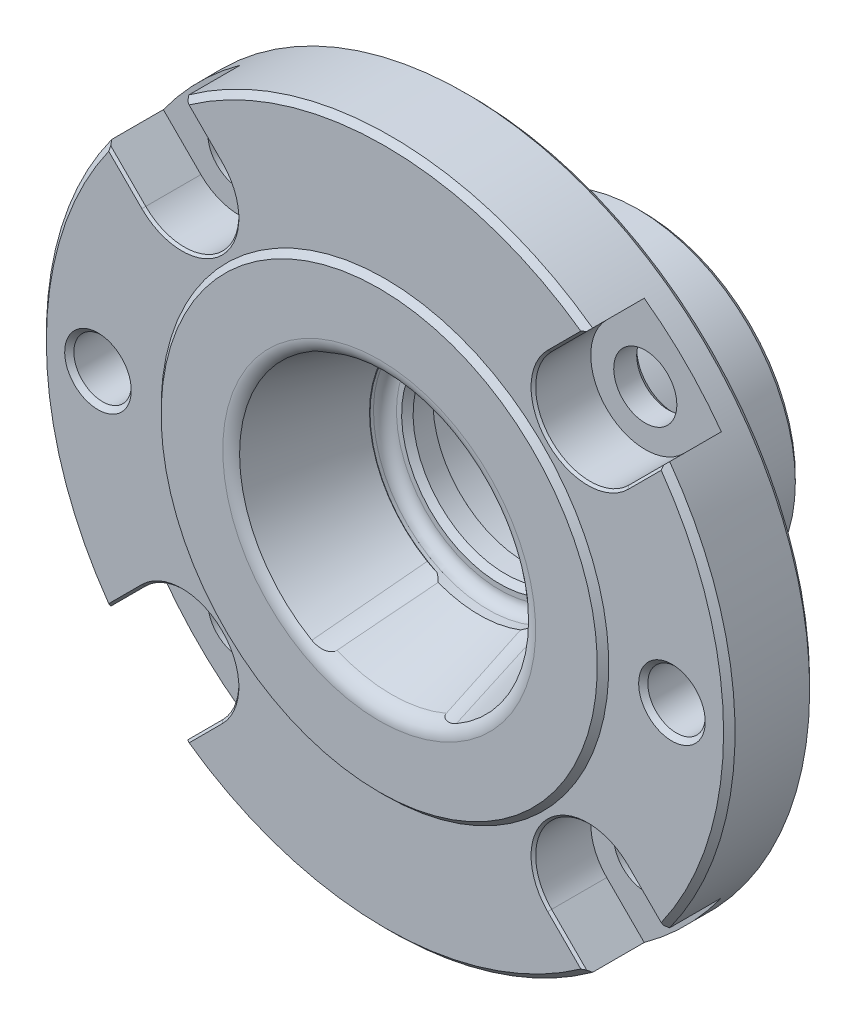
ISO-10303-21;
HEADER;
FILE_DESCRIPTION(('STEP AP214'),'2;1');
FILE_NAME('part.step','',(''),(''),'','','');
FILE_SCHEMA(('AUTOMOTIVE_DESIGN { 1 0 10303 214 1 1 1 1 }'));
ENDSEC;
DATA;
#1=APPLICATION_CONTEXT('core data for automotive mechanical design processes');
#2=APPLICATION_PROTOCOL_DEFINITION('international standard','automotive_design',2000,#1);
#3=PRODUCT_CONTEXT('',#1,'mechanical');
#4=PRODUCT('Part','Part','',(#3));
#5=PRODUCT_RELATED_PRODUCT_CATEGORY('part','',(#4));
#6=PRODUCT_DEFINITION_FORMATION('','',#4);
#7=PRODUCT_DEFINITION_CONTEXT('part definition',#1,'design');
#8=PRODUCT_DEFINITION('design','',#6,#7);
#9=PRODUCT_DEFINITION_SHAPE('','',#8);
#10=(LENGTH_UNIT() NAMED_UNIT(*) SI_UNIT(.MILLI.,.METRE.));
#11=(NAMED_UNIT(*) PLANE_ANGLE_UNIT() SI_UNIT($,.RADIAN.));
#12=(NAMED_UNIT(*) SI_UNIT($,.STERADIAN.) SOLID_ANGLE_UNIT());
#13=UNCERTAINTY_MEASURE_WITH_UNIT(LENGTH_MEASURE(1.E-05),#10,'distance_accuracy_value','');
#14=(GEOMETRIC_REPRESENTATION_CONTEXT(3) GLOBAL_UNCERTAINTY_ASSIGNED_CONTEXT((#13)) GLOBAL_UNIT_ASSIGNED_CONTEXT((#10,
#11,#12)) REPRESENTATION_CONTEXT('',''));
#15=CARTESIAN_POINT('',(0.,0.,0.));
#16=DIRECTION('',(0.,0.,1.));
#17=DIRECTION('',(1.,0.,0.));
#18=AXIS2_PLACEMENT_3D('',#15,#16,#17);
#19=CARTESIAN_POINT('',(0.,0.,-0.71853610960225));
#20=DIRECTION('',(0.,0.,1.));
#21=DIRECTION('',(0.,1.,0.));
#22=AXIS2_PLACEMENT_3D('',#19,#20,#21);
#23=CONICAL_SURFACE('',#22,10.,0.279252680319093);
#24=CARTESIAN_POINT('',(4.75814923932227,11.2213834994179,6.9136560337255));
#25=CARTESIAN_POINT('',(4.66189312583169,11.0640386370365,6.27743086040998));
#26=CARTESIAN_POINT('',(4.56535198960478,10.9067306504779,5.64123954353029));
#27=CARTESIAN_POINT('',(4.37155525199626,10.5922015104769,4.36894557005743));
#28=CARTESIAN_POINT('',(4.27429965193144,10.4349803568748,3.73284291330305));
#29=CARTESIAN_POINT('',(4.07892915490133,10.1206372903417,2.46074448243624));
#30=CARTESIAN_POINT('',(3.9808142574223,9.96351537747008,1.82474870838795));
#31=CARTESIAN_POINT('',(3.78350534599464,9.64938699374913,0.552894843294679));
#32=CARTESIAN_POINT('',(3.68431133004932,9.49238052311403,-0.082963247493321));
#33=CARTESIAN_POINT('',(3.58446799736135,9.33544011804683,-0.71873610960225));
#34=B_SPLINE_CURVE_WITH_KNOTS('',3,(#24,#25,#26,#27,#28,#29,#30,#31,#32,#33),.UNSPECIFIED.,.F.,
.F.,(4,2,2,2,4),(0.,1.98727113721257,3.97453861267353,5.96180727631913,7.9490796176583),.UNSPECIFIED.);
#35=CARTESIAN_POINT('',(4.75811898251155,11.2213340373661,6.91345603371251));
#36=VERTEX_POINT('',#35);
#37=CARTESIAN_POINT('',(3.58449940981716,9.33548948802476,-0.71853610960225));
#38=VERTEX_POINT('',#37);
#39=EDGE_CURVE('E282',#36,#38,#34,.T.);
#40=ORIENTED_EDGE('',*,*,#39,.F.);
#41=CARTESIAN_POINT('',(0.,0.,6.9134560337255));
#42=DIRECTION('',(0.,0.,-1.));
#43=DIRECTION('',(0.,-1.,0.));
#44=AXIS2_PLACEMENT_3D('',#41,#42,#43);
#45=CIRCLE('',#44,12.1884385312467);
#46=CARTESIAN_POINT('',(-4.75811898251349,11.2213340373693,6.91345603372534));
#47=VERTEX_POINT('',#46);
#48=EDGE_CURVE('E461',#36,#47,#45,.F.);
#49=ORIENTED_EDGE('',*,*,#48,.T.);
#50=CARTESIAN_POINT('',(-3.58446799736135,9.33544011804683,-0.71873610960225));
#51=CARTESIAN_POINT('',(-3.68431133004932,9.49238052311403,-0.0829632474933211));
#52=CARTESIAN_POINT('',(-3.78350534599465,9.64938699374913,0.552894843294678));
#53=CARTESIAN_POINT('',(-3.9808142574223,9.96351537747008,1.82474870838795));
#54=CARTESIAN_POINT('',(-4.07892915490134,10.1206372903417,2.46074448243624));
#55=CARTESIAN_POINT('',(-4.27429965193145,10.4349803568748,3.73284291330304));
#56=CARTESIAN_POINT('',(-4.37155525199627,10.5922015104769,4.36894557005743));
#57=CARTESIAN_POINT('',(-4.56535198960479,10.9067306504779,5.64123954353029));
#58=CARTESIAN_POINT('',(-4.66189312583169,11.0640386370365,6.27743086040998));
#59=CARTESIAN_POINT('',(-4.75814923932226,11.2213834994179,6.9136560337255));
#60=B_SPLINE_CURVE_WITH_KNOTS('',3,(#50,#51,#52,#53,#54,#55,#56,#57,#58,#59),.UNSPECIFIED.,.F.,
.F.,(4,2,2,2,4),(0.,1.98727234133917,3.97454100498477,5.96180848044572,7.9490796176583),.UNSPECIFIED.);
#61=CARTESIAN_POINT('',(-3.58449940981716,9.33548948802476,-0.71853610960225));
#62=VERTEX_POINT('',#61);
#63=EDGE_CURVE('E381',#62,#47,#60,.T.);
#64=ORIENTED_EDGE('',*,*,#63,.F.);
#65=CARTESIAN_POINT('',(0.,0.,-0.71853610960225));
#66=DIRECTION('',(0.,0.,1.));
#67=DIRECTION('',(0.,1.,0.));
#68=AXIS2_PLACEMENT_3D('',#65,#66,#67);
#69=CIRCLE('',#68,10.);
#70=EDGE_CURVE('E432',#38,#62,#69,.T.);
#71=ORIENTED_EDGE('',*,*,#70,.F.);
#72=EDGE_LOOP('',(#40,#49,#64,#71));
#73=FACE_BOUND('',#72,.T.);
#74=ADVANCED_FACE('F14',(#73),#23,.F.);
#75=CARTESIAN_POINT('',(-12.5,0.,8.));
#76=DIRECTION('',(0.,0.,1.));
#77=DIRECTION('',(0.,1.,0.));
#78=AXIS2_PLACEMENT_3D('',#75,#76,#77);
#79=PLANE('',#78);
#80=CARTESIAN_POINT('',(0.,0.,8.));
#81=DIRECTION('',(0.,0.,1.));
#82=DIRECTION('',(0.,1.,0.));
#83=AXIS2_PLACEMENT_3D('',#80,#81,#82);
#84=CIRCLE('',#83,13.6303310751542);
#85=CARTESIAN_POINT('',(0.,13.6303310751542,8.));
#86=VERTEX_POINT('',#85);
#87=EDGE_CURVE('E465',#86,#86,#84,.F.);
#88=ORIENTED_EDGE('',*,*,#87,.T.);
#89=EDGE_LOOP('',(#88));
#90=FACE_BOUND('',#89,.T.);
#91=CARTESIAN_POINT('',(0.,0.,8.));
#92=DIRECTION('',(0.,0.,-1.));
#93=DIRECTION('',(0.,-1.,0.));
#94=AXIS2_PLACEMENT_3D('',#91,#92,#93);
#95=CIRCLE('',#94,19.);
#96=CARTESIAN_POINT('',(0.,-19.,8.));
#97=VERTEX_POINT('',#96);
#98=EDGE_CURVE('E688',#97,#97,#95,.T.);
#99=ORIENTED_EDGE('',*,*,#98,.F.);
#100=EDGE_LOOP('',(#99));
#101=FACE_BOUND('',#100,.T.);
#102=ADVANCED_FACE('F600',(#90,#101),#79,.T.);
#103=CARTESIAN_POINT('',(0.,0.,8.));
#104=DIRECTION('',(0.,0.,1.));
#105=DIRECTION('',(0.,1.,0.));
#106=AXIS2_PLACEMENT_3D('',#103,#104,#105);
#107=CYLINDRICAL_SURFACE('',#106,30.);
#108=CARTESIAN_POINT('',(0.,0.,0.5));
#109=DIRECTION('',(0.,0.,-1.));
#110=DIRECTION('',(0.,-1.,0.));
#111=AXIS2_PLACEMENT_3D('',#108,#109,#110);
#112=CIRCLE('',#111,30.);
#113=CARTESIAN_POINT('',(0.,-30.,0.5));
#114=VERTEX_POINT('',#113);
#115=EDGE_CURVE('E455',#114,#114,#112,.F.);
#116=ORIENTED_EDGE('',*,*,#115,.T.);
#117=EDGE_LOOP('',(#116));
#118=FACE_BOUND('',#117,.T.);
#119=DIRECTION('',(0.,0.,1.));
#120=VECTOR('',#119,1.);
#121=CARTESIAN_POINT('',(17.5868568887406,-24.3043713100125,8.));
#122=LINE('',#121,#120);
#123=CARTESIAN_POINT('',(17.5868568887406,-24.3043713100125,7.));
#124=VERTEX_POINT('',#123);
#125=CARTESIAN_POINT('',(17.5868568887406,-24.3043713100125,2.5));
#126=VERTEX_POINT('',#125);
#127=EDGE_CURVE('E748',#124,#126,#122,.F.);
#128=ORIENTED_EDGE('',*,*,#127,.F.);
#129=CARTESIAN_POINT('',(0.,0.,7.));
#130=DIRECTION('',(0.,0.,1.));
#131=DIRECTION('',(0.,1.,0.));
#132=AXIS2_PLACEMENT_3D('',#129,#130,#131);
#133=CIRCLE('',#132,30.);
#134=CARTESIAN_POINT('',(-17.5868568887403,-24.3043713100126,7.));
#135=VERTEX_POINT('',#134);
#136=EDGE_CURVE('E495',#124,#135,#133,.F.);
#137=ORIENTED_EDGE('',*,*,#136,.T.);
#138=DIRECTION('',(0.,0.,1.));
#139=VECTOR('',#138,1.);
#140=CARTESIAN_POINT('',(-17.5868568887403,-24.3043713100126,8.));
#141=LINE('',#140,#139);
#142=CARTESIAN_POINT('',(-17.5868568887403,-24.3043713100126,2.5));
#143=VERTEX_POINT('',#142);
#144=EDGE_CURVE('E799',#143,#135,#141,.T.);
#145=ORIENTED_EDGE('',*,*,#144,.F.);
#146=CARTESIAN_POINT('',(0.,0.,2.5));
#147=DIRECTION('',(0.,0.,-1.));
#148=DIRECTION('',(0.,-1.,0.));
#149=AXIS2_PLACEMENT_3D('',#146,#147,#148);
#150=CIRCLE('',#149,30.);
#151=CARTESIAN_POINT('',(-24.3043713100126,-17.5868568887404,2.5));
#152=VERTEX_POINT('',#151);
#153=EDGE_CURVE('E804',#152,#143,#150,.F.);
#154=ORIENTED_EDGE('',*,*,#153,.F.);
#155=DIRECTION('',(0.,0.,1.));
#156=VECTOR('',#155,1.);
#157=CARTESIAN_POINT('',(-24.3043713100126,-17.5868568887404,8.));
#158=LINE('',#157,#156);
#159=CARTESIAN_POINT('',(-24.3043713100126,-17.5868568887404,7.));
#160=VERTEX_POINT('',#159);
#161=EDGE_CURVE('E802',#160,#152,#158,.F.);
#162=ORIENTED_EDGE('',*,*,#161,.F.);
#163=CARTESIAN_POINT('',(0.,0.,7.));
#164=DIRECTION('',(0.,0.,1.));
#165=DIRECTION('',(0.,1.,0.));
#166=AXIS2_PLACEMENT_3D('',#163,#164,#165);
#167=CIRCLE('',#166,30.);
#168=CARTESIAN_POINT('',(-24.3043713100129,17.5868568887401,7.));
#169=VERTEX_POINT('',#168);
#170=EDGE_CURVE('E492',#160,#169,#167,.F.);
#171=ORIENTED_EDGE('',*,*,#170,.T.);
#172=DIRECTION('',(0.,0.,1.));
#173=VECTOR('',#172,1.);
#174=CARTESIAN_POINT('',(-24.3043713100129,17.5868568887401,8.));
#175=LINE('',#174,#173);
#176=CARTESIAN_POINT('',(-24.3043713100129,17.5868568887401,2.5));
#177=VERTEX_POINT('',#176);
#178=EDGE_CURVE('E709',#177,#169,#175,.T.);
#179=ORIENTED_EDGE('',*,*,#178,.F.);
#180=CARTESIAN_POINT('',(0.,0.,2.5));
#181=DIRECTION('',(0.,0.,-1.));
#182=DIRECTION('',(0.,-1.,0.));
#183=AXIS2_PLACEMENT_3D('',#180,#181,#182);
#184=CIRCLE('',#183,30.);
#185=CARTESIAN_POINT('',(-17.5868568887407,24.3043713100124,2.5));
#186=VERTEX_POINT('',#185);
#187=EDGE_CURVE('E714',#186,#177,#184,.F.);
#188=ORIENTED_EDGE('',*,*,#187,.F.);
#189=DIRECTION('',(0.,0.,1.));
#190=VECTOR('',#189,1.);
#191=CARTESIAN_POINT('',(-17.5868568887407,24.3043713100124,8.));
#192=LINE('',#191,#190);
#193=CARTESIAN_POINT('',(-17.5868568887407,24.3043713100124,7.));
#194=VERTEX_POINT('',#193);
#195=EDGE_CURVE('E712',#194,#186,#192,.F.);
#196=ORIENTED_EDGE('',*,*,#195,.F.);
#197=CARTESIAN_POINT('',(0.,0.,7.));
#198=DIRECTION('',(0.,0.,1.));
#199=DIRECTION('',(0.,1.,0.));
#200=AXIS2_PLACEMENT_3D('',#197,#198,#199);
#201=CIRCLE('',#200,30.);
#202=CARTESIAN_POINT('',(17.5868568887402,24.3043713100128,7.));
#203=VERTEX_POINT('',#202);
#204=EDGE_CURVE('E489',#194,#203,#201,.F.);
#205=ORIENTED_EDGE('',*,*,#204,.T.);
#206=DIRECTION('',(0.,0.,1.));
#207=VECTOR('',#206,1.);
#208=CARTESIAN_POINT('',(17.5868568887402,24.3043713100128,8.));
#209=LINE('',#208,#207);
#210=CARTESIAN_POINT('',(17.5868568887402,24.3043713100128,2.5));
#211=VERTEX_POINT('',#210);
#212=EDGE_CURVE('E727',#211,#203,#209,.T.);
#213=ORIENTED_EDGE('',*,*,#212,.F.);
#214=CARTESIAN_POINT('',(0.,0.,2.5));
#215=DIRECTION('',(0.,0.,-1.));
#216=DIRECTION('',(0.,-1.,0.));
#217=AXIS2_PLACEMENT_3D('',#214,#215,#216);
#218=CIRCLE('',#217,30.);
#219=CARTESIAN_POINT('',(24.3043713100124,17.5868568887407,2.5));
#220=VERTEX_POINT('',#219);
#221=EDGE_CURVE('E732',#220,#211,#218,.F.);
#222=ORIENTED_EDGE('',*,*,#221,.F.);
#223=DIRECTION('',(0.,0.,1.));
#224=VECTOR('',#223,1.);
#225=CARTESIAN_POINT('',(24.3043713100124,17.5868568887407,8.));
#226=LINE('',#225,#224);
#227=CARTESIAN_POINT('',(24.3043713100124,17.5868568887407,7.));
#228=VERTEX_POINT('',#227);
#229=EDGE_CURVE('E730',#228,#220,#226,.F.);
#230=ORIENTED_EDGE('',*,*,#229,.F.);
#231=CARTESIAN_POINT('',(0.,0.,7.));
#232=DIRECTION('',(0.,0.,1.));
#233=DIRECTION('',(0.,1.,0.));
#234=AXIS2_PLACEMENT_3D('',#231,#232,#233);
#235=CIRCLE('',#234,30.);
#236=CARTESIAN_POINT('',(24.3043713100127,-17.5868568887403,7.));
#237=VERTEX_POINT('',#236);
#238=EDGE_CURVE('E486',#228,#237,#235,.F.);
#239=ORIENTED_EDGE('',*,*,#238,.T.);
#240=DIRECTION('',(0.,0.,1.));
#241=VECTOR('',#240,1.);
#242=CARTESIAN_POINT('',(24.3043713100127,-17.5868568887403,8.));
#243=LINE('',#242,#241);
#244=CARTESIAN_POINT('',(24.3043713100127,-17.5868568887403,2.5));
#245=VERTEX_POINT('',#244);
#246=EDGE_CURVE('E745',#245,#237,#243,.T.);
#247=ORIENTED_EDGE('',*,*,#246,.F.);
#248=CARTESIAN_POINT('',(0.,0.,2.5));
#249=DIRECTION('',(0.,0.,-1.));
#250=DIRECTION('',(0.,-1.,0.));
#251=AXIS2_PLACEMENT_3D('',#248,#249,#250);
#252=CIRCLE('',#251,30.);
#253=EDGE_CURVE('E750',#126,#245,#252,.F.);
#254=ORIENTED_EDGE('',*,*,#253,.F.);
#255=EDGE_LOOP('',(#128,#137,#145,#154,#162,#171,#179,#188,#196,#205,#213,#222,#230,#239,#247,#254));
#256=FACE_BOUND('',#255,.T.);
#257=ADVANCED_FACE('F606',(#118,#256),#107,.T.);
#258=CARTESIAN_POINT('',(-17.6776695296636,-17.6776695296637,8.));
#259=DIRECTION('',(0.,0.,1.));
#260=DIRECTION('',(0.,1.,0.));
#261=AXIS2_PLACEMENT_3D('',#258,#259,#260);
#262=CYLINDRICAL_SURFACE('',#261,4.75);
#263=DIRECTION('',(0.,0.,1.));
#264=VECTOR('',#263,1.);
#265=CARTESIAN_POINT('',(-14.3189123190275,-21.0364267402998,-21.8007934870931));
#266=LINE('',#265,#264);
#267=CARTESIAN_POINT('',(-14.3189123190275,-21.0364267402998,2.5));
#268=VERTEX_POINT('',#267);
#269=CARTESIAN_POINT('',(-14.3189123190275,-21.0364267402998,7.3));
#270=VERTEX_POINT('',#269);
#271=EDGE_CURVE('E793',#268,#270,#266,.T.);
#272=ORIENTED_EDGE('',*,*,#271,.T.);
#273=CARTESIAN_POINT('',(-17.6776695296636,-17.6776695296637,7.3));
#274=DIRECTION('',(0.,0.,1.));
#275=DIRECTION('',(0.,1.,0.));
#276=AXIS2_PLACEMENT_3D('',#273,#274,#275);
#277=CIRCLE('',#276,4.75);
#278=CARTESIAN_POINT('',(-21.0364267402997,-14.3189123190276,7.3));
#279=VERTEX_POINT('',#278);
#280=EDGE_CURVE('E1055',#270,#279,#277,.T.);
#281=ORIENTED_EDGE('',*,*,#280,.T.);
#282=DIRECTION('',(0.,0.,1.));
#283=VECTOR('',#282,1.);
#284=CARTESIAN_POINT('',(-21.0364267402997,-14.3189123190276,-21.8007934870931));
#285=LINE('',#284,#283);
#286=CARTESIAN_POINT('',(-21.0364267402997,-14.3189123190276,2.5));
#287=VERTEX_POINT('',#286);
#288=EDGE_CURVE('E796',#287,#279,#285,.T.);
#289=ORIENTED_EDGE('',*,*,#288,.F.);
#290=CARTESIAN_POINT('',(-17.6776695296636,-17.6776695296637,2.5));
#291=DIRECTION('',(0.,0.,1.));
#292=DIRECTION('',(0.,1.,0.));
#293=AXIS2_PLACEMENT_3D('',#290,#291,#292);
#294=CIRCLE('',#293,4.75);
#295=EDGE_CURVE('E806',#268,#287,#294,.T.);
#296=ORIENTED_EDGE('',*,*,#295,.F.);
#297=EDGE_LOOP('',(#272,#281,#289,#296));
#298=FACE_BOUND('',#297,.T.);
#299=ADVANCED_FACE('F526',(#298),#262,.F.);
#300=CARTESIAN_POINT('',(-21.0364267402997,-14.3189123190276,-21.8007934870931));
#301=DIRECTION('',(-0.707106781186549,0.707106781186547,0.));
#302=DIRECTION('',(0.707106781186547,0.707106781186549,0.));
#303=AXIS2_PLACEMENT_3D('',#300,#301,#302);
#304=PLANE('',#303);
#305=ORIENTED_EDGE('',*,*,#288,.T.);
#306=DIRECTION('',(-0.707106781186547,-0.707106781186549,0.));
#307=VECTOR('',#306,1.);
#308=CARTESIAN_POINT('',(-23.9462230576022,-17.2287086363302,7.3));
#309=LINE('',#308,#307);
#310=CARTESIAN_POINT('',(-24.0895012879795,-17.3719868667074,7.29999999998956));
#311=VERTEX_POINT('',#310);
#312=EDGE_CURVE('E572',#279,#311,#309,.T.);
#313=ORIENTED_EDGE('',*,*,#312,.T.);
#314=CARTESIAN_POINT('',(-23.9462230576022,-17.2287086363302,7.5));
#315=CARTESIAN_POINT('',(-24.0059209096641,-17.288406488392,7.41667594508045));
#316=CARTESIAN_POINT('',(-24.0656155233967,-17.3481011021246,7.33334725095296));
#317=CARTESIAN_POINT('',(-24.1849982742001,-17.467483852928,7.16668058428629));
#318=CARTESIAN_POINT('',(-24.244686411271,-17.5271719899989,7.08334261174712));
#319=CARTESIAN_POINT('',(-24.3043713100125,-17.5868568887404,7.));
#320=B_SPLINE_CURVE_WITH_KNOTS('',3,(#314,#315,#316,#317,#318,#319),.UNSPECIFIED.,.F.,.F.,(4,2,
4),(0.,0.355858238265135,0.711716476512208),.UNSPECIFIED.);
#321=EDGE_CURVE('E530',#311,#160,#320,.T.);
#322=ORIENTED_EDGE('',*,*,#321,.T.);
#323=ORIENTED_EDGE('',*,*,#161,.T.);
#324=DIRECTION('',(-0.707106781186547,-0.707106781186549,0.));
#325=VECTOR('',#324,1.);
#326=CARTESIAN_POINT('',(-21.0364267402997,-14.3189123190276,2.5));
#327=LINE('',#326,#325);
#328=EDGE_CURVE('E788',#287,#152,#327,.T.);
#329=ORIENTED_EDGE('',*,*,#328,.F.);
#330=EDGE_LOOP('',(#305,#313,#322,#323,#329));
#331=FACE_BOUND('',#330,.T.);
#332=ADVANCED_FACE('F519',(#331),#304,.F.);
#333=CARTESIAN_POINT('',(-14.3189123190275,-21.0364267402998,-21.8007934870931));
#334=DIRECTION('',(0.707106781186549,-0.707106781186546,0.));
#335=DIRECTION('',(-0.707106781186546,-0.707106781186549,0.));
#336=AXIS2_PLACEMENT_3D('',#333,#334,#335);
#337=PLANE('',#336);
#338=CARTESIAN_POINT('',(-17.5868568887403,-24.3043713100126,7.));
#339=CARTESIAN_POINT('',(-17.5271719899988,-24.2446864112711,7.08334261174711));
#340=CARTESIAN_POINT('',(-17.4674838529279,-24.1849982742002,7.16668058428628));
#341=CARTESIAN_POINT('',(-17.3481011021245,-24.0656155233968,7.33334725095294));
#342=CARTESIAN_POINT('',(-17.2884064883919,-24.0059209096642,7.41667594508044));
#343=CARTESIAN_POINT('',(-17.2287086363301,-23.9462230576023,7.5));
#344=B_SPLINE_CURVE_WITH_KNOTS('',3,(#338,#339,#340,#341,#342,#343),.UNSPECIFIED.,.F.,.F.,(4,2,
4),(0.,0.355858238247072,0.711716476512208),.UNSPECIFIED.);
#345=CARTESIAN_POINT('',(-17.3719868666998,-24.0895012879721,7.3));
#346=VERTEX_POINT('',#345);
#347=EDGE_CURVE('E498',#135,#346,#344,.T.);
#348=ORIENTED_EDGE('',*,*,#347,.T.);
#349=DIRECTION('',(0.707106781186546,0.707106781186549,0.));
#350=VECTOR('',#349,1.);
#351=CARTESIAN_POINT('',(-14.3189123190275,-21.0364267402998,7.3));
#352=LINE('',#351,#350);
#353=EDGE_CURVE('E922',#346,#270,#352,.T.);
#354=ORIENTED_EDGE('',*,*,#353,.T.);
#355=ORIENTED_EDGE('',*,*,#271,.F.);
#356=DIRECTION('',(0.707106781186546,0.707106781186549,0.));
#357=VECTOR('',#356,1.);
#358=CARTESIAN_POINT('',(-14.3189123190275,-21.0364267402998,2.5));
#359=LINE('',#358,#357);
#360=EDGE_CURVE('E791',#143,#268,#359,.T.);
#361=ORIENTED_EDGE('',*,*,#360,.F.);
#362=ORIENTED_EDGE('',*,*,#144,.T.);
#363=EDGE_LOOP('',(#348,#354,#355,#361,#362));
#364=FACE_BOUND('',#363,.T.);
#365=ADVANCED_FACE('F513',(#364),#337,.F.);
#366=CARTESIAN_POINT('',(17.6776695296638,-17.6776695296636,8.));
#367=DIRECTION('',(0.,0.,1.));
#368=DIRECTION('',(0.,1.,0.));
#369=AXIS2_PLACEMENT_3D('',#366,#367,#368);
#370=CYLINDRICAL_SURFACE('',#369,4.75);
#371=DIRECTION('',(0.,0.,1.));
#372=VECTOR('',#371,1.);
#373=CARTESIAN_POINT('',(21.0364267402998,-14.3189123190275,-21.8007934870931));
#374=LINE('',#373,#372);
#375=CARTESIAN_POINT('',(21.0364267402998,-14.3189123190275,2.5));
#376=VERTEX_POINT('',#375);
#377=CARTESIAN_POINT('',(21.0364267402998,-14.3189123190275,7.3));
#378=VERTEX_POINT('',#377);
#379=EDGE_CURVE('E739',#376,#378,#374,.T.);
#380=ORIENTED_EDGE('',*,*,#379,.T.);
#381=CARTESIAN_POINT('',(17.6776695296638,-17.6776695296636,7.3));
#382=DIRECTION('',(0.,0.,1.));
#383=DIRECTION('',(0.,1.,0.));
#384=AXIS2_PLACEMENT_3D('',#381,#382,#383);
#385=CIRCLE('',#384,4.75);
#386=CARTESIAN_POINT('',(14.3189123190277,-21.0364267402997,7.3));
#387=VERTEX_POINT('',#386);
#388=EDGE_CURVE('E933',#378,#387,#385,.T.);
#389=ORIENTED_EDGE('',*,*,#388,.T.);
#390=DIRECTION('',(0.,0.,1.));
#391=VECTOR('',#390,1.);
#392=CARTESIAN_POINT('',(14.3189123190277,-21.0364267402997,-21.8007934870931));
#393=LINE('',#392,#391);
#394=CARTESIAN_POINT('',(14.3189123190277,-21.0364267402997,2.5));
#395=VERTEX_POINT('',#394);
#396=EDGE_CURVE('E742',#395,#387,#393,.T.);
#397=ORIENTED_EDGE('',*,*,#396,.F.);
#398=CARTESIAN_POINT('',(17.6776695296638,-17.6776695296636,2.5));
#399=DIRECTION('',(0.,0.,1.));
#400=DIRECTION('',(0.,1.,0.));
#401=AXIS2_PLACEMENT_3D('',#398,#399,#400);
#402=CIRCLE('',#401,4.75);
#403=EDGE_CURVE('E776',#376,#395,#402,.T.);
#404=ORIENTED_EDGE('',*,*,#403,.F.);
#405=EDGE_LOOP('',(#380,#389,#397,#404));
#406=FACE_BOUND('',#405,.T.);
#407=ADVANCED_FACE('F518',(#406),#370,.F.);
#408=CARTESIAN_POINT('',(17.6776695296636,17.6776695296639,8.));
#409=DIRECTION('',(0.,0.,1.));
#410=DIRECTION('',(0.,1.,0.));
#411=AXIS2_PLACEMENT_3D('',#408,#409,#410);
#412=CYLINDRICAL_SURFACE('',#411,4.75);
#413=DIRECTION('',(0.,0.,1.));
#414=VECTOR('',#413,1.);
#415=CARTESIAN_POINT('',(14.3189123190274,21.0364267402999,-21.8007934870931));
#416=LINE('',#415,#414);
#417=CARTESIAN_POINT('',(14.3189123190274,21.0364267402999,2.5));
#418=VERTEX_POINT('',#417);
#419=CARTESIAN_POINT('',(14.3189123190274,21.0364267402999,7.3));
#420=VERTEX_POINT('',#419);
#421=EDGE_CURVE('E721',#418,#420,#416,.T.);
#422=ORIENTED_EDGE('',*,*,#421,.T.);
#423=CARTESIAN_POINT('',(17.6776695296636,17.6776695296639,7.3));
#424=DIRECTION('',(0.,0.,1.));
#425=DIRECTION('',(0.,1.,0.));
#426=AXIS2_PLACEMENT_3D('',#423,#424,#425);
#427=CIRCLE('',#426,4.75);
#428=CARTESIAN_POINT('',(21.0364267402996,14.3189123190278,7.3));
#429=VERTEX_POINT('',#428);
#430=EDGE_CURVE('E983',#420,#429,#427,.T.);
#431=ORIENTED_EDGE('',*,*,#430,.T.);
#432=DIRECTION('',(0.,0.,1.));
#433=VECTOR('',#432,1.);
#434=CARTESIAN_POINT('',(21.0364267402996,14.3189123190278,-21.8007934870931));
#435=LINE('',#434,#433);
#436=CARTESIAN_POINT('',(21.0364267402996,14.3189123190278,2.5));
#437=VERTEX_POINT('',#436);
#438=EDGE_CURVE('E724',#437,#429,#435,.T.);
#439=ORIENTED_EDGE('',*,*,#438,.F.);
#440=CARTESIAN_POINT('',(17.6776695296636,17.6776695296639,2.5));
#441=DIRECTION('',(0.,0.,1.));
#442=DIRECTION('',(0.,1.,0.));
#443=AXIS2_PLACEMENT_3D('',#440,#441,#442);
#444=CIRCLE('',#443,4.75);
#445=EDGE_CURVE('E764',#418,#437,#444,.T.);
#446=ORIENTED_EDGE('',*,*,#445,.F.);
#447=EDGE_LOOP('',(#422,#431,#439,#446));
#448=FACE_BOUND('',#447,.T.);
#449=ADVANCED_FACE('F1107',(#448),#412,.F.);
#450=CARTESIAN_POINT('',(-17.6776695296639,17.6776695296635,8.));
#451=DIRECTION('',(0.,0.,1.));
#452=DIRECTION('',(0.,1.,0.));
#453=AXIS2_PLACEMENT_3D('',#450,#451,#452);
#454=CYLINDRICAL_SURFACE('',#453,4.75);
#455=DIRECTION('',(0.,0.,1.));
#456=VECTOR('',#455,1.);
#457=CARTESIAN_POINT('',(-21.0364267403,14.3189123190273,-21.8007934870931));
#458=LINE('',#457,#456);
#459=CARTESIAN_POINT('',(-21.0364267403,14.3189123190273,2.5));
#460=VERTEX_POINT('',#459);
#461=CARTESIAN_POINT('',(-21.0364267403,14.3189123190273,7.3));
#462=VERTEX_POINT('',#461);
#463=EDGE_CURVE('E705',#460,#462,#458,.T.);
#464=ORIENTED_EDGE('',*,*,#463,.T.);
#465=CARTESIAN_POINT('',(-17.6776695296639,17.6776695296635,7.3));
#466=DIRECTION('',(0.,0.,1.));
#467=DIRECTION('',(0.,1.,0.));
#468=AXIS2_PLACEMENT_3D('',#465,#466,#467);
#469=CIRCLE('',#468,4.75);
#470=CARTESIAN_POINT('',(-14.3189123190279,21.0364267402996,7.3));
#471=VERTEX_POINT('',#470);
#472=EDGE_CURVE('E32',#462,#471,#469,.T.);
#473=ORIENTED_EDGE('',*,*,#472,.T.);
#474=DIRECTION('',(0.,0.,1.));
#475=VECTOR('',#474,1.);
#476=CARTESIAN_POINT('',(-14.3189123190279,21.0364267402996,-21.8007934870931));
#477=LINE('',#476,#475);
#478=CARTESIAN_POINT('',(-14.3189123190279,21.0364267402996,2.5));
#479=VERTEX_POINT('',#478);
#480=EDGE_CURVE('E707',#479,#471,#477,.T.);
#481=ORIENTED_EDGE('',*,*,#480,.F.);
#482=CARTESIAN_POINT('',(-17.6776695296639,17.6776695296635,2.5));
#483=DIRECTION('',(0.,0.,1.));
#484=DIRECTION('',(0.,1.,0.));
#485=AXIS2_PLACEMENT_3D('',#482,#483,#484);
#486=CIRCLE('',#485,4.75);
#487=EDGE_CURVE('E752',#460,#479,#486,.T.);
#488=ORIENTED_EDGE('',*,*,#487,.F.);
#489=EDGE_LOOP('',(#464,#473,#481,#488));
#490=FACE_BOUND('',#489,.T.);
#491=ADVANCED_FACE('F1102',(#490),#454,.F.);
#492=CARTESIAN_POINT('',(14.3189123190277,-21.0364267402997,-21.8007934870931));
#493=DIRECTION('',(-0.707106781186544,-0.707106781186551,0.));
#494=DIRECTION('',(-0.707106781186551,0.707106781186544,0.));
#495=AXIS2_PLACEMENT_3D('',#492,#493,#494);
#496=PLANE('',#495);
#497=ORIENTED_EDGE('',*,*,#396,.T.);
#498=DIRECTION('',(0.707106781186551,-0.707106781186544,0.));
#499=VECTOR('',#498,1.);
#500=CARTESIAN_POINT('',(17.2287086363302,-23.9462230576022,7.3));
#501=LINE('',#500,#499);
#502=CARTESIAN_POINT('',(17.3719868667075,-24.0895012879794,7.2999999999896));
#503=VERTEX_POINT('',#502);
#504=EDGE_CURVE('E931',#387,#503,#501,.T.);
#505=ORIENTED_EDGE('',*,*,#504,.T.);
#506=CARTESIAN_POINT('',(17.2287086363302,-23.9462230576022,7.5));
#507=CARTESIAN_POINT('',(17.2884064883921,-24.0059209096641,7.41667594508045));
#508=CARTESIAN_POINT('',(17.3481011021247,-24.0656155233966,7.33334725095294));
#509=CARTESIAN_POINT('',(17.4674838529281,-24.1849982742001,7.16668058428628));
#510=CARTESIAN_POINT('',(17.527171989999,-24.2446864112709,7.08334261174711));
#511=CARTESIAN_POINT('',(17.5868568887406,-24.3043713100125,7.));
#512=B_SPLINE_CURVE_WITH_KNOTS('',3,(#506,#507,#508,#509,#510,#511),.UNSPECIFIED.,.F.,.F.,(4,2,
4),(0.,0.355858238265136,0.71171647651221),.UNSPECIFIED.);
#513=EDGE_CURVE('E916',#503,#124,#512,.T.);
#514=ORIENTED_EDGE('',*,*,#513,.T.);
#515=ORIENTED_EDGE('',*,*,#127,.T.);
#516=DIRECTION('',(0.707106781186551,-0.707106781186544,0.));
#517=VECTOR('',#516,1.);
#518=CARTESIAN_POINT('',(14.3189123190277,-21.0364267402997,2.5));
#519=LINE('',#518,#517);
#520=EDGE_CURVE('E734',#395,#126,#519,.T.);
#521=ORIENTED_EDGE('',*,*,#520,.F.);
#522=EDGE_LOOP('',(#497,#505,#514,#515,#521));
#523=FACE_BOUND('',#522,.T.);
#524=ADVANCED_FACE('F1096',(#523),#496,.F.);
#525=CARTESIAN_POINT('',(21.0364267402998,-14.3189123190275,-21.8007934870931));
#526=DIRECTION('',(0.707106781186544,0.707106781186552,0.));
#527=DIRECTION('',(0.707106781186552,-0.707106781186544,0.));
#528=AXIS2_PLACEMENT_3D('',#525,#526,#527);
#529=PLANE('',#528);
#530=CARTESIAN_POINT('',(24.3043713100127,-17.5868568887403,7.));
#531=CARTESIAN_POINT('',(24.2446864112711,-17.5271719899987,7.08334261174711));
#532=CARTESIAN_POINT('',(24.1849982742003,-17.4674838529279,7.16668058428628));
#533=CARTESIAN_POINT('',(24.0656155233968,-17.3481011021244,7.33334725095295));
#534=CARTESIAN_POINT('',(24.0059209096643,-17.2884064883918,7.41667594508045));
#535=CARTESIAN_POINT('',(23.9462230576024,-17.2287086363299,7.5));
#536=B_SPLINE_CURVE_WITH_KNOTS('',3,(#530,#531,#532,#533,#534,#535),.UNSPECIFIED.,.F.,.F.,(4,2,
4),(0.,0.355858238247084,0.711716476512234),.UNSPECIFIED.);
#537=CARTESIAN_POINT('',(24.0895012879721,-17.3719868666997,7.3));
#538=VERTEX_POINT('',#537);
#539=EDGE_CURVE('E1160',#237,#538,#536,.T.);
#540=ORIENTED_EDGE('',*,*,#539,.T.);
#541=DIRECTION('',(-0.707106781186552,0.707106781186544,0.));
#542=VECTOR('',#541,1.);
#543=CARTESIAN_POINT('',(21.0364267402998,-14.3189123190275,7.3));
#544=LINE('',#543,#542);
#545=EDGE_CURVE('E1025',#538,#378,#544,.T.);
#546=ORIENTED_EDGE('',*,*,#545,.T.);
#547=ORIENTED_EDGE('',*,*,#379,.F.);
#548=DIRECTION('',(-0.707106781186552,0.707106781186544,0.));
#549=VECTOR('',#548,1.);
#550=CARTESIAN_POINT('',(21.0364267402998,-14.3189123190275,2.5));
#551=LINE('',#550,#549);
#552=EDGE_CURVE('E737',#245,#376,#551,.T.);
#553=ORIENTED_EDGE('',*,*,#552,.F.);
#554=ORIENTED_EDGE('',*,*,#246,.T.);
#555=EDGE_LOOP('',(#540,#546,#547,#553,#554));
#556=FACE_BOUND('',#555,.T.);
#557=ADVANCED_FACE('F1101',(#556),#529,.F.);
#558=CARTESIAN_POINT('',(21.0364267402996,14.3189123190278,-21.8007934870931));
#559=DIRECTION('',(0.707106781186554,-0.707106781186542,0.));
#560=DIRECTION('',(-0.707106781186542,-0.707106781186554,0.));
#561=AXIS2_PLACEMENT_3D('',#558,#559,#560);
#562=PLANE('',#561);
#563=ORIENTED_EDGE('',*,*,#438,.T.);
#564=DIRECTION('',(0.707106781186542,0.707106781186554,0.));
#565=VECTOR('',#564,1.);
#566=CARTESIAN_POINT('',(23.9462230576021,17.2287086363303,7.3));
#567=LINE('',#566,#565);
#568=CARTESIAN_POINT('',(24.0895012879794,17.3719868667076,7.29999999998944));
#569=VERTEX_POINT('',#568);
#570=EDGE_CURVE('E1161',#429,#569,#567,.T.);
#571=ORIENTED_EDGE('',*,*,#570,.T.);
#572=CARTESIAN_POINT('',(23.9462230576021,17.2287086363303,7.5));
#573=CARTESIAN_POINT('',(24.005920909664,17.2884064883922,7.41667594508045));
#574=CARTESIAN_POINT('',(24.0656155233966,17.3481011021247,7.33334725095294));
#575=CARTESIAN_POINT('',(24.1849982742,17.4674838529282,7.16668058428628));
#576=CARTESIAN_POINT('',(24.2446864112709,17.5271719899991,7.08334261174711));
#577=CARTESIAN_POINT('',(24.3043713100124,17.5868568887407,7.));
#578=B_SPLINE_CURVE_WITH_KNOTS('',3,(#572,#573,#574,#575,#576,#577),.UNSPECIFIED.,.F.,.F.,(4,2,
4),(0.,0.35585823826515,0.711716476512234),.UNSPECIFIED.);
#579=EDGE_CURVE('E1197',#569,#228,#578,.T.);
#580=ORIENTED_EDGE('',*,*,#579,.T.);
#581=ORIENTED_EDGE('',*,*,#229,.T.);
#582=DIRECTION('',(0.707106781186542,0.707106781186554,0.));
#583=VECTOR('',#582,1.);
#584=CARTESIAN_POINT('',(21.0364267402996,14.3189123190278,2.5));
#585=LINE('',#584,#583);
#586=EDGE_CURVE('E716',#437,#220,#585,.T.);
#587=ORIENTED_EDGE('',*,*,#586,.F.);
#588=EDGE_LOOP('',(#563,#571,#580,#581,#587));
#589=FACE_BOUND('',#588,.T.);
#590=ADVANCED_FACE('F1215',(#589),#562,.F.);
#591=CARTESIAN_POINT('',(14.3189123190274,21.0364267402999,-21.8007934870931));
#592=DIRECTION('',(-0.707106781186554,0.707106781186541,0.));
#593=DIRECTION('',(0.707106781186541,0.707106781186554,0.));
#594=AXIS2_PLACEMENT_3D('',#591,#592,#593);
#595=PLANE('',#594);
#596=CARTESIAN_POINT('',(17.5868568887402,24.3043713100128,7.));
#597=CARTESIAN_POINT('',(17.5271719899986,24.2446864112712,7.08334261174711));
#598=CARTESIAN_POINT('',(17.4674838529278,24.1849982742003,7.16668058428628));
#599=CARTESIAN_POINT('',(17.3481011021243,24.0656155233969,7.33334725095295));
#600=CARTESIAN_POINT('',(17.2884064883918,24.0059209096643,7.41667594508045));
#601=CARTESIAN_POINT('',(17.2287086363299,23.9462230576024,7.5));
#602=B_SPLINE_CURVE_WITH_KNOTS('',3,(#596,#597,#598,#599,#600,#601),.UNSPECIFIED.,.F.,.F.,(4,2,
4),(0.,0.355858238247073,0.71171647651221),.UNSPECIFIED.);
#603=CARTESIAN_POINT('',(17.3719868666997,24.0895012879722,7.3));
#604=VERTEX_POINT('',#603);
#605=EDGE_CURVE('E537',#203,#604,#602,.T.);
#606=ORIENTED_EDGE('',*,*,#605,.T.);
#607=DIRECTION('',(-0.707106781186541,-0.707106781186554,0.));
#608=VECTOR('',#607,1.);
#609=CARTESIAN_POINT('',(14.3189123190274,21.0364267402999,7.3));
#610=LINE('',#609,#608);
#611=EDGE_CURVE('E1177',#604,#420,#610,.T.);
#612=ORIENTED_EDGE('',*,*,#611,.T.);
#613=ORIENTED_EDGE('',*,*,#421,.F.);
#614=DIRECTION('',(-0.707106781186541,-0.707106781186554,0.));
#615=VECTOR('',#614,1.);
#616=CARTESIAN_POINT('',(14.3189123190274,21.0364267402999,2.5));
#617=LINE('',#616,#615);
#618=EDGE_CURVE('E719',#211,#418,#617,.T.);
#619=ORIENTED_EDGE('',*,*,#618,.F.);
#620=ORIENTED_EDGE('',*,*,#212,.T.);
#621=EDGE_LOOP('',(#606,#612,#613,#619,#620));
#622=FACE_BOUND('',#621,.T.);
#623=ADVANCED_FACE('F1181',(#622),#595,.F.);
#624=CARTESIAN_POINT('',(-14.3189123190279,21.0364267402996,-21.8007934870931));
#625=DIRECTION('',(0.707106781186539,0.707106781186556,0.));
#626=DIRECTION('',(0.707106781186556,-0.707106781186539,0.));
#627=AXIS2_PLACEMENT_3D('',#624,#625,#626);
#628=PLANE('',#627);
#629=ORIENTED_EDGE('',*,*,#480,.T.);
#630=DIRECTION('',(-0.707106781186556,0.707106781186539,0.));
#631=VECTOR('',#630,1.);
#632=CARTESIAN_POINT('',(-17.2287086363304,23.9462230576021,7.3));
#633=LINE('',#632,#631);
#634=CARTESIAN_POINT('',(-17.3719868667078,24.0895012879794,7.29999999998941));
#635=VERTEX_POINT('',#634);
#636=EDGE_CURVE('E1000',#471,#635,#633,.T.);
#637=ORIENTED_EDGE('',*,*,#636,.T.);
#638=CARTESIAN_POINT('',(-17.2287086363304,23.9462230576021,7.5));
#639=CARTESIAN_POINT('',(-17.2884064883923,24.005920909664,7.41667594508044));
#640=CARTESIAN_POINT('',(-17.3481011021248,24.0656155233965,7.33334725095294));
#641=CARTESIAN_POINT('',(-17.4674838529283,24.1849982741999,7.16668058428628));
#642=CARTESIAN_POINT('',(-17.5271719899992,24.2446864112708,7.08334261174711));
#643=CARTESIAN_POINT('',(-17.5868568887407,24.3043713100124,7.));
#644=B_SPLINE_CURVE_WITH_KNOTS('',3,(#638,#639,#640,#641,#642,#643),.UNSPECIFIED.,.F.,.F.,(4,2,
4),(0.,0.355858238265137,0.711716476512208),.UNSPECIFIED.);
#645=EDGE_CURVE('E1195',#635,#194,#644,.T.);
#646=ORIENTED_EDGE('',*,*,#645,.T.);
#647=ORIENTED_EDGE('',*,*,#195,.T.);
#648=DIRECTION('',(-0.707106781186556,0.707106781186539,0.));
#649=VECTOR('',#648,1.);
#650=CARTESIAN_POINT('',(-14.3189123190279,21.0364267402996,2.5));
#651=LINE('',#650,#649);
#652=EDGE_CURVE('E700',#479,#186,#651,.T.);
#653=ORIENTED_EDGE('',*,*,#652,.F.);
#654=EDGE_LOOP('',(#629,#637,#646,#647,#653));
#655=FACE_BOUND('',#654,.T.);
#656=ADVANCED_FACE('F621',(#655),#628,.F.);
#657=CARTESIAN_POINT('',(-21.0364267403,14.3189123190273,-21.8007934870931));
#658=DIRECTION('',(-0.707106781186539,-0.707106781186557,0.));
#659=DIRECTION('',(-0.707106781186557,0.707106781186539,0.));
#660=AXIS2_PLACEMENT_3D('',#657,#658,#659);
#661=PLANE('',#660);
#662=CARTESIAN_POINT('',(-24.3043713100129,17.5868568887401,7.));
#663=CARTESIAN_POINT('',(-24.2446864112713,17.5271719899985,7.08334261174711));
#664=CARTESIAN_POINT('',(-24.1849982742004,17.4674838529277,7.16668058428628));
#665=CARTESIAN_POINT('',(-24.0656155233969,17.3481011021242,7.33334725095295));
#666=CARTESIAN_POINT('',(-24.0059209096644,17.2884064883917,7.41667594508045));
#667=CARTESIAN_POINT('',(-23.9462230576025,17.2287086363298,7.5));
#668=B_SPLINE_CURVE_WITH_KNOTS('',3,(#662,#663,#664,#665,#666,#667),.UNSPECIFIED.,.F.,.F.,(4,2,
4),(0.,0.355858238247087,0.711716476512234),.UNSPECIFIED.);
#669=CARTESIAN_POINT('',(-24.0895012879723,17.3719868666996,7.3));
#670=VERTEX_POINT('',#669);
#671=EDGE_CURVE('E538',#169,#670,#668,.T.);
#672=ORIENTED_EDGE('',*,*,#671,.T.);
#673=DIRECTION('',(0.707106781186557,-0.707106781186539,0.));
#674=VECTOR('',#673,1.);
#675=CARTESIAN_POINT('',(-21.0364267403,14.3189123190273,7.3));
#676=LINE('',#675,#674);
#677=EDGE_CURVE('E40',#670,#462,#676,.T.);
#678=ORIENTED_EDGE('',*,*,#677,.T.);
#679=ORIENTED_EDGE('',*,*,#463,.F.);
#680=DIRECTION('',(0.707106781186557,-0.707106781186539,0.));
#681=VECTOR('',#680,1.);
#682=CARTESIAN_POINT('',(-21.0364267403,14.3189123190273,2.5));
#683=LINE('',#682,#681);
#684=EDGE_CURVE('E703',#177,#460,#683,.T.);
#685=ORIENTED_EDGE('',*,*,#684,.F.);
#686=ORIENTED_EDGE('',*,*,#178,.T.);
#687=EDGE_LOOP('',(#672,#678,#679,#685,#686));
#688=FACE_BOUND('',#687,.T.);
#689=ADVANCED_FACE('F613',(#688),#661,.F.);
#690=CARTESIAN_POINT('',(3.58446799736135,-9.33544011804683,-0.71873610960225));
#691=CARTESIAN_POINT('',(3.68431133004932,-9.49238052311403,-0.0829632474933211));
#692=CARTESIAN_POINT('',(3.78350534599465,-9.64938699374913,0.552894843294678));
#693=CARTESIAN_POINT('',(3.9808142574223,-9.96351537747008,1.82474870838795));
#694=CARTESIAN_POINT('',(4.07892915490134,-10.1206372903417,2.46074448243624));
#695=CARTESIAN_POINT('',(4.27429965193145,-10.4349803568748,3.73284291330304));
#696=CARTESIAN_POINT('',(4.37155525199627,-10.5922015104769,4.36894557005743));
#697=CARTESIAN_POINT('',(4.56535198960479,-10.9067306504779,5.64123954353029));
#698=CARTESIAN_POINT('',(4.66189312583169,-11.0640386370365,6.27743086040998));
#699=CARTESIAN_POINT('',(4.75814923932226,-11.2213834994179,6.9136560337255));
#700=B_SPLINE_CURVE_WITH_KNOTS('',3,(#690,#691,#692,#693,#694,#695,#696,#697,#698,#699),
.UNSPECIFIED.,.F.,.F.,(4,2,2,2,4),(0.,1.98727234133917,3.97454100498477,5.96180848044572,
7.9490796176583),.UNSPECIFIED.);
#701=CARTESIAN_POINT('',(3.58449940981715,-9.33548948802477,-0.71853610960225));
#702=VERTEX_POINT('',#701);
#703=CARTESIAN_POINT('',(4.75811898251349,-11.2213340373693,6.91345603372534));
#704=VERTEX_POINT('',#703);
#705=EDGE_CURVE('E320',#702,#704,#700,.T.);
#706=ORIENTED_EDGE('',*,*,#705,.F.);
#707=CARTESIAN_POINT('',(-3.58449940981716,-9.33548948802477,-0.71853610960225));
#708=VERTEX_POINT('',#707);
#709=EDGE_CURVE('E427',#708,#702,#69,.T.);
#710=ORIENTED_EDGE('',*,*,#709,.F.);
#711=CARTESIAN_POINT('',(-4.75814923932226,-11.2213834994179,6.9136560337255));
#712=CARTESIAN_POINT('',(-4.66189312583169,-11.0640386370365,6.27743086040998));
#713=CARTESIAN_POINT('',(-4.56535198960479,-10.9067306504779,5.64123954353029));
#714=CARTESIAN_POINT('',(-4.37155525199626,-10.5922015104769,4.36894557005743));
#715=CARTESIAN_POINT('',(-4.27429965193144,-10.4349803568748,3.73284291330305));
#716=CARTESIAN_POINT('',(-4.07892915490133,-10.1206372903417,2.46074448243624));
#717=CARTESIAN_POINT('',(-3.9808142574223,-9.96351537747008,1.82474870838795));
#718=CARTESIAN_POINT('',(-3.78350534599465,-9.64938699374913,0.552894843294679));
#719=CARTESIAN_POINT('',(-3.68431133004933,-9.49238052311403,-0.0829632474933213));
#720=CARTESIAN_POINT('',(-3.58446799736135,-9.33544011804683,-0.71873610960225));
#721=B_SPLINE_CURVE_WITH_KNOTS('',3,(#711,#712,#713,#714,#715,#716,#717,#718,#719,#720),
.UNSPECIFIED.,.F.,.F.,(4,2,2,2,4),(0.,1.98727113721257,3.97453861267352,5.96180727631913,
7.9490796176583),.UNSPECIFIED.);
#722=CARTESIAN_POINT('',(-4.75811898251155,-11.2213340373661,6.91345603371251));
#723=VERTEX_POINT('',#722);
#724=EDGE_CURVE('E1897',#723,#708,#721,.T.);
#725=ORIENTED_EDGE('',*,*,#724,.F.);
#726=EDGE_CURVE('E462',#723,#704,#45,.F.);
#727=ORIENTED_EDGE('',*,*,#726,.T.);
#728=EDGE_LOOP('',(#706,#710,#725,#727));
#729=FACE_BOUND('',#728,.T.);
#730=ADVANCED_FACE('F602',(#729),#23,.F.);
#731=CARTESIAN_POINT('',(-14.,0.,0.));
#732=DIRECTION('',(0.,0.,-1.));
#733=DIRECTION('',(0.,-1.,0.));
#734=AXIS2_PLACEMENT_3D('',#731,#732,#733);
#735=PLANE('',#734);
#736=CARTESIAN_POINT('',(25.,1.71104619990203E-13,0.));
#737=DIRECTION('',(0.,0.,1.));
#738=DIRECTION('',(0.,1.,0.));
#739=AXIS2_PLACEMENT_3D('',#736,#737,#738);
#740=CIRCLE('',#739,2.9);
#741=CARTESIAN_POINT('',(25.,2.90000000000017,0.));
#742=VERTEX_POINT('',#741);
#743=EDGE_CURVE('E685',#742,#742,#740,.T.);
#744=ORIENTED_EDGE('',*,*,#743,.T.);
#745=EDGE_LOOP('',(#744));
#746=FACE_BOUND('',#745,.T.);
#747=CARTESIAN_POINT('',(-25.,0.,0.));
#748=DIRECTION('',(0.,0.,1.));
#749=DIRECTION('',(0.,1.,0.));
#750=AXIS2_PLACEMENT_3D('',#747,#748,#749);
#751=CIRCLE('',#750,2.9);
#752=CARTESIAN_POINT('',(-25.,2.9,0.));
#753=VERTEX_POINT('',#752);
#754=EDGE_CURVE('E684',#753,#753,#751,.T.);
#755=ORIENTED_EDGE('',*,*,#754,.T.);
#756=EDGE_LOOP('',(#755));
#757=FACE_BOUND('',#756,.T.);
#758=CARTESIAN_POINT('',(-17.6776695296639,17.6776695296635,0.));
#759=DIRECTION('',(0.,0.,1.));
#760=DIRECTION('',(0.,1.,0.));
#761=AXIS2_PLACEMENT_3D('',#758,#759,#760);
#762=CIRCLE('',#761,3.25);
#763=CARTESIAN_POINT('',(-17.6776695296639,20.9276695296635,0.));
#764=VERTEX_POINT('',#763);
#765=EDGE_CURVE('E761',#764,#764,#762,.T.);
#766=ORIENTED_EDGE('',*,*,#765,.T.);
#767=EDGE_LOOP('',(#766));
#768=FACE_BOUND('',#767,.T.);
#769=CARTESIAN_POINT('',(17.6776695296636,17.6776695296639,0.));
#770=DIRECTION('',(0.,0.,1.));
#771=DIRECTION('',(0.,1.,0.));
#772=AXIS2_PLACEMENT_3D('',#769,#770,#771);
#773=CIRCLE('',#772,3.25);
#774=CARTESIAN_POINT('',(17.6776695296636,20.9276695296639,0.));
#775=VERTEX_POINT('',#774);
#776=EDGE_CURVE('E773',#775,#775,#773,.T.);
#777=ORIENTED_EDGE('',*,*,#776,.T.);
#778=EDGE_LOOP('',(#777));
#779=FACE_BOUND('',#778,.T.);
#780=CARTESIAN_POINT('',(17.6776695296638,-17.6776695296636,0.));
#781=DIRECTION('',(0.,0.,1.));
#782=DIRECTION('',(0.,1.,0.));
#783=AXIS2_PLACEMENT_3D('',#780,#781,#782);
#784=CIRCLE('',#783,3.25);
#785=CARTESIAN_POINT('',(17.6776695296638,-14.4276695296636,0.));
#786=VERTEX_POINT('',#785);
#787=EDGE_CURVE('E785',#786,#786,#784,.T.);
#788=ORIENTED_EDGE('',*,*,#787,.T.);
#789=EDGE_LOOP('',(#788));
#790=FACE_BOUND('',#789,.T.);
#791=CARTESIAN_POINT('',(-17.6776695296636,-17.6776695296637,0.));
#792=DIRECTION('',(0.,0.,1.));
#793=DIRECTION('',(0.,1.,0.));
#794=AXIS2_PLACEMENT_3D('',#791,#792,#793);
#795=CIRCLE('',#794,3.25);
#796=CARTESIAN_POINT('',(-17.6776695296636,-14.4276695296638,0.));
#797=VERTEX_POINT('',#796);
#798=EDGE_CURVE('E815',#797,#797,#795,.T.);
#799=ORIENTED_EDGE('',*,*,#798,.T.);
#800=EDGE_LOOP('',(#799));
#801=FACE_BOUND('',#800,.T.);
#802=CARTESIAN_POINT('',(0.,0.,0.));
#803=DIRECTION('',(0.,0.,1.));
#804=DIRECTION('',(0.,1.,0.));
#805=AXIS2_PLACEMENT_3D('',#802,#803,#804);
#806=CIRCLE('',#805,15.);
#807=CARTESIAN_POINT('',(0.,15.,0.));
#808=VERTEX_POINT('',#807);
#809=EDGE_CURVE('E827',#808,#808,#806,.T.);
#810=ORIENTED_EDGE('',*,*,#809,.T.);
#811=EDGE_LOOP('',(#810));
#812=FACE_BOUND('',#811,.T.);
#813=CARTESIAN_POINT('',(0.,0.,0.));
#814=DIRECTION('',(0.,0.,-1.));
#815=DIRECTION('',(0.,-1.,0.));
#816=AXIS2_PLACEMENT_3D('',#813,#814,#815);
#817=CIRCLE('',#816,29.5);
#818=CARTESIAN_POINT('',(0.,-29.5,0.));
#819=VERTEX_POINT('',#818);
#820=EDGE_CURVE('E458',#819,#819,#817,.T.);
#821=ORIENTED_EDGE('',*,*,#820,.T.);
#822=EDGE_LOOP('',(#821));
#823=FACE_BOUND('',#822,.T.);
#824=ADVANCED_FACE('F612',(#746,#757,#768,#779,#790,#801,#812,#823),#735,.T.);
#825=CARTESIAN_POINT('',(0.,0.,8.));
#826=DIRECTION('',(0.,0.,1.));
#827=DIRECTION('',(0.,1.,0.));
#828=AXIS2_PLACEMENT_3D('',#825,#826,#827);
#829=CYLINDRICAL_SURFACE('',#828,14.);
#830=CARTESIAN_POINT('',(0.,0.,-2.));
#831=DIRECTION('',(0.,0.,1.));
#832=DIRECTION('',(0.,1.,0.));
#833=AXIS2_PLACEMENT_3D('',#830,#831,#832);
#834=CIRCLE('',#833,14.);
#835=CARTESIAN_POINT('',(0.,14.,-2.));
#836=VERTEX_POINT('',#835);
#837=EDGE_CURVE('E818',#836,#836,#834,.T.);
#838=ORIENTED_EDGE('',*,*,#837,.F.);
#839=EDGE_LOOP('',(#838));
#840=FACE_BOUND('',#839,.T.);
#841=CARTESIAN_POINT('',(0.,0.,-9.75));
#842=DIRECTION('',(0.,0.,1.));
#843=DIRECTION('',(0.,1.,0.));
#844=AXIS2_PLACEMENT_3D('',#841,#842,#843);
#845=CIRCLE('',#844,14.);
#846=CARTESIAN_POINT('',(0.,14.,-9.75));
#847=VERTEX_POINT('',#846);
#848=EDGE_CURVE('E437',#847,#847,#845,.T.);
#849=ORIENTED_EDGE('',*,*,#848,.T.);
#850=EDGE_LOOP('',(#849));
#851=FACE_BOUND('',#850,.T.);
#852=ADVANCED_FACE('F618',(#840,#851),#829,.T.);
#853=CARTESIAN_POINT('',(-11.,0.,-15.));
#854=DIRECTION('',(0.,0.,-1.));
#855=DIRECTION('',(0.,-1.,0.));
#856=AXIS2_PLACEMENT_3D('',#853,#854,#855);
#857=PLANE('',#856);
#858=CARTESIAN_POINT('',(0.,0.,-15.));
#859=DIRECTION('',(0.,0.,-1.));
#860=DIRECTION('',(0.,-1.,0.));
#861=AXIS2_PLACEMENT_3D('',#858,#859,#860);
#862=CIRCLE('',#861,11.5);
#863=CARTESIAN_POINT('',(0.,-11.5,-15.));
#864=VERTEX_POINT('',#863);
#865=EDGE_CURVE('E480',#864,#864,#862,.F.);
#866=ORIENTED_EDGE('',*,*,#865,.T.);
#867=EDGE_LOOP('',(#866));
#868=FACE_BOUND('',#867,.T.);
#869=CARTESIAN_POINT('',(0.,0.,-15.));
#870=DIRECTION('',(0.,0.,-1.));
#871=DIRECTION('',(0.,-1.,0.));
#872=AXIS2_PLACEMENT_3D('',#869,#870,#871);
#873=CIRCLE('',#872,13.25);
#874=CARTESIAN_POINT('',(0.,-13.25,-15.));
#875=VERTEX_POINT('',#874);
#876=EDGE_CURVE('E471',#875,#875,#873,.T.);
#877=ORIENTED_EDGE('',*,*,#876,.T.);
#878=EDGE_LOOP('',(#877));
#879=FACE_BOUND('',#878,.T.);
#880=ADVANCED_FACE('F887',(#868,#879),#857,.T.);
#881=CARTESIAN_POINT('',(0.,0.,8.));
#882=DIRECTION('',(0.,0.,1.));
#883=DIRECTION('',(0.,1.,0.));
#884=AXIS2_PLACEMENT_3D('',#881,#882,#883);
#885=CYLINDRICAL_SURFACE('',#884,11.);
#886=CARTESIAN_POINT('',(0.,0.,-14.5));
#887=DIRECTION('',(0.,0.,-1.));
#888=DIRECTION('',(0.,-1.,0.));
#889=AXIS2_PLACEMENT_3D('',#886,#887,#888);
#890=CIRCLE('',#889,11.);
#891=CARTESIAN_POINT('',(0.,-11.,-14.5));
#892=VERTEX_POINT('',#891);
#893=EDGE_CURVE('E483',#892,#892,#890,.T.);
#894=ORIENTED_EDGE('',*,*,#893,.T.);
#895=EDGE_LOOP('',(#894));
#896=FACE_BOUND('',#895,.T.);
#897=CARTESIAN_POINT('',(0.,0.,-6.80062261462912));
#898=DIRECTION('',(0.,0.,1.));
#899=DIRECTION('',(0.,1.,0.));
#900=AXIS2_PLACEMENT_3D('',#897,#898,#899);
#901=CIRCLE('',#900,11.);
#902=CARTESIAN_POINT('',(0.,11.,-6.80062261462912));
#903=VERTEX_POINT('',#902);
#904=EDGE_CURVE('E435',#903,#903,#901,.T.);
#905=ORIENTED_EDGE('',*,*,#904,.T.);
#906=EDGE_LOOP('',(#905));
#907=FACE_BOUND('',#906,.T.);
#908=ADVANCED_FACE('F882',(#896,#907),#885,.F.);
#909=CARTESIAN_POINT('',(0.,0.,-6.80062261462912));
#910=DIRECTION('',(0.,0.,-1.));
#911=DIRECTION('',(0.,-1.,0.));
#912=AXIS2_PLACEMENT_3D('',#909,#910,#911);
#913=CONICAL_SURFACE('',#912,11.,0.959931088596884);
#914=CARTESIAN_POINT('',(0.,0.,-4.7350103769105));
#915=DIRECTION('',(0.,0.,1.));
#916=DIRECTION('',(0.,1.,0.));
#917=AXIS2_PLACEMENT_3D('',#914,#915,#916);
#918=CIRCLE('',#917,8.05);
#919=CARTESIAN_POINT('',(0.,8.05,-4.7350103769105));
#920=VERTEX_POINT('',#919);
#921=EDGE_CURVE('E431',#920,#920,#918,.T.);
#922=ORIENTED_EDGE('',*,*,#921,.T.);
#923=EDGE_LOOP('',(#922));
#924=FACE_BOUND('',#923,.T.);
#925=ORIENTED_EDGE('',*,*,#904,.F.);
#926=EDGE_LOOP('',(#925));
#927=FACE_BOUND('',#926,.T.);
#928=ADVANCED_FACE('F872',(#924,#927),#913,.F.);
#929=CARTESIAN_POINT('',(0.,0.,8.));
#930=DIRECTION('',(0.,0.,1.));
#931=DIRECTION('',(0.,1.,0.));
#932=AXIS2_PLACEMENT_3D('',#929,#930,#931);
#933=CYLINDRICAL_SURFACE('',#932,8.05);
#934=CARTESIAN_POINT('',(0.,0.,-3.));
#935=DIRECTION('',(0.,0.,1.));
#936=DIRECTION('',(0.,1.,0.));
#937=AXIS2_PLACEMENT_3D('',#934,#935,#936);
#938=CIRCLE('',#937,8.05);
#939=CARTESIAN_POINT('',(0.,8.05,-3.));
#940=VERTEX_POINT('',#939);
#941=EDGE_CURVE('E449',#940,#940,#938,.T.);
#942=ORIENTED_EDGE('',*,*,#941,.T.);
#943=EDGE_LOOP('',(#942));
#944=FACE_BOUND('',#943,.T.);
#945=ORIENTED_EDGE('',*,*,#921,.F.);
#946=EDGE_LOOP('',(#945));
#947=FACE_BOUND('',#946,.T.);
#948=ADVANCED_FACE('F867',(#944,#947),#933,.F.);
#949=CARTESIAN_POINT('',(-10.,0.,-2.5));
#950=DIRECTION('',(0.,0.,1.));
#951=DIRECTION('',(0.,1.,0.));
#952=AXIS2_PLACEMENT_3D('',#949,#950,#951);
#953=PLANE('',#952);
#954=CARTESIAN_POINT('',(0.,0.,-2.5));
#955=DIRECTION('',(0.,0.,1.));
#956=DIRECTION('',(0.,1.,0.));
#957=AXIS2_PLACEMENT_3D('',#954,#955,#956);
#958=CIRCLE('',#957,8.55);
#959=CARTESIAN_POINT('',(0.,8.55,-2.5));
#960=VERTEX_POINT('',#959);
#961=EDGE_CURVE('E452',#960,#960,#958,.F.);
#962=ORIENTED_EDGE('',*,*,#961,.T.);
#963=EDGE_LOOP('',(#962));
#964=FACE_BOUND('',#963,.T.);
#965=CARTESIAN_POINT('',(0.,0.,-2.5));
#966=DIRECTION('',(0.,0.,1.));
#967=DIRECTION('',(0.,1.,0.));
#968=AXIS2_PLACEMENT_3D('',#965,#966,#967);
#969=CIRCLE('',#968,9.);
#970=CARTESIAN_POINT('',(0.,9.,-2.5));
#971=VERTEX_POINT('',#970);
#972=EDGE_CURVE('E443',#971,#971,#969,.T.);
#973=ORIENTED_EDGE('',*,*,#972,.T.);
#974=EDGE_LOOP('',(#973));
#975=FACE_BOUND('',#974,.T.);
#976=ADVANCED_FACE('F354',(#964,#975),#953,.T.);
#977=CARTESIAN_POINT('',(0.,0.,8.));
#978=DIRECTION('',(0.,0.,1.));
#979=DIRECTION('',(0.,1.,0.));
#980=AXIS2_PLACEMENT_3D('',#977,#978,#979);
#981=CYLINDRICAL_SURFACE('',#980,10.);
#982=CARTESIAN_POINT('',(0.,0.,1.66746650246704));
#983=DIRECTION('',(-0.1378186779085,-0.238708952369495,-0.961261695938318));
#984=DIRECTION('',(-0.480630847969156,-0.832477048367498,0.275637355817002));
#985=AXIS2_PLACEMENT_3D('',#982,#983,#984);
#986=ELLIPSE('',#985,10.402994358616,10.);
#987=CARTESIAN_POINT('',(4.15532874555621,9.0957816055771,-1.18703859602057));
#988=VERTEX_POINT('',#987);
#989=CARTESIAN_POINT('',(5.,8.66025403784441,-1.19998735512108));
#990=VERTEX_POINT('',#989);
#991=EDGE_CURVE('E286',#988,#990,#986,.T.);
#992=ORIENTED_EDGE('',*,*,#991,.F.);
#993=CARTESIAN_POINT('',(3.5844994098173,9.33548948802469,-0.71853610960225));
#994=CARTESIAN_POINT('',(3.62793801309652,9.31880858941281,-0.763964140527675));
#995=CARTESIAN_POINT('',(3.67243390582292,9.30137774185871,-0.808142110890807));
#996=CARTESIAN_POINT('',(3.76334582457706,9.2649676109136,-0.89331863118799));
#997=CARTESIAN_POINT('',(3.80975194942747,9.24599591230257,-0.934331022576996));
#998=CARTESIAN_POINT('',(3.90470521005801,9.20629800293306,-1.01293812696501));
#999=CARTESIAN_POINT('',(3.95325285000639,9.18557137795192,-1.05053202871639));
#1000=CARTESIAN_POINT('',(4.05263667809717,9.1421598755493,-1.12188071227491));
#1001=CARTESIAN_POINT('',(4.10348250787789,9.11946629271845,-1.1556167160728));
#1002=CARTESIAN_POINT('',(4.1553287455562,9.09578160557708,-1.18703859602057));
#1003=B_SPLINE_CURVE_WITH_KNOTS('',3,(#993,#994,#995,#996,#997,#998,#999,#1000,#1001,#1002),
.UNSPECIFIED.,.F.,.F.,(4,2,2,2,4),(0.,0.195101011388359,0.389293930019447,0.583532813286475,
0.778680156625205),.UNSPECIFIED.);
#1004=EDGE_CURVE('E276',#38,#988,#1003,.T.);
#1005=ORIENTED_EDGE('',*,*,#1004,.F.);
#1006=ORIENTED_EDGE('',*,*,#70,.T.);
#1007=CARTESIAN_POINT('',(-4.1553287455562,9.09578160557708,-1.18703859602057));
#1008=CARTESIAN_POINT('',(-4.10348250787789,9.11946629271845,-1.1556167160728));
#1009=CARTESIAN_POINT('',(-4.05263667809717,9.1421598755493,-1.1218807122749));
#1010=CARTESIAN_POINT('',(-3.95325285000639,9.18557137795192,-1.05053202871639));
#1011=CARTESIAN_POINT('',(-3.90470521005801,9.20629800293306,-1.01293812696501));
#1012=CARTESIAN_POINT('',(-3.80975194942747,9.24599591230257,-0.934331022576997));
#1013=CARTESIAN_POINT('',(-3.76334582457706,9.2649676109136,-0.893318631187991));
#1014=CARTESIAN_POINT('',(-3.67243390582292,9.30137774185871,-0.808142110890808));
#1015=CARTESIAN_POINT('',(-3.62793801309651,9.31880858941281,-0.763964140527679));
#1016=CARTESIAN_POINT('',(-3.58449940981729,9.33548948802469,-0.71853610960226));
#1017=B_SPLINE_CURVE_WITH_KNOTS('',3,(#1007,#1008,#1009,#1010,#1011,#1012,#1013,#1014,#1015,
#1016),.UNSPECIFIED.,.F.,.F.,(4,2,2,2,4),(0.,0.195147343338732,0.389386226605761,
0.58357914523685,0.778680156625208),.UNSPECIFIED.);
#1018=CARTESIAN_POINT('',(-4.15532874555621,9.0957816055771,-1.18703859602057));
#1019=VERTEX_POINT('',#1018);
#1020=EDGE_CURVE('E371',#1019,#62,#1017,.T.);
#1021=ORIENTED_EDGE('',*,*,#1020,.F.);
#1022=CARTESIAN_POINT('',(0.,0.,1.66746650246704));
#1023=DIRECTION('',(0.1378186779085,-0.238708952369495,-0.961261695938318));
#1024=DIRECTION('',(0.480630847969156,-0.832477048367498,0.275637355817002));
#1025=AXIS2_PLACEMENT_3D('',#1022,#1023,#1024);
#1026=ELLIPSE('',#1025,10.402994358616,10.);
#1027=CARTESIAN_POINT('',(-5.,8.66025403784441,-1.19998735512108));
#1028=VERTEX_POINT('',#1027);
#1029=EDGE_CURVE('E380',#1028,#1019,#1026,.T.);
#1030=ORIENTED_EDGE('',*,*,#1029,.F.);
#1031=CARTESIAN_POINT('',(0.,0.,-1.19998735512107));
#1032=DIRECTION('',(0.,0.,-1.));
#1033=DIRECTION('',(0.,-1.,0.));
#1034=AXIS2_PLACEMENT_3D('',#1031,#1032,#1033);
#1035=CIRCLE('',#1034,10.);
#1036=CARTESIAN_POINT('',(-5.,-8.66025403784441,-1.19998735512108));
#1037=VERTEX_POINT('',#1036);
#1038=EDGE_CURVE('E630',#1028,#1037,#1035,.F.);
#1039=ORIENTED_EDGE('',*,*,#1038,.T.);
#1040=CARTESIAN_POINT('',(0.,0.,1.66746650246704));
#1041=DIRECTION('',(0.1378186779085,0.238708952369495,-0.961261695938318));
#1042=DIRECTION('',(0.480630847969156,0.832477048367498,0.275637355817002));
#1043=AXIS2_PLACEMENT_3D('',#1040,#1041,#1042);
#1044=ELLIPSE('',#1043,10.402994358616,10.);
#1045=CARTESIAN_POINT('',(-4.15532874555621,-9.0957816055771,-1.18703859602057));
#1046=VERTEX_POINT('',#1045);
#1047=EDGE_CURVE('E1879',#1046,#1037,#1044,.T.);
#1048=ORIENTED_EDGE('',*,*,#1047,.F.);
#1049=CARTESIAN_POINT('',(-3.5844994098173,-9.33548948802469,-0.71853610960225));
#1050=CARTESIAN_POINT('',(-3.62793801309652,-9.31880858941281,-0.763964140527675));
#1051=CARTESIAN_POINT('',(-3.67243390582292,-9.30137774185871,-0.808142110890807));
#1052=CARTESIAN_POINT('',(-3.76334582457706,-9.2649676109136,-0.89331863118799));
#1053=CARTESIAN_POINT('',(-3.80975194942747,-9.24599591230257,-0.934331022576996));
#1054=CARTESIAN_POINT('',(-3.90470521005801,-9.20629800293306,-1.01293812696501));
#1055=CARTESIAN_POINT('',(-3.95325285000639,-9.18557137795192,-1.05053202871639));
#1056=CARTESIAN_POINT('',(-4.05263667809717,-9.1421598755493,-1.12188071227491));
#1057=CARTESIAN_POINT('',(-4.10348250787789,-9.11946629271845,-1.1556167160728));
#1058=CARTESIAN_POINT('',(-4.1553287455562,-9.09578160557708,-1.18703859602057));
#1059=B_SPLINE_CURVE_WITH_KNOTS('',3,(#1049,#1050,#1051,#1052,#1053,#1054,#1055,#1056,#1057,
#1058),.UNSPECIFIED.,.F.,.F.,(4,2,2,2,4),(0.,0.195101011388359,0.389293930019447,
0.583532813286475,0.778680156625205),.UNSPECIFIED.);
#1060=EDGE_CURVE('E361',#708,#1046,#1059,.T.);
#1061=ORIENTED_EDGE('',*,*,#1060,.F.);
#1062=ORIENTED_EDGE('',*,*,#709,.T.);
#1063=CARTESIAN_POINT('',(4.1553287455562,-9.09578160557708,-1.18703859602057));
#1064=CARTESIAN_POINT('',(4.10348250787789,-9.11946629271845,-1.1556167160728));
#1065=CARTESIAN_POINT('',(4.05263667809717,-9.1421598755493,-1.1218807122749));
#1066=CARTESIAN_POINT('',(3.95325285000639,-9.18557137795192,-1.05053202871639));
#1067=CARTESIAN_POINT('',(3.90470521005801,-9.20629800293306,-1.01293812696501));
#1068=CARTESIAN_POINT('',(3.80975194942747,-9.24599591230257,-0.934331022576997));
#1069=CARTESIAN_POINT('',(3.76334582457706,-9.2649676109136,-0.893318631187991));
#1070=CARTESIAN_POINT('',(3.67243390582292,-9.30137774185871,-0.808142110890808));
#1071=CARTESIAN_POINT('',(3.62793801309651,-9.31880858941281,-0.763964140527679));
#1072=CARTESIAN_POINT('',(3.58449940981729,-9.33548948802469,-0.71853610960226));
#1073=B_SPLINE_CURVE_WITH_KNOTS('',3,(#1063,#1064,#1065,#1066,#1067,#1068,#1069,#1070,#1071,
#1072),.UNSPECIFIED.,.F.,.F.,(4,2,2,2,4),(0.,0.195147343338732,0.389386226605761,
0.58357914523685,0.778680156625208),.UNSPECIFIED.);
#1074=CARTESIAN_POINT('',(4.15532874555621,-9.0957816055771,-1.18703859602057));
#1075=VERTEX_POINT('',#1074);
#1076=EDGE_CURVE('E341',#1075,#702,#1073,.T.);
#1077=ORIENTED_EDGE('',*,*,#1076,.F.);
#1078=CARTESIAN_POINT('',(0.,0.,1.66746650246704));
#1079=DIRECTION('',(-0.1378186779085,0.238708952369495,-0.961261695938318));
#1080=DIRECTION('',(-0.480630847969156,0.832477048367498,0.275637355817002));
#1081=AXIS2_PLACEMENT_3D('',#1078,#1079,#1080);
#1082=ELLIPSE('',#1081,10.402994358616,10.);
#1083=CARTESIAN_POINT('',(5.,-8.66025403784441,-1.19998735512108));
#1084=VERTEX_POINT('',#1083);
#1085=EDGE_CURVE('E347',#1084,#1075,#1082,.T.);
#1086=ORIENTED_EDGE('',*,*,#1085,.F.);
#1087=CARTESIAN_POINT('',(0.,0.,-1.19998735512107));
#1088=DIRECTION('',(0.,0.,-1.));
#1089=DIRECTION('',(0.,-1.,0.));
#1090=AXIS2_PLACEMENT_3D('',#1087,#1088,#1089);
#1091=CIRCLE('',#1090,10.);
#1092=EDGE_CURVE('E9',#1084,#990,#1091,.F.);
#1093=ORIENTED_EDGE('',*,*,#1092,.T.);
#1094=EDGE_LOOP('',(#992,#1005,#1006,#1021,#1030,#1039,#1048,#1061,#1062,#1077,#1086,#1093));
#1095=FACE_BOUND('',#1094,.T.);
#1096=CARTESIAN_POINT('',(0.,0.,-1.5));
#1097=DIRECTION('',(0.,0.,1.));
#1098=DIRECTION('',(0.,1.,0.));
#1099=AXIS2_PLACEMENT_3D('',#1096,#1097,#1098);
#1100=CIRCLE('',#1099,10.);
#1101=CARTESIAN_POINT('',(0.,10.,-1.5));
#1102=VERTEX_POINT('',#1101);
#1103=EDGE_CURVE('E446',#1102,#1102,#1100,.F.);
#1104=ORIENTED_EDGE('',*,*,#1103,.T.);
#1105=EDGE_LOOP('',(#1104));
#1106=FACE_BOUND('',#1105,.T.);
#1107=ADVANCED_FACE('F296',(#1095,#1106),#981,.F.);
#1108=CARTESIAN_POINT('',(0.,0.,-1.5));
#1109=DIRECTION('',(0.,0.,1.));
#1110=DIRECTION('',(0.,1.,0.));
#1111=AXIS2_PLACEMENT_3D('',#1108,#1109,#1110);
#1112=TOROIDAL_SURFACE('',#1111,9.,1.);
#1113=ORIENTED_EDGE('',*,*,#1103,.F.);
#1114=EDGE_LOOP('',(#1113));
#1115=FACE_BOUND('',#1114,.T.);
#1116=ORIENTED_EDGE('',*,*,#972,.F.);
#1117=EDGE_LOOP('',(#1116));
#1118=FACE_BOUND('',#1117,.T.);
#1119=ADVANCED_FACE('F353',(#1115,#1118),#1112,.F.);
#1120=CARTESIAN_POINT('',(0.,0.,-3.));
#1121=DIRECTION('',(0.,0.,1.));
#1122=DIRECTION('',(0.,1.,0.));
#1123=AXIS2_PLACEMENT_3D('',#1120,#1121,#1122);
#1124=CONICAL_SURFACE('',#1123,8.05,0.785398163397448);
#1125=ORIENTED_EDGE('',*,*,#961,.F.);
#1126=EDGE_LOOP('',(#1125));
#1127=FACE_BOUND('',#1126,.T.);
#1128=ORIENTED_EDGE('',*,*,#941,.F.);
#1129=EDGE_LOOP('',(#1128));
#1130=FACE_BOUND('',#1129,.T.);
#1131=ADVANCED_FACE('F849',(#1127,#1130),#1124,.F.);
#1132=CARTESIAN_POINT('',(0.,0.,0.5));
#1133=DIRECTION('',(0.,0.,1.));
#1134=DIRECTION('',(0.,1.,0.));
#1135=AXIS2_PLACEMENT_3D('',#1132,#1133,#1134);
#1136=CONICAL_SURFACE('',#1135,30.,0.785398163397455);
#1137=ORIENTED_EDGE('',*,*,#820,.F.);
#1138=EDGE_LOOP('',(#1137));
#1139=FACE_BOUND('',#1138,.T.);
#1140=ORIENTED_EDGE('',*,*,#115,.F.);
#1141=EDGE_LOOP('',(#1140));
#1142=FACE_BOUND('',#1141,.T.);
#1143=ADVANCED_FACE('F845',(#1139,#1142),#1136,.T.);
#1144=CARTESIAN_POINT('',(0.,0.,6.5));
#1145=DIRECTION('',(0.,0.,1.));
#1146=DIRECTION('',(0.,1.,0.));
#1147=AXIS2_PLACEMENT_3D('',#1144,#1145,#1146);
#1148=TOROIDAL_SURFACE('',#1147,13.6303310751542,1.5);
#1149=CARTESIAN_POINT('',(7.33887310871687,9.73126804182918,6.9132560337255));
#1150=CARTESIAN_POINT('',(7.34237345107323,9.73755718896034,6.93821725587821));
#1151=CARTESIAN_POINT('',(7.34417618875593,9.74591977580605,6.96277180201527));
#1152=CARTESIAN_POINT('',(7.34468671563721,9.76592805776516,7.01023438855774));
#1153=CARTESIAN_POINT('',(7.34342884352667,9.77753604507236,7.03315775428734));
#1154=CARTESIAN_POINT('',(7.33819567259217,9.80328210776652,7.07699926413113));
#1155=CARTESIAN_POINT('',(7.33423376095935,9.81740746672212,7.09792671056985));
#1156=CARTESIAN_POINT('',(7.32400996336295,9.84753276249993,7.1378400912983));
#1157=CARTESIAN_POINT('',(7.31774098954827,9.86353837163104,7.15681980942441));
#1158=CARTESIAN_POINT('',(7.2981011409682,9.90870091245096,7.20570865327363));
#1159=CARTESIAN_POINT('',(7.28285698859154,9.9390800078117,7.23373178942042));
#1160=CARTESIAN_POINT('',(7.24813848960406,10.0014983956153,7.28483879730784));
#1161=CARTESIAN_POINT('',(7.22865306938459,10.0335418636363,7.30790941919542));
#1162=CARTESIAN_POINT('',(7.17163544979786,10.1206396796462,7.36466823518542));
#1163=CARTESIAN_POINT('',(7.13100092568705,10.1761416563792,7.39452514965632));
#1164=CARTESIAN_POINT('',(7.04290651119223,10.2855592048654,7.44572138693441));
#1165=CARTESIAN_POINT('',(6.99543164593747,10.3394709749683,7.467041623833));
#1166=CARTESIAN_POINT('',(6.90508384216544,10.4339223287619,7.49956045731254));
#1167=CARTESIAN_POINT('',(6.86317028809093,10.4749907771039,7.51192839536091));
#1168=CARTESIAN_POINT('',(6.77637166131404,10.5548529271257,7.53314527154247));
#1169=CARTESIAN_POINT('',(6.73148492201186,10.5936453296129,7.54199221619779));
#1170=CARTESIAN_POINT('',(6.59290859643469,10.7062025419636,7.56398929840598));
#1171=CARTESIAN_POINT('',(6.49532197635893,10.7761275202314,7.57258945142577));
#1172=CARTESIAN_POINT('',(6.28877855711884,10.9062649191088,7.57953983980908));
#1173=CARTESIAN_POINT('',(6.17954470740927,10.9660560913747,7.57752402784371));
#1174=CARTESIAN_POINT('',(6.01143185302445,11.0450583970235,7.56582035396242));
#1175=CARTESIAN_POINT('',(5.9546932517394,11.0696087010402,7.56047401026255));
#1176=CARTESIAN_POINT('',(5.84013926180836,11.1149819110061,7.54657854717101));
#1177=CARTESIAN_POINT('',(5.78232432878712,11.1358063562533,7.53803075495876));
#1178=CARTESIAN_POINT('',(5.64894509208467,11.1790791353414,7.51422297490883));
#1179=CARTESIAN_POINT('',(5.57316165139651,11.2002036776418,7.49772824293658));
#1180=CARTESIAN_POINT('',(5.42199795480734,11.235298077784,7.45698676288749));
#1181=CARTESIAN_POINT('',(5.34661727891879,11.2492780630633,7.43275106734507));
#1182=CARTESIAN_POINT('',(5.22543700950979,11.2657398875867,7.38436355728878));
#1183=CARTESIAN_POINT('',(5.178726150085,11.2705474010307,7.36330035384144));
#1184=CARTESIAN_POINT('',(5.08786074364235,11.2766301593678,7.31575167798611));
#1185=CARTESIAN_POINT('',(5.04370231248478,11.2779109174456,7.28927473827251));
#1186=CARTESIAN_POINT('',(4.9743790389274,11.2768185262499,7.23968991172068));
#1187=CARTESIAN_POINT('',(4.94784845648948,11.275536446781,7.21848048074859));
#1188=CARTESIAN_POINT('',(4.89798948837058,11.2711631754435,7.1726996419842));
#1189=CARTESIAN_POINT('',(4.87465710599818,11.2680742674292,7.14813250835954));
#1190=CARTESIAN_POINT('',(4.83782723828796,11.2609941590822,7.10186135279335));
#1191=CARTESIAN_POINT('',(4.8233168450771,11.2574033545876,7.08090751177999));
#1192=CARTESIAN_POINT('',(4.79789201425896,11.2491590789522,7.03713944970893));
#1193=CARTESIAN_POINT('',(4.78696700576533,11.2445088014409,7.01433094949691));
#1194=CARTESIAN_POINT('',(4.77356676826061,11.2366250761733,6.97824083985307));
#1195=CARTESIAN_POINT('',(4.76952359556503,11.2337365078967,6.96545375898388));
#1196=CARTESIAN_POINT('',(4.76277530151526,11.2276990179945,6.93956083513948));
#1197=CARTESIAN_POINT('',(4.76007312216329,11.22454954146,6.92645435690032));
#1198=CARTESIAN_POINT('',(4.7580887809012,11.2212845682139,6.9132560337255));
#1199=B_SPLINE_CURVE_WITH_KNOTS('',3,(#1149,#1150,#1151,#1152,#1153,#1154,#1155,#1156,#1157,
#1158,#1159,#1160,#1161,#1162,#1163,#1164,#1165,#1166,#1167,#1168,#1169,#1170,#1171,#1172,#1173,
#1174,#1175,#1176,#1177,#1178,#1179,#1180,#1181,#1182,#1183,#1184,#1185,#1186,#1187,#1188,#1189,
#1190,#1191,#1192,#1193,#1194,#1195,#1196,#1197,#1198),.UNSPECIFIED.,.F.,.F.,(4,2,2,2,2,2,2,2,2,
2,2,2,2,2,2,2,2,2,2,2,2,2,2,2,4),(0.,0.0776290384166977,0.154391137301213,0.23077593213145,
0.307397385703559,0.438791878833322,0.570533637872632,0.794244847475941,1.01845346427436,
1.19812127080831,1.37789065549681,1.73751307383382,2.10961504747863,2.29560687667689,
2.48152168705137,2.72211703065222,2.96237037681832,3.11643933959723,3.27026731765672,
3.37197073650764,3.4735458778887,3.55049146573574,3.62720811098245,3.66829907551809,
3.70947979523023),.UNSPECIFIED.);
#1200=CARTESIAN_POINT('',(6.29347949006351,10.9006262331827,7.57767094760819));
#1201=VERTEX_POINT('',#1200);
#1202=EDGE_CURVE('E293',#1201,#36,#1199,.T.);
#1203=ORIENTED_EDGE('',*,*,#1202,.F.);
#1204=CARTESIAN_POINT('',(0.,0.,7.57767094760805));
#1205=DIRECTION('',(0.,0.,-1.));
#1206=DIRECTION('',(0.,-1.,0.));
#1207=AXIS2_PLACEMENT_3D('',#1204,#1205,#1206);
#1208=CIRCLE('',#1207,12.586958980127);
#1209=CARTESIAN_POINT('',(6.2934794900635,-10.9006262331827,7.57767094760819));
#1210=VERTEX_POINT('',#1209);
#1211=EDGE_CURVE('E24',#1201,#1210,#1208,.T.);
#1212=ORIENTED_EDGE('',*,*,#1211,.T.);
#1213=CARTESIAN_POINT('',(4.7580887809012,-11.2212845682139,6.9132560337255));
#1214=CARTESIAN_POINT('',(4.76178517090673,-11.227460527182,6.93821725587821));
#1215=CARTESIAN_POINT('',(4.76812601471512,-11.2332030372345,6.96277180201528));
#1216=CARTESIAN_POINT('',(4.78519843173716,-11.2436493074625,7.01023438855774));
#1217=CARTESIAN_POINT('',(4.79588017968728,-11.2483639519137,7.03315775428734));
#1218=CARTESIAN_POINT('',(4.8207935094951,-11.2567049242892,7.07699926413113));
#1219=CARTESIAN_POINT('',(4.83500738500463,-11.2603364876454,7.09792671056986));
#1220=CARTESIAN_POINT('',(4.86620855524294,-11.2665450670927,7.13784009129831));
#1221=CARTESIAN_POINT('',(4.88320430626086,-11.269118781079,7.15681980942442));
#1222=CARTESIAN_POINT('',(4.9321361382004,-11.2746914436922,7.20570865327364));
#1223=CARTESIAN_POINT('',(4.96606728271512,-11.2766791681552,7.23373178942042));
#1224=CARTESIAN_POINT('',(5.03748244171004,-11.2778212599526,7.28483879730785));
#1225=CARTESIAN_POINT('',(5.07497560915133,-11.2769681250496,7.30790941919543));
#1226=CARTESIAN_POINT('',(5.17891334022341,-11.2711383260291,7.36466823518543));
#1227=CARTESIAN_POINT('',(5.24729672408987,-11.263698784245,7.39452514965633));
#1228=CARTESIAN_POINT('',(5.38610230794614,-11.2421155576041,7.44572138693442));
#1229=CARTESIAN_POINT('',(5.45652870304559,-11.2279570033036,7.46704162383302));
#1230=CARTESIAN_POINT('',(5.58349987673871,-11.1969391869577,7.49956045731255));
#1231=CARTESIAN_POINT('',(5.64002297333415,-11.1811752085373,7.51192839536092));
#1232=CARTESIAN_POINT('',(5.75258493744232,-11.1459364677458,7.53314527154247));
#1233=CARTESIAN_POINT('',(5.80862351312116,-11.1264596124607,7.5419922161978));
#1234=CARTESIAN_POINT('',(5.97538908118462,-11.0627276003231,7.56398929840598));
#1235=CARTESIAN_POINT('',(6.0847391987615,-11.0131775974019,7.57258945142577));
#1236=CARTESIAN_POINT('',(6.30071320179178,-10.8993744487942,7.57953983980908));
#1237=CARTESIAN_POINT('',(6.40711080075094,-10.8346707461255,7.57752402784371));
#1238=CARTESIAN_POINT('',(6.55958523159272,-10.7285818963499,7.56582035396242));
#1239=CARTESIAN_POINT('',(6.6092157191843,-10.6917199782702,7.56047401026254));
#1240=CARTESIAN_POINT('',(6.70578706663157,-10.615199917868,7.546578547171));
#1241=CARTESIAN_POINT('',(6.75272903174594,-10.5755429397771,7.53803075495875));
#1242=CARTESIAN_POINT('',(6.85689397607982,-10.4816695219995,7.51422297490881));
#1243=CARTESIAN_POINT('',(6.91308008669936,-10.4266014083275,7.49772824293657));
#1244=CARTESIAN_POINT('',(7.01905457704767,-10.3132370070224,7.45698676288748));
#1245=CARTESIAN_POINT('',(7.06885193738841,-10.2549454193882,7.43275106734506));
#1246=CARTESIAN_POINT('',(7.14369843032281,-10.1582311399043,7.38436355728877));
#1247=CARTESIAN_POINT('',(7.17121728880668,-10.1201821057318,7.36330035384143));
#1248=CARTESIAN_POINT('',(7.22191781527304,-10.0445317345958,7.3157516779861));
#1249=CARTESIAN_POINT('',(7.24510619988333,-10.006929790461,7.2892747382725));
#1250=CARTESIAN_POINT('',(7.27882179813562,-9.94634787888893,7.23968991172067));
#1251=CARTESIAN_POINT('',(7.29097677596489,-9.92273068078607,7.21848048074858));
#1252=CARTESIAN_POINT('',(7.31211889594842,-9.87736491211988,7.17269964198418));
#1253=CARTESIAN_POINT('',(7.32111001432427,-9.85561402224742,7.14813250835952));
#1254=CARTESIAN_POINT('',(7.33339339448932,-9.82017836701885,7.10186135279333));
#1255=CARTESIAN_POINT('',(7.33753886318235,-9.80581659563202,7.08090751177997));
#1256=CARTESIAN_POINT('',(7.3431115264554,-9.77967590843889,7.03713944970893));
#1257=CARTESIAN_POINT('',(7.34454677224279,-9.7678894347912,7.0143309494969));
#1258=CARTESIAN_POINT('',(7.34441938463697,-9.75234262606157,6.97824083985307));
#1259=CARTESIAN_POINT('',(7.34393939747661,-9.74739685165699,6.96545375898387));
#1260=CARTESIAN_POINT('',(7.34208492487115,-9.73853391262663,6.93956083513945));
#1261=CARTESIAN_POINT('',(7.34070848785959,-9.73461901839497,6.92645435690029));
#1262=CARTESIAN_POINT('',(7.33887310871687,-9.73126804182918,6.91325603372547));
#1263=B_SPLINE_CURVE_WITH_KNOTS('',3,(#1213,#1214,#1215,#1216,#1217,#1218,#1219,#1220,#1221,
#1222,#1223,#1224,#1225,#1226,#1227,#1228,#1229,#1230,#1231,#1232,#1233,#1234,#1235,#1236,#1237,
#1238,#1239,#1240,#1241,#1242,#1243,#1244,#1245,#1246,#1247,#1248,#1249,#1250,#1251,#1252,#1253,
#1254,#1255,#1256,#1257,#1258,#1259,#1260,#1261,#1262),.UNSPECIFIED.,.F.,.F.,(4,2,2,2,2,2,2,2,2,
2,2,2,2,2,2,2,2,2,2,2,2,2,2,2,4),(0.,0.0776290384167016,0.154391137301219,0.230775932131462,
0.307397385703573,0.438791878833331,0.570533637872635,0.794244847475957,1.01845346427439,
1.19812127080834,1.37789065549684,1.73751307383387,2.10961504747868,2.29560687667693,
2.48152168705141,2.72211703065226,2.96237037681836,3.11643933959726,3.27026731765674,
3.37197073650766,3.47354587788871,3.55049146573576,3.62720811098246,3.66829907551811,
3.70947979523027),.UNSPECIFIED.);
#1264=EDGE_CURVE('E303',#704,#1210,#1263,.T.);
#1265=ORIENTED_EDGE('',*,*,#1264,.F.);
#1266=ORIENTED_EDGE('',*,*,#726,.F.);
#1267=CARTESIAN_POINT('',(-7.33887310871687,-9.73126804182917,6.91325603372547));
#1268=CARTESIAN_POINT('',(-7.34237345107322,-9.73755718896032,6.93821725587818));
#1269=CARTESIAN_POINT('',(-7.34417618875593,-9.74591977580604,6.96277180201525));
#1270=CARTESIAN_POINT('',(-7.34468671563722,-9.76592805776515,7.01023438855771));
#1271=CARTESIAN_POINT('',(-7.34342884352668,-9.77753604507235,7.03315775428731));
#1272=CARTESIAN_POINT('',(-7.33819567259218,-9.80328210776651,7.0769992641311));
#1273=CARTESIAN_POINT('',(-7.33423376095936,-9.8174074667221,7.09792671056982));
#1274=CARTESIAN_POINT('',(-7.32400996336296,-9.84753276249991,7.13784009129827));
#1275=CARTESIAN_POINT('',(-7.31774098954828,-9.86353837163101,7.15681980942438));
#1276=CARTESIAN_POINT('',(-7.29810114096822,-9.90870091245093,7.2057086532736));
#1277=CARTESIAN_POINT('',(-7.28285698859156,-9.93908000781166,7.23373178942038));
#1278=CARTESIAN_POINT('',(-7.2481384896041,-10.0014983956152,7.2848387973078));
#1279=CARTESIAN_POINT('',(-7.22865306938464,-10.0335418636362,7.30790941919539));
#1280=CARTESIAN_POINT('',(-7.17163544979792,-10.1206396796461,7.36466823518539));
#1281=CARTESIAN_POINT('',(-7.13100092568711,-10.1761416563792,7.39452514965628));
#1282=CARTESIAN_POINT('',(-7.04290651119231,-10.2855592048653,7.44572138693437));
#1283=CARTESIAN_POINT('',(-6.99543164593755,-10.3394709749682,7.46704162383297));
#1284=CARTESIAN_POINT('',(-6.90508384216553,-10.4339223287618,7.49956045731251));
#1285=CARTESIAN_POINT('',(-6.86317028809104,-10.4749907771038,7.51192839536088));
#1286=CARTESIAN_POINT('',(-6.77637166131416,-10.5548529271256,7.53314527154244));
#1287=CARTESIAN_POINT('',(-6.73148492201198,-10.5936453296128,7.54199221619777));
#1288=CARTESIAN_POINT('',(-6.59290859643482,-10.7062025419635,7.56398929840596));
#1289=CARTESIAN_POINT('',(-6.49532197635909,-10.7761275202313,7.57258945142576));
#1290=CARTESIAN_POINT('',(-6.28877855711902,-10.9062649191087,7.57953983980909));
#1291=CARTESIAN_POINT('',(-6.17954470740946,-10.9660560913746,7.57752402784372));
#1292=CARTESIAN_POINT('',(-6.01143185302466,-11.0450583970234,7.56582035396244));
#1293=CARTESIAN_POINT('',(-5.95469325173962,-11.0696087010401,7.56047401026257));
#1294=CARTESIAN_POINT('',(-5.84013926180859,-11.114981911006,7.54657854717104));
#1295=CARTESIAN_POINT('',(-5.78232432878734,-11.1358063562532,7.5380307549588));
#1296=CARTESIAN_POINT('',(-5.64894509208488,-11.1790791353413,7.51422297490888));
#1297=CARTESIAN_POINT('',(-5.5731616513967,-11.2002036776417,7.49772824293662));
#1298=CARTESIAN_POINT('',(-5.42199795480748,-11.235298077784,7.45698676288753));
#1299=CARTESIAN_POINT('',(-5.3466172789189,-11.2492780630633,7.43275106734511));
#1300=CARTESIAN_POINT('',(-5.22543700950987,-11.2657398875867,7.38436355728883));
#1301=CARTESIAN_POINT('',(-5.17872615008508,-11.2705474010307,7.36330035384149));
#1302=CARTESIAN_POINT('',(-5.08786074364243,-11.2766301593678,7.31575167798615));
#1303=CARTESIAN_POINT('',(-5.04370231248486,-11.2779109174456,7.28927473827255));
#1304=CARTESIAN_POINT('',(-4.97437903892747,-11.2768185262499,7.23968991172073));
#1305=CARTESIAN_POINT('',(-4.94784845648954,-11.275536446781,7.21848048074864));
#1306=CARTESIAN_POINT('',(-4.89798948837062,-11.2711631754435,7.17269964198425));
#1307=CARTESIAN_POINT('',(-4.87465710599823,-11.2680742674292,7.14813250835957));
#1308=CARTESIAN_POINT('',(-4.837827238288,-11.2609941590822,7.10186135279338));
#1309=CARTESIAN_POINT('',(-4.82331684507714,-11.2574033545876,7.08090751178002));
#1310=CARTESIAN_POINT('',(-4.79789201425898,-11.2491590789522,7.03713944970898));
#1311=CARTESIAN_POINT('',(-4.78696700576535,-11.2445088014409,7.01433094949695));
#1312=CARTESIAN_POINT('',(-4.77356676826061,-11.2366250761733,6.97824083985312));
#1313=CARTESIAN_POINT('',(-4.76952359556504,-11.2337365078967,6.96545375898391));
#1314=CARTESIAN_POINT('',(-4.76277530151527,-11.2276990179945,6.93956083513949));
#1315=CARTESIAN_POINT('',(-4.7600731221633,-11.22454954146,6.92645435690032));
#1316=CARTESIAN_POINT('',(-4.75808878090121,-11.2212845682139,6.9132560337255));
#1317=B_SPLINE_CURVE_WITH_KNOTS('',3,(#1267,#1268,#1269,#1270,#1271,#1272,#1273,#1274,#1275,
#1276,#1277,#1278,#1279,#1280,#1281,#1282,#1283,#1284,#1285,#1286,#1287,#1288,#1289,#1290,#1291,
#1292,#1293,#1294,#1295,#1296,#1297,#1298,#1299,#1300,#1301,#1302,#1303,#1304,#1305,#1306,#1307,
#1308,#1309,#1310,#1311,#1312,#1313,#1314,#1315,#1316),.UNSPECIFIED.,.F.,.F.,(4,2,2,2,2,2,2,2,2,
2,2,2,2,2,2,2,2,2,2,2,2,2,2,2,4),(0.,0.0776290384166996,0.154391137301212,0.230775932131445,
0.307397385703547,0.438791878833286,0.570533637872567,0.794244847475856,1.01845346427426,
1.19812127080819,1.37789065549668,1.73751307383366,2.10961504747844,2.29560687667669,
2.48152168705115,2.72211703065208,2.96237037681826,3.11643933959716,3.27026731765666,
3.3719707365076,3.47354587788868,3.55049146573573,3.62720811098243,3.6682990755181,
3.70947979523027),.UNSPECIFIED.);
#1318=CARTESIAN_POINT('',(-6.29347949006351,-10.9006262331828,7.57767094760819));
#1319=VERTEX_POINT('',#1318);
#1320=EDGE_CURVE('E1896',#1319,#723,#1317,.T.);
#1321=ORIENTED_EDGE('',*,*,#1320,.F.);
#1322=CARTESIAN_POINT('',(0.,0.,7.57767094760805));
#1323=DIRECTION('',(0.,0.,-1.));
#1324=DIRECTION('',(0.,-1.,0.));
#1325=AXIS2_PLACEMENT_3D('',#1322,#1323,#1324);
#1326=CIRCLE('',#1325,12.586958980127);
#1327=CARTESIAN_POINT('',(-6.2934794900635,10.9006262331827,7.57767094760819));
#1328=VERTEX_POINT('',#1327);
#1329=EDGE_CURVE('E633',#1319,#1328,#1326,.T.);
#1330=ORIENTED_EDGE('',*,*,#1329,.T.);
#1331=CARTESIAN_POINT('',(-4.7580887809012,11.2212845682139,6.9132560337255));
#1332=CARTESIAN_POINT('',(-4.76178517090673,11.227460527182,6.93821725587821));
#1333=CARTESIAN_POINT('',(-4.76812601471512,11.2332030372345,6.96277180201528));
#1334=CARTESIAN_POINT('',(-4.78519843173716,11.2436493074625,7.01023438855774));
#1335=CARTESIAN_POINT('',(-4.79588017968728,11.2483639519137,7.03315775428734));
#1336=CARTESIAN_POINT('',(-4.8207935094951,11.2567049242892,7.07699926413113));
#1337=CARTESIAN_POINT('',(-4.83500738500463,11.2603364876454,7.09792671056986));
#1338=CARTESIAN_POINT('',(-4.86620855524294,11.2665450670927,7.13784009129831));
#1339=CARTESIAN_POINT('',(-4.88320430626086,11.269118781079,7.15681980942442));
#1340=CARTESIAN_POINT('',(-4.9321361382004,11.2746914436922,7.20570865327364));
#1341=CARTESIAN_POINT('',(-4.96606728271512,11.2766791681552,7.23373178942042));
#1342=CARTESIAN_POINT('',(-5.03748244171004,11.2778212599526,7.28483879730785));
#1343=CARTESIAN_POINT('',(-5.07497560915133,11.2769681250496,7.30790941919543));
#1344=CARTESIAN_POINT('',(-5.17891334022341,11.2711383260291,7.36466823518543));
#1345=CARTESIAN_POINT('',(-5.24729672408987,11.263698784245,7.39452514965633));
#1346=CARTESIAN_POINT('',(-5.38610230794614,11.2421155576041,7.44572138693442));
#1347=CARTESIAN_POINT('',(-5.45652870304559,11.2279570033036,7.46704162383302));
#1348=CARTESIAN_POINT('',(-5.58349987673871,11.1969391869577,7.49956045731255));
#1349=CARTESIAN_POINT('',(-5.64002297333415,11.1811752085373,7.51192839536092));
#1350=CARTESIAN_POINT('',(-5.75258493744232,11.1459364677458,7.53314527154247));
#1351=CARTESIAN_POINT('',(-5.80862351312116,11.1264596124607,7.5419922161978));
#1352=CARTESIAN_POINT('',(-5.97538908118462,11.0627276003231,7.56398929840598));
#1353=CARTESIAN_POINT('',(-6.0847391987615,11.0131775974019,7.57258945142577));
#1354=CARTESIAN_POINT('',(-6.30071320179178,10.8993744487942,7.57953983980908));
#1355=CARTESIAN_POINT('',(-6.40711080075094,10.8346707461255,7.57752402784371));
#1356=CARTESIAN_POINT('',(-6.55958523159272,10.7285818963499,7.56582035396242));
#1357=CARTESIAN_POINT('',(-6.6092157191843,10.6917199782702,7.56047401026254));
#1358=CARTESIAN_POINT('',(-6.70578706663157,10.615199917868,7.546578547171));
#1359=CARTESIAN_POINT('',(-6.75272903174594,10.5755429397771,7.53803075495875));
#1360=CARTESIAN_POINT('',(-6.85689397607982,10.4816695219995,7.51422297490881));
#1361=CARTESIAN_POINT('',(-6.91308008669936,10.4266014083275,7.49772824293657));
#1362=CARTESIAN_POINT('',(-7.01905457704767,10.3132370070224,7.45698676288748));
#1363=CARTESIAN_POINT('',(-7.06885193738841,10.2549454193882,7.43275106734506));
#1364=CARTESIAN_POINT('',(-7.14369843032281,10.1582311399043,7.38436355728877));
#1365=CARTESIAN_POINT('',(-7.17121728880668,10.1201821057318,7.36330035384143));
#1366=CARTESIAN_POINT('',(-7.22191781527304,10.0445317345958,7.3157516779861));
#1367=CARTESIAN_POINT('',(-7.24510619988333,10.006929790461,7.2892747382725));
#1368=CARTESIAN_POINT('',(-7.27882179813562,9.94634787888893,7.23968991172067));
#1369=CARTESIAN_POINT('',(-7.29097677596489,9.92273068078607,7.21848048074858));
#1370=CARTESIAN_POINT('',(-7.31211889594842,9.87736491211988,7.17269964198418));
#1371=CARTESIAN_POINT('',(-7.32111001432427,9.85561402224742,7.14813250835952));
#1372=CARTESIAN_POINT('',(-7.33339339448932,9.82017836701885,7.10186135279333));
#1373=CARTESIAN_POINT('',(-7.33753886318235,9.80581659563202,7.08090751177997));
#1374=CARTESIAN_POINT('',(-7.3431115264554,9.77967590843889,7.03713944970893));
#1375=CARTESIAN_POINT('',(-7.34454677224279,9.7678894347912,7.0143309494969));
#1376=CARTESIAN_POINT('',(-7.34441938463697,9.75234262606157,6.97824083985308));
#1377=CARTESIAN_POINT('',(-7.34393939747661,9.74739685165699,6.96545375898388));
#1378=CARTESIAN_POINT('',(-7.34208492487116,9.73853391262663,6.93956083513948));
#1379=CARTESIAN_POINT('',(-7.3407084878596,9.73461901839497,6.92645435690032));
#1380=CARTESIAN_POINT('',(-7.33887310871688,9.73126804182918,6.9132560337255));
#1381=B_SPLINE_CURVE_WITH_KNOTS('',3,(#1331,#1332,#1333,#1334,#1335,#1336,#1337,#1338,#1339,
#1340,#1341,#1342,#1343,#1344,#1345,#1346,#1347,#1348,#1349,#1350,#1351,#1352,#1353,#1354,#1355,
#1356,#1357,#1358,#1359,#1360,#1361,#1362,#1363,#1364,#1365,#1366,#1367,#1368,#1369,#1370,#1371,
#1372,#1373,#1374,#1375,#1376,#1377,#1378,#1379,#1380),.UNSPECIFIED.,.F.,.F.,(4,2,2,2,2,2,2,2,2,
2,2,2,2,2,2,2,2,2,2,2,2,2,2,2,4),(0.,0.0776290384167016,0.154391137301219,0.230775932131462,
0.307397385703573,0.438791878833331,0.570533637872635,0.794244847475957,1.01845346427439,
1.19812127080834,1.37789065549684,1.73751307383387,2.10961504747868,2.29560687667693,
2.48152168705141,2.72211703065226,2.96237037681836,3.11643933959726,3.27026731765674,
3.37197073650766,3.47354587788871,3.55049146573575,3.62720811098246,3.66829907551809,
3.70947979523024),.UNSPECIFIED.);
#1382=EDGE_CURVE('E398',#47,#1328,#1381,.T.);
#1383=ORIENTED_EDGE('',*,*,#1382,.F.);
#1384=ORIENTED_EDGE('',*,*,#48,.F.);
#1385=EDGE_LOOP('',(#1203,#1212,#1265,#1266,#1321,#1330,#1383,#1384));
#1386=FACE_BOUND('',#1385,.T.);
#1387=ORIENTED_EDGE('',*,*,#87,.F.);
#1388=EDGE_LOOP('',(#1387));
#1389=FACE_BOUND('',#1388,.T.);
#1390=ADVANCED_FACE('F327',(#1386,#1389),#1148,.T.);
#1391=CARTESIAN_POINT('',(0.,0.,-10.));
#1392=DIRECTION('',(0.,0.,1.));
#1393=DIRECTION('',(0.,1.,0.));
#1394=AXIS2_PLACEMENT_3D('',#1391,#1392,#1393);
#1395=CONICAL_SURFACE('',#1394,13.75,0.785398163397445);
#1396=ORIENTED_EDGE('',*,*,#848,.F.);
#1397=EDGE_LOOP('',(#1396));
#1398=FACE_BOUND('',#1397,.T.);
#1399=CARTESIAN_POINT('',(0.,0.,-10.));
#1400=DIRECTION('',(0.,0.,1.));
#1401=DIRECTION('',(0.,1.,0.));
#1402=AXIS2_PLACEMENT_3D('',#1399,#1400,#1401);
#1403=CIRCLE('',#1402,13.75);
#1404=CARTESIAN_POINT('',(0.,13.75,-10.));
#1405=VERTEX_POINT('',#1404);
#1406=EDGE_CURVE('E829',#1405,#1405,#1403,.T.);
#1407=ORIENTED_EDGE('',*,*,#1406,.T.);
#1408=EDGE_LOOP('',(#1407));
#1409=FACE_BOUND('',#1408,.T.);
#1410=ADVANCED_FACE('F355',(#1398,#1409),#1395,.T.);
#1411=CARTESIAN_POINT('',(0.,0.,8.));
#1412=DIRECTION('',(0.,0.,1.));
#1413=DIRECTION('',(0.,1.,0.));
#1414=AXIS2_PLACEMENT_3D('',#1411,#1412,#1413);
#1415=CYLINDRICAL_SURFACE('',#1414,13.75);
#1416=CARTESIAN_POINT('',(0.,0.,-14.5));
#1417=DIRECTION('',(0.,0.,-1.));
#1418=DIRECTION('',(0.,-1.,0.));
#1419=AXIS2_PLACEMENT_3D('',#1416,#1417,#1418);
#1420=CIRCLE('',#1419,13.75);
#1421=CARTESIAN_POINT('',(0.,-13.75,-14.5));
#1422=VERTEX_POINT('',#1421);
#1423=EDGE_CURVE('E468',#1422,#1422,#1420,.F.);
#1424=ORIENTED_EDGE('',*,*,#1423,.T.);
#1425=EDGE_LOOP('',(#1424));
#1426=FACE_BOUND('',#1425,.T.);
#1427=ORIENTED_EDGE('',*,*,#1406,.F.);
#1428=EDGE_LOOP('',(#1427));
#1429=FACE_BOUND('',#1428,.T.);
#1430=ADVANCED_FACE('F838',(#1426,#1429),#1415,.T.);
#1431=CARTESIAN_POINT('',(0.,0.,-14.5));
#1432=DIRECTION('',(0.,0.,1.));
#1433=DIRECTION('',(0.,1.,0.));
#1434=AXIS2_PLACEMENT_3D('',#1431,#1432,#1433);
#1435=CONICAL_SURFACE('',#1434,13.75,0.785398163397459);
#1436=ORIENTED_EDGE('',*,*,#876,.F.);
#1437=EDGE_LOOP('',(#1436));
#1438=FACE_BOUND('',#1437,.T.);
#1439=ORIENTED_EDGE('',*,*,#1423,.F.);
#1440=EDGE_LOOP('',(#1439));
#1441=FACE_BOUND('',#1440,.T.);
#1442=ADVANCED_FACE('F843',(#1438,#1441),#1435,.T.);
#1443=CARTESIAN_POINT('',(0.,0.,0.5));
#1444=DIRECTION('',(0.,0.,-1.));
#1445=DIRECTION('',(0.,-1.,0.));
#1446=AXIS2_PLACEMENT_3D('',#1443,#1444,#1445);
#1447=CONICAL_SURFACE('',#1446,14.5,0.785398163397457);
#1448=ORIENTED_EDGE('',*,*,#809,.F.);
#1449=EDGE_LOOP('',(#1448));
#1450=FACE_BOUND('',#1449,.T.);
#1451=CARTESIAN_POINT('',(0.,0.,0.5));
#1452=DIRECTION('',(0.,0.,1.));
#1453=DIRECTION('',(0.,1.,0.));
#1454=AXIS2_PLACEMENT_3D('',#1451,#1452,#1453);
#1455=CIRCLE('',#1454,14.5);
#1456=CARTESIAN_POINT('',(0.,14.5,0.5));
#1457=VERTEX_POINT('',#1456);
#1458=EDGE_CURVE('E824',#1457,#1457,#1455,.T.);
#1459=ORIENTED_EDGE('',*,*,#1458,.T.);
#1460=EDGE_LOOP('',(#1459));
#1461=FACE_BOUND('',#1460,.T.);
#1462=ADVANCED_FACE('F1276',(#1450,#1461),#1447,.F.);
#1463=CARTESIAN_POINT('',(-13.5,0.,0.5));
#1464=DIRECTION('',(0.,0.,1.));
#1465=DIRECTION('',(0.,1.,0.));
#1466=AXIS2_PLACEMENT_3D('',#1463,#1464,#1465);
#1467=PLANE('',#1466);
#1468=CARTESIAN_POINT('',(0.,0.,0.5));
#1469=DIRECTION('',(0.,0.,1.));
#1470=DIRECTION('',(0.,1.,0.));
#1471=AXIS2_PLACEMENT_3D('',#1468,#1469,#1470);
#1472=CIRCLE('',#1471,13.9);
#1473=CARTESIAN_POINT('',(0.,13.9,0.5));
#1474=VERTEX_POINT('',#1473);
#1475=EDGE_CURVE('E474',#1474,#1474,#1472,.T.);
#1476=ORIENTED_EDGE('',*,*,#1475,.T.);
#1477=EDGE_LOOP('',(#1476));
#1478=FACE_BOUND('',#1477,.T.);
#1479=ORIENTED_EDGE('',*,*,#1458,.F.);
#1480=EDGE_LOOP('',(#1479));
#1481=FACE_BOUND('',#1480,.T.);
#1482=ADVANCED_FACE('F1272',(#1478,#1481),#1467,.F.);
#1483=CARTESIAN_POINT('',(0.,0.,8.));
#1484=DIRECTION('',(0.,0.,1.));
#1485=DIRECTION('',(0.,1.,0.));
#1486=AXIS2_PLACEMENT_3D('',#1483,#1484,#1485);
#1487=CYLINDRICAL_SURFACE('',#1486,13.5);
#1488=CARTESIAN_POINT('',(0.,0.,0.1));
#1489=DIRECTION('',(0.,0.,1.));
#1490=DIRECTION('',(0.,1.,0.));
#1491=AXIS2_PLACEMENT_3D('',#1488,#1489,#1490);
#1492=CIRCLE('',#1491,13.5);
#1493=CARTESIAN_POINT('',(0.,13.5,0.1));
#1494=VERTEX_POINT('',#1493);
#1495=EDGE_CURVE('E477',#1494,#1494,#1492,.F.);
#1496=ORIENTED_EDGE('',*,*,#1495,.T.);
#1497=EDGE_LOOP('',(#1496));
#1498=FACE_BOUND('',#1497,.T.);
#1499=CARTESIAN_POINT('',(0.,0.,-1.5));
#1500=DIRECTION('',(0.,0.,1.));
#1501=DIRECTION('',(0.,1.,0.));
#1502=AXIS2_PLACEMENT_3D('',#1499,#1500,#1501);
#1503=CIRCLE('',#1502,13.5);
#1504=CARTESIAN_POINT('',(0.,13.5,-1.5));
#1505=VERTEX_POINT('',#1504);
#1506=EDGE_CURVE('E821',#1505,#1505,#1503,.T.);
#1507=ORIENTED_EDGE('',*,*,#1506,.T.);
#1508=EDGE_LOOP('',(#1507));
#1509=FACE_BOUND('',#1508,.T.);
#1510=ADVANCED_FACE('F1268',(#1498,#1509),#1487,.T.);
#1511=CARTESIAN_POINT('',(0.,0.,-2.));
#1512=DIRECTION('',(0.,0.,-1.));
#1513=DIRECTION('',(0.,-1.,0.));
#1514=AXIS2_PLACEMENT_3D('',#1511,#1512,#1513);
#1515=CONICAL_SURFACE('',#1514,14.,0.785398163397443);
#1516=ORIENTED_EDGE('',*,*,#1506,.F.);
#1517=EDGE_LOOP('',(#1516));
#1518=FACE_BOUND('',#1517,.T.);
#1519=ORIENTED_EDGE('',*,*,#837,.T.);
#1520=EDGE_LOOP('',(#1519));
#1521=FACE_BOUND('',#1520,.T.);
#1522=ADVANCED_FACE('F1264',(#1518,#1521),#1515,.T.);
#1523=CARTESIAN_POINT('',(0.,0.,0.1));
#1524=DIRECTION('',(0.,0.,1.));
#1525=DIRECTION('',(0.,1.,0.));
#1526=AXIS2_PLACEMENT_3D('',#1523,#1524,#1525);
#1527=TOROIDAL_SURFACE('',#1526,13.9,0.4);
#1528=ORIENTED_EDGE('',*,*,#1495,.F.);
#1529=EDGE_LOOP('',(#1528));
#1530=FACE_BOUND('',#1529,.T.);
#1531=ORIENTED_EDGE('',*,*,#1475,.F.);
#1532=EDGE_LOOP('',(#1531));
#1533=FACE_BOUND('',#1532,.T.);
#1534=ADVANCED_FACE('F1267',(#1530,#1533),#1527,.F.);
#1535=CARTESIAN_POINT('',(0.,0.,-15.));
#1536=DIRECTION('',(0.,0.,-1.));
#1537=DIRECTION('',(0.,-1.,0.));
#1538=AXIS2_PLACEMENT_3D('',#1535,#1536,#1537);
#1539=CONICAL_SURFACE('',#1538,11.5,0.785398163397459);
#1540=ORIENTED_EDGE('',*,*,#893,.F.);
#1541=EDGE_LOOP('',(#1540));
#1542=FACE_BOUND('',#1541,.T.);
#1543=ORIENTED_EDGE('',*,*,#865,.F.);
#1544=EDGE_LOOP('',(#1543));
#1545=FACE_BOUND('',#1544,.T.);
#1546=ADVANCED_FACE('F1262',(#1542,#1545),#1539,.F.);
#1547=CARTESIAN_POINT('',(-17.6776695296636,-17.6776695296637,0.5));
#1548=DIRECTION('',(0.,0.,-1.));
#1549=DIRECTION('',(0.,-1.,0.));
#1550=AXIS2_PLACEMENT_3D('',#1547,#1548,#1549);
#1551=CONICAL_SURFACE('',#1550,2.75,0.785398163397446);
#1552=ORIENTED_EDGE('',*,*,#798,.F.);
#1553=EDGE_LOOP('',(#1552));
#1554=FACE_BOUND('',#1553,.T.);
#1555=CARTESIAN_POINT('',(-17.6776695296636,-17.6776695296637,0.5));
#1556=DIRECTION('',(0.,0.,1.));
#1557=DIRECTION('',(0.,1.,0.));
#1558=AXIS2_PLACEMENT_3D('',#1555,#1556,#1557);
#1559=CIRCLE('',#1558,2.75);
#1560=CARTESIAN_POINT('',(-17.6776695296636,-14.9276695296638,0.5));
#1561=VERTEX_POINT('',#1560);
#1562=EDGE_CURVE('E812',#1561,#1561,#1559,.T.);
#1563=ORIENTED_EDGE('',*,*,#1562,.T.);
#1564=EDGE_LOOP('',(#1563));
#1565=FACE_BOUND('',#1564,.T.);
#1566=ADVANCED_FACE('F1255',(#1554,#1565),#1551,.F.);
#1567=CARTESIAN_POINT('',(-17.6776695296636,-17.6776695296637,8.));
#1568=DIRECTION('',(0.,0.,1.));
#1569=DIRECTION('',(0.,1.,0.));
#1570=AXIS2_PLACEMENT_3D('',#1567,#1568,#1569);
#1571=CYLINDRICAL_SURFACE('',#1570,2.75);
#1572=ORIENTED_EDGE('',*,*,#1562,.F.);
#1573=EDGE_LOOP('',(#1572));
#1574=FACE_BOUND('',#1573,.T.);
#1575=CARTESIAN_POINT('',(-17.6776695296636,-17.6776695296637,2.5));
#1576=DIRECTION('',(0.,0.,1.));
#1577=DIRECTION('',(0.,1.,0.));
#1578=AXIS2_PLACEMENT_3D('',#1575,#1576,#1577);
#1579=CIRCLE('',#1578,2.75);
#1580=CARTESIAN_POINT('',(-17.6776695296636,-14.9276695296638,2.5));
#1581=VERTEX_POINT('',#1580);
#1582=EDGE_CURVE('E809',#1581,#1581,#1579,.T.);
#1583=ORIENTED_EDGE('',*,*,#1582,.T.);
#1584=EDGE_LOOP('',(#1583));
#1585=FACE_BOUND('',#1584,.T.);
#1586=ADVANCED_FACE('F1250',(#1574,#1585),#1571,.F.);
#1587=CARTESIAN_POINT('',(-20.4276695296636,-17.6776695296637,2.5));
#1588=DIRECTION('',(0.,0.,-1.));
#1589=DIRECTION('',(0.,-1.,0.));
#1590=AXIS2_PLACEMENT_3D('',#1587,#1588,#1589);
#1591=PLANE('',#1590);
#1592=ORIENTED_EDGE('',*,*,#1582,.F.);
#1593=EDGE_LOOP('',(#1592));
#1594=FACE_BOUND('',#1593,.T.);
#1595=ORIENTED_EDGE('',*,*,#295,.T.);
#1596=ORIENTED_EDGE('',*,*,#328,.T.);
#1597=ORIENTED_EDGE('',*,*,#153,.T.);
#1598=ORIENTED_EDGE('',*,*,#360,.T.);
#1599=EDGE_LOOP('',(#1595,#1596,#1597,#1598));
#1600=FACE_BOUND('',#1599,.T.);
#1601=ADVANCED_FACE('F1147',(#1594,#1600),#1591,.F.);
#1602=CARTESIAN_POINT('',(17.6776695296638,-17.6776695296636,0.5));
#1603=DIRECTION('',(0.,0.,-1.));
#1604=DIRECTION('',(0.,-1.,0.));
#1605=AXIS2_PLACEMENT_3D('',#1602,#1603,#1604);
#1606=CONICAL_SURFACE('',#1605,2.75,0.785398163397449);
#1607=ORIENTED_EDGE('',*,*,#787,.F.);
#1608=EDGE_LOOP('',(#1607));
#1609=FACE_BOUND('',#1608,.T.);
#1610=CARTESIAN_POINT('',(17.6776695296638,-17.6776695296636,0.5));
#1611=DIRECTION('',(0.,0.,1.));
#1612=DIRECTION('',(0.,1.,0.));
#1613=AXIS2_PLACEMENT_3D('',#1610,#1611,#1612);
#1614=CIRCLE('',#1613,2.75);
#1615=CARTESIAN_POINT('',(17.6776695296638,-14.9276695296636,0.5));
#1616=VERTEX_POINT('',#1615);
#1617=EDGE_CURVE('E782',#1616,#1616,#1614,.T.);
#1618=ORIENTED_EDGE('',*,*,#1617,.T.);
#1619=EDGE_LOOP('',(#1618));
#1620=FACE_BOUND('',#1619,.T.);
#1621=ADVANCED_FACE('F521',(#1609,#1620),#1606,.F.);
#1622=CARTESIAN_POINT('',(17.6776695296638,-17.6776695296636,8.));
#1623=DIRECTION('',(0.,0.,1.));
#1624=DIRECTION('',(0.,1.,0.));
#1625=AXIS2_PLACEMENT_3D('',#1622,#1623,#1624);
#1626=CYLINDRICAL_SURFACE('',#1625,2.75);
#1627=ORIENTED_EDGE('',*,*,#1617,.F.);
#1628=EDGE_LOOP('',(#1627));
#1629=FACE_BOUND('',#1628,.T.);
#1630=CARTESIAN_POINT('',(17.6776695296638,-17.6776695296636,2.5));
#1631=DIRECTION('',(0.,0.,1.));
#1632=DIRECTION('',(0.,1.,0.));
#1633=AXIS2_PLACEMENT_3D('',#1630,#1631,#1632);
#1634=CIRCLE('',#1633,2.75);
#1635=CARTESIAN_POINT('',(17.6776695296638,-14.9276695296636,2.5));
#1636=VERTEX_POINT('',#1635);
#1637=EDGE_CURVE('E779',#1636,#1636,#1634,.T.);
#1638=ORIENTED_EDGE('',*,*,#1637,.T.);
#1639=EDGE_LOOP('',(#1638));
#1640=FACE_BOUND('',#1639,.T.);
#1641=ADVANCED_FACE('F1140',(#1629,#1640),#1626,.F.);
#1642=CARTESIAN_POINT('',(14.9276695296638,-17.6776695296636,2.5));
#1643=DIRECTION('',(0.,0.,-1.));
#1644=DIRECTION('',(0.,-1.,0.));
#1645=AXIS2_PLACEMENT_3D('',#1642,#1643,#1644);
#1646=PLANE('',#1645);
#1647=ORIENTED_EDGE('',*,*,#1637,.F.);
#1648=EDGE_LOOP('',(#1647));
#1649=FACE_BOUND('',#1648,.T.);
#1650=ORIENTED_EDGE('',*,*,#403,.T.);
#1651=ORIENTED_EDGE('',*,*,#520,.T.);
#1652=ORIENTED_EDGE('',*,*,#253,.T.);
#1653=ORIENTED_EDGE('',*,*,#552,.T.);
#1654=EDGE_LOOP('',(#1650,#1651,#1652,#1653));
#1655=FACE_BOUND('',#1654,.T.);
#1656=ADVANCED_FACE('F1134',(#1649,#1655),#1646,.F.);
#1657=CARTESIAN_POINT('',(17.6776695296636,17.6776695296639,0.5));
#1658=DIRECTION('',(0.,0.,-1.));
#1659=DIRECTION('',(0.,-1.,0.));
#1660=AXIS2_PLACEMENT_3D('',#1657,#1658,#1659);
#1661=CONICAL_SURFACE('',#1660,2.75,0.785398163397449);
#1662=ORIENTED_EDGE('',*,*,#776,.F.);
#1663=EDGE_LOOP('',(#1662));
#1664=FACE_BOUND('',#1663,.T.);
#1665=CARTESIAN_POINT('',(17.6776695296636,17.6776695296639,0.5));
#1666=DIRECTION('',(0.,0.,1.));
#1667=DIRECTION('',(0.,1.,0.));
#1668=AXIS2_PLACEMENT_3D('',#1665,#1666,#1667);
#1669=CIRCLE('',#1668,2.75);
#1670=CARTESIAN_POINT('',(17.6776695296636,20.4276695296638,0.5));
#1671=VERTEX_POINT('',#1670);
#1672=EDGE_CURVE('E770',#1671,#1671,#1669,.T.);
#1673=ORIENTED_EDGE('',*,*,#1672,.T.);
#1674=EDGE_LOOP('',(#1673));
#1675=FACE_BOUND('',#1674,.T.);
#1676=ADVANCED_FACE('F1130',(#1664,#1675),#1661,.F.);
#1677=CARTESIAN_POINT('',(17.6776695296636,17.6776695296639,8.));
#1678=DIRECTION('',(0.,0.,1.));
#1679=DIRECTION('',(0.,1.,0.));
#1680=AXIS2_PLACEMENT_3D('',#1677,#1678,#1679);
#1681=CYLINDRICAL_SURFACE('',#1680,2.75);
#1682=ORIENTED_EDGE('',*,*,#1672,.F.);
#1683=EDGE_LOOP('',(#1682));
#1684=FACE_BOUND('',#1683,.T.);
#1685=CARTESIAN_POINT('',(17.6776695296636,17.6776695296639,2.5));
#1686=DIRECTION('',(0.,0.,1.));
#1687=DIRECTION('',(0.,1.,0.));
#1688=AXIS2_PLACEMENT_3D('',#1685,#1686,#1687);
#1689=CIRCLE('',#1688,2.75);
#1690=CARTESIAN_POINT('',(17.6776695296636,20.4276695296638,2.5));
#1691=VERTEX_POINT('',#1690);
#1692=EDGE_CURVE('E767',#1691,#1691,#1689,.T.);
#1693=ORIENTED_EDGE('',*,*,#1692,.T.);
#1694=EDGE_LOOP('',(#1693));
#1695=FACE_BOUND('',#1694,.T.);
#1696=ADVANCED_FACE('F1126',(#1684,#1695),#1681,.F.);
#1697=CARTESIAN_POINT('',(14.9276695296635,17.6776695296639,2.5));
#1698=DIRECTION('',(0.,0.,-1.));
#1699=DIRECTION('',(0.,-1.,0.));
#1700=AXIS2_PLACEMENT_3D('',#1697,#1698,#1699);
#1701=PLANE('',#1700);
#1702=ORIENTED_EDGE('',*,*,#1692,.F.);
#1703=EDGE_LOOP('',(#1702));
#1704=FACE_BOUND('',#1703,.T.);
#1705=ORIENTED_EDGE('',*,*,#445,.T.);
#1706=ORIENTED_EDGE('',*,*,#586,.T.);
#1707=ORIENTED_EDGE('',*,*,#221,.T.);
#1708=ORIENTED_EDGE('',*,*,#618,.T.);
#1709=EDGE_LOOP('',(#1705,#1706,#1707,#1708));
#1710=FACE_BOUND('',#1709,.T.);
#1711=ADVANCED_FACE('F1119',(#1704,#1710),#1701,.F.);
#1712=CARTESIAN_POINT('',(-17.6776695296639,17.6776695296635,0.5));
#1713=DIRECTION('',(0.,0.,-1.));
#1714=DIRECTION('',(0.,-1.,0.));
#1715=AXIS2_PLACEMENT_3D('',#1712,#1713,#1714);
#1716=CONICAL_SURFACE('',#1715,2.75,0.785398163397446);
#1717=ORIENTED_EDGE('',*,*,#765,.F.);
#1718=EDGE_LOOP('',(#1717));
#1719=FACE_BOUND('',#1718,.T.);
#1720=CARTESIAN_POINT('',(-17.6776695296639,17.6776695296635,0.5));
#1721=DIRECTION('',(0.,0.,1.));
#1722=DIRECTION('',(0.,1.,0.));
#1723=AXIS2_PLACEMENT_3D('',#1720,#1721,#1722);
#1724=CIRCLE('',#1723,2.75);
#1725=CARTESIAN_POINT('',(-17.6776695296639,20.4276695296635,0.5));
#1726=VERTEX_POINT('',#1725);
#1727=EDGE_CURVE('E758',#1726,#1726,#1724,.T.);
#1728=ORIENTED_EDGE('',*,*,#1727,.T.);
#1729=EDGE_LOOP('',(#1728));
#1730=FACE_BOUND('',#1729,.T.);
#1731=ADVANCED_FACE('F1115',(#1719,#1730),#1716,.F.);
#1732=CARTESIAN_POINT('',(-17.6776695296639,17.6776695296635,8.));
#1733=DIRECTION('',(0.,0.,1.));
#1734=DIRECTION('',(0.,1.,0.));
#1735=AXIS2_PLACEMENT_3D('',#1732,#1733,#1734);
#1736=CYLINDRICAL_SURFACE('',#1735,2.75);
#1737=ORIENTED_EDGE('',*,*,#1727,.F.);
#1738=EDGE_LOOP('',(#1737));
#1739=FACE_BOUND('',#1738,.T.);
#1740=CARTESIAN_POINT('',(-17.6776695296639,17.6776695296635,2.5));
#1741=DIRECTION('',(0.,0.,1.));
#1742=DIRECTION('',(0.,1.,0.));
#1743=AXIS2_PLACEMENT_3D('',#1740,#1741,#1742);
#1744=CIRCLE('',#1743,2.75);
#1745=CARTESIAN_POINT('',(-17.6776695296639,20.4276695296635,2.5));
#1746=VERTEX_POINT('',#1745);
#1747=EDGE_CURVE('E755',#1746,#1746,#1744,.T.);
#1748=ORIENTED_EDGE('',*,*,#1747,.T.);
#1749=EDGE_LOOP('',(#1748));
#1750=FACE_BOUND('',#1749,.T.);
#1751=ADVANCED_FACE('F1111',(#1739,#1750),#1736,.F.);
#1752=CARTESIAN_POINT('',(-20.4276695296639,17.6776695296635,2.5));
#1753=DIRECTION('',(0.,0.,-1.));
#1754=DIRECTION('',(0.,-1.,0.));
#1755=AXIS2_PLACEMENT_3D('',#1752,#1753,#1754);
#1756=PLANE('',#1755);
#1757=ORIENTED_EDGE('',*,*,#1747,.F.);
#1758=EDGE_LOOP('',(#1757));
#1759=FACE_BOUND('',#1758,.T.);
#1760=ORIENTED_EDGE('',*,*,#487,.T.);
#1761=ORIENTED_EDGE('',*,*,#652,.T.);
#1762=ORIENTED_EDGE('',*,*,#187,.T.);
#1763=ORIENTED_EDGE('',*,*,#684,.T.);
#1764=EDGE_LOOP('',(#1760,#1761,#1762,#1763));
#1765=FACE_BOUND('',#1764,.T.);
#1766=ADVANCED_FACE('F1108',(#1759,#1765),#1756,.F.);
#1767=CARTESIAN_POINT('',(-19.5,0.,7.5));
#1768=DIRECTION('',(0.,0.,1.));
#1769=DIRECTION('',(0.,1.,0.));
#1770=AXIS2_PLACEMENT_3D('',#1767,#1768,#1769);
#1771=PLANE('',#1770);
#1772=CARTESIAN_POINT('',(25.,1.71104619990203E-13,7.5));
#1773=DIRECTION('',(0.,0.,1.));
#1774=DIRECTION('',(0.,1.,0.));
#1775=AXIS2_PLACEMENT_3D('',#1772,#1773,#1774);
#1776=CIRCLE('',#1775,2.9);
#1777=CARTESIAN_POINT('',(25.,2.90000000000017,7.5));
#1778=VERTEX_POINT('',#1777);
#1779=EDGE_CURVE('E691',#1778,#1778,#1776,.T.);
#1780=ORIENTED_EDGE('',*,*,#1779,.F.);
#1781=EDGE_LOOP('',(#1780));
#1782=FACE_BOUND('',#1781,.T.);
#1783=CARTESIAN_POINT('',(-25.,0.,7.5));
#1784=DIRECTION('',(0.,0.,1.));
#1785=DIRECTION('',(0.,1.,0.));
#1786=AXIS2_PLACEMENT_3D('',#1783,#1784,#1785);
#1787=CIRCLE('',#1786,2.9);
#1788=CARTESIAN_POINT('',(-25.,2.9,7.5));
#1789=VERTEX_POINT('',#1788);
#1790=EDGE_CURVE('E682',#1789,#1789,#1787,.T.);
#1791=ORIENTED_EDGE('',*,*,#1790,.F.);
#1792=EDGE_LOOP('',(#1791));
#1793=FACE_BOUND('',#1792,.T.);
#1794=CARTESIAN_POINT('',(0.,0.,7.5));
#1795=DIRECTION('',(0.,0.,-1.));
#1796=DIRECTION('',(0.,-1.,0.));
#1797=AXIS2_PLACEMENT_3D('',#1794,#1795,#1796);
#1798=CIRCLE('',#1797,19.5);
#1799=CARTESIAN_POINT('',(0.,-19.5,7.5));
#1800=VERTEX_POINT('',#1799);
#1801=EDGE_CURVE('E697',#1800,#1800,#1798,.T.);
#1802=ORIENTED_EDGE('',*,*,#1801,.T.);
#1803=EDGE_LOOP('',(#1802));
#1804=FACE_BOUND('',#1803,.T.);
#1805=CARTESIAN_POINT('',(0.,0.,7.5));
#1806=DIRECTION('',(0.,0.,1.));
#1807=DIRECTION('',(0.,1.,0.));
#1808=AXIS2_PLACEMENT_3D('',#1805,#1806,#1807);
#1809=CIRCLE('',#1808,29.5);
#1810=CARTESIAN_POINT('',(-24.064072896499,17.0637157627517,7.5));
#1811=VERTEX_POINT('',#1810);
#1812=CARTESIAN_POINT('',(-24.0640728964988,-17.0637157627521,7.5));
#1813=VERTEX_POINT('',#1812);
#1814=EDGE_CURVE('E1087',#1811,#1813,#1809,.T.);
#1815=ORIENTED_EDGE('',*,*,#1814,.T.);
#1816=DIRECTION('',(0.707106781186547,0.707106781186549,0.));
#1817=VECTOR('',#1816,1.);
#1818=CARTESIAN_POINT('',(-21.177848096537,-14.1774909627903,7.5));
#1819=LINE('',#1818,#1817);
#1820=CARTESIAN_POINT('',(-21.177848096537,-14.1774909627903,7.5));
#1821=VERTEX_POINT('',#1820);
#1822=EDGE_CURVE('E1041',#1813,#1821,#1819,.T.);
#1823=ORIENTED_EDGE('',*,*,#1822,.T.);
#1824=CARTESIAN_POINT('',(-17.6776695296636,-17.6776695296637,7.5));
#1825=DIRECTION('',(0.,0.,1.));
#1826=DIRECTION('',(0.,1.,0.));
#1827=AXIS2_PLACEMENT_3D('',#1824,#1825,#1826);
#1828=CIRCLE('',#1827,4.95);
#1829=CARTESIAN_POINT('',(-14.1774909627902,-21.1778480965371,7.5));
#1830=VERTEX_POINT('',#1829);
#1831=EDGE_CURVE('E1040',#1821,#1830,#1828,.F.);
#1832=ORIENTED_EDGE('',*,*,#1831,.T.);
#1833=DIRECTION('',(-0.707106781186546,-0.707106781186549,0.));
#1834=VECTOR('',#1833,1.);
#1835=CARTESIAN_POINT('',(-17.0872872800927,-24.0876444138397,7.5));
#1836=LINE('',#1835,#1834);
#1837=CARTESIAN_POINT('',(-17.063715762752,-24.0640728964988,7.5));
#1838=VERTEX_POINT('',#1837);
#1839=EDGE_CURVE('E1038',#1830,#1838,#1836,.T.);
#1840=ORIENTED_EDGE('',*,*,#1839,.T.);
#1841=CARTESIAN_POINT('',(0.,0.,7.5));
#1842=DIRECTION('',(0.,0.,1.));
#1843=DIRECTION('',(0.,1.,0.));
#1844=AXIS2_PLACEMENT_3D('',#1841,#1842,#1843);
#1845=CIRCLE('',#1844,29.5);
#1846=CARTESIAN_POINT('',(17.0637157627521,-24.0640728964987,7.5));
#1847=VERTEX_POINT('',#1846);
#1848=EDGE_CURVE('E1085',#1838,#1847,#1845,.T.);
#1849=ORIENTED_EDGE('',*,*,#1848,.T.);
#1850=DIRECTION('',(-0.707106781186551,0.707106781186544,0.));
#1851=VECTOR('',#1850,1.);
#1852=CARTESIAN_POINT('',(14.1774909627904,-21.177848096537,7.5));
#1853=LINE('',#1852,#1851);
#1854=CARTESIAN_POINT('',(14.1774909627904,-21.177848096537,7.5));
#1855=VERTEX_POINT('',#1854);
#1856=EDGE_CURVE('E1032',#1847,#1855,#1853,.T.);
#1857=ORIENTED_EDGE('',*,*,#1856,.T.);
#1858=CARTESIAN_POINT('',(17.6776695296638,-17.6776695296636,7.5));
#1859=DIRECTION('',(0.,0.,1.));
#1860=DIRECTION('',(0.,1.,0.));
#1861=AXIS2_PLACEMENT_3D('',#1858,#1859,#1860);
#1862=CIRCLE('',#1861,4.95);
#1863=CARTESIAN_POINT('',(21.1778480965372,-14.1774909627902,7.5));
#1864=VERTEX_POINT('',#1863);
#1865=EDGE_CURVE('E1019',#1855,#1864,#1862,.F.);
#1866=ORIENTED_EDGE('',*,*,#1865,.T.);
#1867=DIRECTION('',(0.707106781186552,-0.707106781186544,0.));
#1868=VECTOR('',#1867,1.);
#1869=CARTESIAN_POINT('',(24.0876444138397,-17.0872872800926,7.5));
#1870=LINE('',#1869,#1868);
#1871=CARTESIAN_POINT('',(24.0640728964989,-17.0637157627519,7.5));
#1872=VERTEX_POINT('',#1871);
#1873=EDGE_CURVE('E1026',#1864,#1872,#1870,.T.);
#1874=ORIENTED_EDGE('',*,*,#1873,.T.);
#1875=CARTESIAN_POINT('',(0.,0.,7.5));
#1876=DIRECTION('',(0.,0.,1.));
#1877=DIRECTION('',(0.,1.,0.));
#1878=AXIS2_PLACEMENT_3D('',#1875,#1876,#1877);
#1879=CIRCLE('',#1878,29.5);
#1880=CARTESIAN_POINT('',(24.0640728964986,17.0637157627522,7.5));
#1881=VERTEX_POINT('',#1880);
#1882=EDGE_CURVE('E507',#1872,#1881,#1879,.T.);
#1883=ORIENTED_EDGE('',*,*,#1882,.T.);
#1884=DIRECTION('',(-0.707106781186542,-0.707106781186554,0.));
#1885=VECTOR('',#1884,1.);
#1886=CARTESIAN_POINT('',(21.177848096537,14.1774909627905,7.5));
#1887=LINE('',#1886,#1885);
#1888=CARTESIAN_POINT('',(21.177848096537,14.1774909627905,7.5));
#1889=VERTEX_POINT('',#1888);
#1890=EDGE_CURVE('E1030',#1881,#1889,#1887,.T.);
#1891=ORIENTED_EDGE('',*,*,#1890,.T.);
#1892=CARTESIAN_POINT('',(17.6776695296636,17.6776695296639,7.5));
#1893=DIRECTION('',(0.,0.,1.));
#1894=DIRECTION('',(0.,1.,0.));
#1895=AXIS2_PLACEMENT_3D('',#1892,#1893,#1894);
#1896=CIRCLE('',#1895,4.95);
#1897=CARTESIAN_POINT('',(14.1774909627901,21.1778480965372,7.5));
#1898=VERTEX_POINT('',#1897);
#1899=EDGE_CURVE('E981',#1889,#1898,#1896,.F.);
#1900=ORIENTED_EDGE('',*,*,#1899,.T.);
#1901=DIRECTION('',(0.707106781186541,0.707106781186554,0.));
#1902=VECTOR('',#1901,1.);
#1903=CARTESIAN_POINT('',(17.0872872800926,24.0876444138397,7.5));
#1904=LINE('',#1903,#1902);
#1905=CARTESIAN_POINT('',(17.0637157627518,24.0640728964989,7.5));
#1906=VERTEX_POINT('',#1905);
#1907=EDGE_CURVE('E1231',#1898,#1906,#1904,.T.);
#1908=ORIENTED_EDGE('',*,*,#1907,.T.);
#1909=CARTESIAN_POINT('',(0.,0.,7.5));
#1910=DIRECTION('',(0.,0.,1.));
#1911=DIRECTION('',(0.,1.,0.));
#1912=AXIS2_PLACEMENT_3D('',#1909,#1910,#1911);
#1913=CIRCLE('',#1912,29.5);
#1914=CARTESIAN_POINT('',(-17.0637157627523,24.0640728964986,7.5));
#1915=VERTEX_POINT('',#1914);
#1916=EDGE_CURVE('E1089',#1906,#1915,#1913,.T.);
#1917=ORIENTED_EDGE('',*,*,#1916,.T.);
#1918=DIRECTION('',(0.707106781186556,-0.707106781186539,0.));
#1919=VECTOR('',#1918,1.);
#1920=CARTESIAN_POINT('',(-14.1774909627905,21.1778480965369,7.5));
#1921=LINE('',#1920,#1919);
#1922=CARTESIAN_POINT('',(-14.1774909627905,21.1778480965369,7.5));
#1923=VERTEX_POINT('',#1922);
#1924=EDGE_CURVE('E1224',#1915,#1923,#1921,.T.);
#1925=ORIENTED_EDGE('',*,*,#1924,.T.);
#1926=CARTESIAN_POINT('',(-17.6776695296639,17.6776695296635,7.5));
#1927=DIRECTION('',(0.,0.,1.));
#1928=DIRECTION('',(0.,1.,0.));
#1929=AXIS2_PLACEMENT_3D('',#1926,#1927,#1928);
#1930=CIRCLE('',#1929,4.95);
#1931=CARTESIAN_POINT('',(-21.1778480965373,14.17749096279,7.5));
#1932=VERTEX_POINT('',#1931);
#1933=EDGE_CURVE('E1226',#1923,#1932,#1930,.F.);
#1934=ORIENTED_EDGE('',*,*,#1933,.T.);
#1935=DIRECTION('',(-0.707106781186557,0.707106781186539,0.));
#1936=VECTOR('',#1935,1.);
#1937=CARTESIAN_POINT('',(-24.0876444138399,17.0872872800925,7.5));
#1938=LINE('',#1937,#1936);
#1939=EDGE_CURVE('E1228',#1932,#1811,#1938,.T.);
#1940=ORIENTED_EDGE('',*,*,#1939,.T.);
#1941=EDGE_LOOP('',(#1815,#1823,#1832,#1840,#1849,#1857,#1866,#1874,#1883,#1891,#1900,#1908,
#1917,#1925,#1934,#1940));
#1942=FACE_BOUND('',#1941,.T.);
#1943=ADVANCED_FACE('F1083',(#1782,#1793,#1804,#1942),#1771,.T.);
#1944=CARTESIAN_POINT('',(0.,0.,7.5));
#1945=DIRECTION('',(0.,0.,-1.));
#1946=DIRECTION('',(0.,-1.,0.));
#1947=AXIS2_PLACEMENT_3D('',#1944,#1945,#1946);
#1948=CONICAL_SURFACE('',#1947,19.5,0.785398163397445);
#1949=ORIENTED_EDGE('',*,*,#98,.T.);
#1950=EDGE_LOOP('',(#1949));
#1951=FACE_BOUND('',#1950,.T.);
#1952=ORIENTED_EDGE('',*,*,#1801,.F.);
#1953=EDGE_LOOP('',(#1952));
#1954=FACE_BOUND('',#1953,.T.);
#1955=ADVANCED_FACE('F1393',(#1951,#1954),#1948,.T.);
#1956=CARTESIAN_POINT('',(-25.,0.,0.8));
#1957=DIRECTION('',(0.,0.,-1.));
#1958=DIRECTION('',(0.,-1.,0.));
#1959=AXIS2_PLACEMENT_3D('',#1956,#1957,#1958);
#1960=CONICAL_SURFACE('',#1959,2.1,0.785398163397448);
#1961=CARTESIAN_POINT('',(-25.,0.,0.4));
#1962=DIRECTION('',(0.,0.,-1.));
#1963=DIRECTION('',(0.,-1.,0.));
#1964=AXIS2_PLACEMENT_3D('',#1961,#1962,#1963);
#1965=CIRCLE('',#1964,2.5);
#1966=CARTESIAN_POINT('',(-25.,-2.5,0.4));
#1967=VERTEX_POINT('',#1966);
#1968=EDGE_CURVE('E638',#1967,#1967,#1965,.F.);
#1969=ORIENTED_EDGE('',*,*,#1968,.T.);
#1970=EDGE_LOOP('',(#1969));
#1971=FACE_BOUND('',#1970,.T.);
#1972=ORIENTED_EDGE('',*,*,#754,.F.);
#1973=EDGE_LOOP('',(#1972));
#1974=FACE_BOUND('',#1973,.T.);
#1975=ADVANCED_FACE('F678',(#1971,#1974),#1960,.F.);
#1976=CARTESIAN_POINT('',(-25.,0.,7.5));
#1977=DIRECTION('',(0.,0.,1.));
#1978=DIRECTION('',(0.,1.,0.));
#1979=AXIS2_PLACEMENT_3D('',#1976,#1977,#1978);
#1980=CONICAL_SURFACE('',#1979,2.9,0.785398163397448);
#1981=CARTESIAN_POINT('',(-25.,0.,7.1));
#1982=DIRECTION('',(0.,0.,1.));
#1983=DIRECTION('',(0.,1.,0.));
#1984=AXIS2_PLACEMENT_3D('',#1981,#1982,#1983);
#1985=CIRCLE('',#1984,2.5);
#1986=CARTESIAN_POINT('',(-25.,2.5,7.1));
#1987=VERTEX_POINT('',#1986);
#1988=EDGE_CURVE('E19',#1987,#1987,#1985,.F.);
#1989=ORIENTED_EDGE('',*,*,#1988,.T.);
#1990=EDGE_LOOP('',(#1989));
#1991=FACE_BOUND('',#1990,.T.);
#1992=ORIENTED_EDGE('',*,*,#1790,.T.);
#1993=EDGE_LOOP('',(#1992));
#1994=FACE_BOUND('',#1993,.T.);
#1995=ADVANCED_FACE('F674',(#1991,#1994),#1980,.F.);
#1996=CARTESIAN_POINT('',(25.,1.71104619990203E-13,0.8));
#1997=DIRECTION('',(0.,0.,-1.));
#1998=DIRECTION('',(0.,-1.,0.));
#1999=AXIS2_PLACEMENT_3D('',#1996,#1997,#1998);
#2000=CONICAL_SURFACE('',#1999,2.1,0.785398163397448);
#2001=CARTESIAN_POINT('',(25.,1.71104619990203E-13,0.4));
#2002=DIRECTION('',(0.,0.,-1.));
#2003=DIRECTION('',(0.,-1.,0.));
#2004=AXIS2_PLACEMENT_3D('',#2001,#2002,#2003);
#2005=CIRCLE('',#2004,2.5);
#2006=CARTESIAN_POINT('',(25.,-2.49999999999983,0.4));
#2007=VERTEX_POINT('',#2006);
#2008=EDGE_CURVE('E294',#2007,#2007,#2005,.F.);
#2009=ORIENTED_EDGE('',*,*,#2008,.T.);
#2010=EDGE_LOOP('',(#2009));
#2011=FACE_BOUND('',#2010,.T.);
#2012=ORIENTED_EDGE('',*,*,#743,.F.);
#2013=EDGE_LOOP('',(#2012));
#2014=FACE_BOUND('',#2013,.T.);
#2015=ADVANCED_FACE('F677',(#2011,#2014),#2000,.F.);
#2016=CARTESIAN_POINT('',(25.,1.71104619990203E-13,7.5));
#2017=DIRECTION('',(0.,0.,1.));
#2018=DIRECTION('',(0.,1.,0.));
#2019=AXIS2_PLACEMENT_3D('',#2016,#2017,#2018);
#2020=CONICAL_SURFACE('',#2019,2.9,0.785398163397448);
#2021=CARTESIAN_POINT('',(25.,1.71104619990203E-13,7.1));
#2022=DIRECTION('',(0.,0.,1.));
#2023=DIRECTION('',(0.,1.,0.));
#2024=AXIS2_PLACEMENT_3D('',#2021,#2022,#2023);
#2025=CIRCLE('',#2024,2.5);
#2026=CARTESIAN_POINT('',(25.,2.50000000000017,7.1));
#2027=VERTEX_POINT('',#2026);
#2028=EDGE_CURVE('E636',#2027,#2027,#2025,.F.);
#2029=ORIENTED_EDGE('',*,*,#2028,.T.);
#2030=EDGE_LOOP('',(#2029));
#2031=FACE_BOUND('',#2030,.T.);
#2032=ORIENTED_EDGE('',*,*,#1779,.T.);
#2033=EDGE_LOOP('',(#2032));
#2034=FACE_BOUND('',#2033,.T.);
#2035=ADVANCED_FACE('F1427',(#2031,#2034),#2020,.F.);
#2036=CARTESIAN_POINT('',(0.,0.,7.));
#2037=DIRECTION('',(0.,0.,-1.));
#2038=DIRECTION('',(0.,-1.,0.));
#2039=AXIS2_PLACEMENT_3D('',#2036,#2037,#2038);
#2040=CONICAL_SURFACE('',#2039,30.,0.785398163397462);
#2041=ORIENTED_EDGE('',*,*,#1848,.F.);
#2042=CARTESIAN_POINT('',(-17.063715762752,-24.0640728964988,7.5));
#2043=CARTESIAN_POINT('',(-17.1151214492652,-24.0684162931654,7.46672193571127));
#2044=CARTESIAN_POINT('',(-17.1665135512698,-24.0727070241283,7.43341623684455));
#2045=CARTESIAN_POINT('',(-17.2692705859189,-24.0811831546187,7.36674957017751));
#2046=CARTESIAN_POINT('',(-17.3206355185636,-24.0853685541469,7.33338860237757));
#2047=CARTESIAN_POINT('',(-17.3719868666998,-24.0895012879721,7.3));
#2048=B_SPLINE_CURVE_WITH_KNOTS('',3,(#2042,#2043,#2044,#2045,#2046,#2047),.UNSPECIFIED.,.F.,
.F.,(4,2,4),(0.,0.184172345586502,0.368344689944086),.UNSPECIFIED.);
#2049=EDGE_CURVE('E919',#1838,#346,#2048,.T.);
#2050=ORIENTED_EDGE('',*,*,#2049,.T.);
#2051=ORIENTED_EDGE('',*,*,#347,.F.);
#2052=ORIENTED_EDGE('',*,*,#136,.F.);
#2053=ORIENTED_EDGE('',*,*,#513,.F.);
#2054=CARTESIAN_POINT('',(17.3719868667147,-24.0895012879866,7.3));
#2055=CARTESIAN_POINT('',(17.3206355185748,-24.0853685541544,7.33338860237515));
#2056=CARTESIAN_POINT('',(17.2692705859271,-24.0811831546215,7.36674957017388));
#2057=CARTESIAN_POINT('',(17.1665135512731,-24.0727070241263,7.43341623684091));
#2058=CARTESIAN_POINT('',(17.1151214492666,-24.0684162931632,7.46672193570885));
#2059=CARTESIAN_POINT('',(17.0637157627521,-24.0640728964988,7.5));
#2060=B_SPLINE_CURVE_WITH_KNOTS('',3,(#2054,#2055,#2056,#2057,#2058,#2059),.UNSPECIFIED.,.F.,
.F.,(4,2,4),(0.,0.184172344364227,0.368344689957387),.UNSPECIFIED.);
#2061=EDGE_CURVE('E935',#503,#1847,#2060,.T.);
#2062=ORIENTED_EDGE('',*,*,#2061,.T.);
#2063=EDGE_LOOP('',(#2041,#2050,#2051,#2052,#2053,#2062));
#2064=FACE_BOUND('',#2063,.T.);
#2065=ADVANCED_FACE('F509',(#2064),#2040,.T.);
#2066=CARTESIAN_POINT('',(0.,0.,7.));
#2067=DIRECTION('',(0.,0.,-1.));
#2068=DIRECTION('',(0.,-1.,0.));
#2069=AXIS2_PLACEMENT_3D('',#2066,#2067,#2068);
#2070=CONICAL_SURFACE('',#2069,30.,0.785398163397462);
#2071=ORIENTED_EDGE('',*,*,#321,.F.);
#2072=CARTESIAN_POINT('',(-24.0895012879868,-17.3719868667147,7.3));
#2073=CARTESIAN_POINT('',(-24.0853685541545,-17.3206355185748,7.33338860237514));
#2074=CARTESIAN_POINT('',(-24.0811831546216,-17.269270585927,7.36674957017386));
#2075=CARTESIAN_POINT('',(-24.0727070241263,-17.166513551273,7.43341623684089));
#2076=CARTESIAN_POINT('',(-24.0684162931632,-17.1151214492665,7.46672193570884));
#2077=CARTESIAN_POINT('',(-24.0640728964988,-17.0637157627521,7.5));
#2078=B_SPLINE_CURVE_WITH_KNOTS('',3,(#2072,#2073,#2074,#2075,#2076,#2077),.UNSPECIFIED.,.F.,
.F.,(4,2,4),(0.,0.184172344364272,0.368344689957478),.UNSPECIFIED.);
#2079=EDGE_CURVE('E571',#311,#1813,#2078,.T.);
#2080=ORIENTED_EDGE('',*,*,#2079,.T.);
#2081=ORIENTED_EDGE('',*,*,#1814,.F.);
#2082=CARTESIAN_POINT('',(-24.064072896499,17.0637157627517,7.5));
#2083=CARTESIAN_POINT('',(-24.0684162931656,17.1151214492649,7.46672193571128));
#2084=CARTESIAN_POINT('',(-24.0727070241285,17.1665135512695,7.43341623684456));
#2085=CARTESIAN_POINT('',(-24.0811831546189,17.2692705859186,7.36674957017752));
#2086=CARTESIAN_POINT('',(-24.085368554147,17.3206355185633,7.33338860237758));
#2087=CARTESIAN_POINT('',(-24.0895012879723,17.3719868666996,7.3));
#2088=B_SPLINE_CURVE_WITH_KNOTS('',3,(#2082,#2083,#2084,#2085,#2086,#2087),.UNSPECIFIED.,.F.,
.F.,(4,2,4),(0.,0.1841723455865,0.368344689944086),.UNSPECIFIED.);
#2089=EDGE_CURVE('E564',#1811,#670,#2088,.T.);
#2090=ORIENTED_EDGE('',*,*,#2089,.T.);
#2091=ORIENTED_EDGE('',*,*,#671,.F.);
#2092=ORIENTED_EDGE('',*,*,#170,.F.);
#2093=EDGE_LOOP('',(#2071,#2080,#2081,#2090,#2091,#2092));
#2094=FACE_BOUND('',#2093,.T.);
#2095=ADVANCED_FACE('F552',(#2094),#2070,.T.);
#2096=CARTESIAN_POINT('',(0.,0.,7.));
#2097=DIRECTION('',(0.,0.,-1.));
#2098=DIRECTION('',(0.,-1.,0.));
#2099=AXIS2_PLACEMENT_3D('',#2096,#2097,#2098);
#2100=CONICAL_SURFACE('',#2099,30.,0.785398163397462);
#2101=ORIENTED_EDGE('',*,*,#1916,.F.);
#2102=CARTESIAN_POINT('',(17.0637157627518,24.0640728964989,7.5));
#2103=CARTESIAN_POINT('',(17.1151214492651,24.0684162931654,7.46672193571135));
#2104=CARTESIAN_POINT('',(17.1665135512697,24.0727070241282,7.43341623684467));
#2105=CARTESIAN_POINT('',(17.2692705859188,24.0811831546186,7.36674957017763));
#2106=CARTESIAN_POINT('',(17.3206355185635,24.0853685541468,7.33338860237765));
#2107=CARTESIAN_POINT('',(17.3719868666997,24.0895012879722,7.3));
#2108=B_SPLINE_CURVE_WITH_KNOTS('',3,(#2102,#2103,#2104,#2105,#2106,#2107),.UNSPECIFIED.,.F.,
.F.,(4,2,4),(0.,0.184172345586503,0.368344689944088),.UNSPECIFIED.);
#2109=EDGE_CURVE('E1171',#1906,#604,#2108,.T.);
#2110=ORIENTED_EDGE('',*,*,#2109,.T.);
#2111=ORIENTED_EDGE('',*,*,#605,.F.);
#2112=ORIENTED_EDGE('',*,*,#204,.F.);
#2113=ORIENTED_EDGE('',*,*,#645,.F.);
#2114=CARTESIAN_POINT('',(-17.3719868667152,24.0895012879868,7.3));
#2115=CARTESIAN_POINT('',(-17.3206355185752,24.0853685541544,7.33338860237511));
#2116=CARTESIAN_POINT('',(-17.2692705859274,24.0811831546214,7.36674957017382));
#2117=CARTESIAN_POINT('',(-17.1665135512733,24.0727070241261,7.43341623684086));
#2118=CARTESIAN_POINT('',(-17.1151214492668,24.068416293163,7.46672193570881));
#2119=CARTESIAN_POINT('',(-17.0637157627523,24.0640728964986,7.5));
#2120=B_SPLINE_CURVE_WITH_KNOTS('',3,(#2114,#2115,#2116,#2117,#2118,#2119),.UNSPECIFIED.,.F.,
.F.,(4,2,4),(0.,0.184172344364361,0.368344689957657),.UNSPECIFIED.);
#2121=EDGE_CURVE('E1165',#635,#1915,#2120,.T.);
#2122=ORIENTED_EDGE('',*,*,#2121,.T.);
#2123=EDGE_LOOP('',(#2101,#2110,#2111,#2112,#2113,#2122));
#2124=FACE_BOUND('',#2123,.T.);
#2125=ADVANCED_FACE('F555',(#2124),#2100,.T.);
#2126=CARTESIAN_POINT('',(0.,0.,7.));
#2127=DIRECTION('',(0.,0.,-1.));
#2128=DIRECTION('',(0.,-1.,0.));
#2129=AXIS2_PLACEMENT_3D('',#2126,#2127,#2128);
#2130=CONICAL_SURFACE('',#2129,30.,0.785398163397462);
#2131=ORIENTED_EDGE('',*,*,#1882,.F.);
#2132=CARTESIAN_POINT('',(24.0640728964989,-17.0637157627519,7.5));
#2133=CARTESIAN_POINT('',(24.0684162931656,-17.115121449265,7.46672193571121));
#2134=CARTESIAN_POINT('',(24.0727070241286,-17.1665135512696,7.43341623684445));
#2135=CARTESIAN_POINT('',(24.0811831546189,-17.2692705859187,7.36674957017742));
#2136=CARTESIAN_POINT('',(24.085368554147,-17.3206355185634,7.33338860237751));
#2137=CARTESIAN_POINT('',(24.0895012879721,-17.3719868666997,7.3));
#2138=B_SPLINE_CURVE_WITH_KNOTS('',3,(#2132,#2133,#2134,#2135,#2136,#2137),.UNSPECIFIED.,.F.,
.F.,(4,2,4),(0.,0.184172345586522,0.368344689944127),.UNSPECIFIED.);
#2139=EDGE_CURVE('E952',#1872,#538,#2138,.T.);
#2140=ORIENTED_EDGE('',*,*,#2139,.T.);
#2141=ORIENTED_EDGE('',*,*,#539,.F.);
#2142=ORIENTED_EDGE('',*,*,#238,.F.);
#2143=ORIENTED_EDGE('',*,*,#579,.F.);
#2144=CARTESIAN_POINT('',(24.0895012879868,17.371986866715,7.3));
#2145=CARTESIAN_POINT('',(24.0853685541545,17.3206355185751,7.33338860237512));
#2146=CARTESIAN_POINT('',(24.0811831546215,17.2692705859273,7.36674957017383));
#2147=CARTESIAN_POINT('',(24.0727070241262,17.1665135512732,7.43341623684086));
#2148=CARTESIAN_POINT('',(24.068416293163,17.1151214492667,7.46672193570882));
#2149=CARTESIAN_POINT('',(24.0640728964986,17.0637157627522,7.5));
#2150=B_SPLINE_CURVE_WITH_KNOTS('',3,(#2144,#2145,#2146,#2147,#2148,#2149),.UNSPECIFIED.,.F.,
.F.,(4,2,4),(0.,0.184172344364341,0.368344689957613),.UNSPECIFIED.);
#2151=EDGE_CURVE('E945',#569,#1881,#2150,.T.);
#2152=ORIENTED_EDGE('',*,*,#2151,.T.);
#2153=EDGE_LOOP('',(#2131,#2140,#2141,#2142,#2143,#2152));
#2154=FACE_BOUND('',#2153,.T.);
#2155=ADVANCED_FACE('F959',(#2154),#2130,.T.);
#2156=CARTESIAN_POINT('',(-6.24982143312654,-13.2501785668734,7.5));
#2157=DIRECTION('',(-0.5,0.5,0.707106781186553));
#2158=DIRECTION('',(-0.81649658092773,0.,-0.577350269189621));
#2159=AXIS2_PLACEMENT_3D('',#2156,#2157,#2158);
#2160=PLANE('',#2159);
#2161=ORIENTED_EDGE('',*,*,#2049,.F.);
#2162=ORIENTED_EDGE('',*,*,#1839,.F.);
#2163=DIRECTION('',(0.5,-0.500000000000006,0.707106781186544));
#2164=VECTOR('',#2163,1.);
#2165=CARTESIAN_POINT('',(-14.3189123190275,-21.0364267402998,7.3));
#2166=LINE('',#2165,#2164);
#2167=EDGE_CURVE('E929',#270,#1830,#2166,.T.);
#2168=ORIENTED_EDGE('',*,*,#2167,.F.);
#2169=ORIENTED_EDGE('',*,*,#353,.F.);
#2170=EDGE_LOOP('',(#2161,#2162,#2168,#2169));
#2171=FACE_BOUND('',#2170,.T.);
#2172=ADVANCED_FACE('F926',(#2171),#2160,.T.);
#2173=CARTESIAN_POINT('',(-17.6776695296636,-17.6776695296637,7.5));
#2174=DIRECTION('',(0.,0.,1.));
#2175=DIRECTION('',(0.,1.,0.));
#2176=AXIS2_PLACEMENT_3D('',#2173,#2174,#2175);
#2177=CONICAL_SURFACE('',#2176,4.95,0.785398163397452);
#2178=ORIENTED_EDGE('',*,*,#2167,.T.);
#2179=ORIENTED_EDGE('',*,*,#1831,.F.);
#2180=DIRECTION('',(-0.5,0.5,0.707106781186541));
#2181=VECTOR('',#2180,1.);
#2182=CARTESIAN_POINT('',(-21.0364267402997,-14.3189123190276,7.3));
#2183=LINE('',#2182,#2181);
#2184=EDGE_CURVE('E1010',#279,#1821,#2183,.T.);
#2185=ORIENTED_EDGE('',*,*,#2184,.F.);
#2186=ORIENTED_EDGE('',*,*,#280,.F.);
#2187=EDGE_LOOP('',(#2178,#2179,#2185,#2186));
#2188=FACE_BOUND('',#2187,.T.);
#2189=ADVANCED_FACE('F1073',(#2188),#2177,.F.);
#2190=CARTESIAN_POINT('',(-13.2501785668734,-6.24982143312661,7.5));
#2191=DIRECTION('',(0.5,-0.5,0.707106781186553));
#2192=DIRECTION('',(-0.81649658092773,0.,0.577350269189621));
#2193=AXIS2_PLACEMENT_3D('',#2190,#2191,#2192);
#2194=PLANE('',#2193);
#2195=ORIENTED_EDGE('',*,*,#2079,.F.);
#2196=ORIENTED_EDGE('',*,*,#312,.F.);
#2197=ORIENTED_EDGE('',*,*,#2184,.T.);
#2198=ORIENTED_EDGE('',*,*,#1822,.F.);
#2199=EDGE_LOOP('',(#2195,#2196,#2197,#2198));
#2200=FACE_BOUND('',#2199,.T.);
#2201=ADVANCED_FACE('F1054',(#2200),#2194,.T.);
#2202=CARTESIAN_POINT('',(-6.24982143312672,13.2501785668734,7.5));
#2203=DIRECTION('',(-0.499999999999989,-0.5,0.707106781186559));
#2204=DIRECTION('',(0.,0.816496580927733,0.577350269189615));
#2205=AXIS2_PLACEMENT_3D('',#2202,#2203,#2204);
#2206=PLANE('',#2205);
#2207=ORIENTED_EDGE('',*,*,#2139,.F.);
#2208=ORIENTED_EDGE('',*,*,#1873,.F.);
#2209=DIRECTION('',(0.500000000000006,0.500000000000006,0.707106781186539));
#2210=VECTOR('',#2209,1.);
#2211=CARTESIAN_POINT('',(21.0364267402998,-14.3189123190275,7.3));
#2212=LINE('',#2211,#2210);
#2213=EDGE_CURVE('E989',#378,#1864,#2212,.T.);
#2214=ORIENTED_EDGE('',*,*,#2213,.F.);
#2215=ORIENTED_EDGE('',*,*,#545,.F.);
#2216=EDGE_LOOP('',(#2207,#2208,#2214,#2215));
#2217=FACE_BOUND('',#2216,.T.);
#2218=ADVANCED_FACE('F965',(#2217),#2206,.T.);
#2219=CARTESIAN_POINT('',(17.6776695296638,-17.6776695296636,7.5));
#2220=DIRECTION('',(0.,0.,1.));
#2221=DIRECTION('',(0.,1.,0.));
#2222=AXIS2_PLACEMENT_3D('',#2219,#2220,#2221);
#2223=CONICAL_SURFACE('',#2222,4.95,0.785398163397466);
#2224=ORIENTED_EDGE('',*,*,#2213,.T.);
#2225=ORIENTED_EDGE('',*,*,#1865,.F.);
#2226=DIRECTION('',(-0.500000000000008,-0.500000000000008,0.707106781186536));
#2227=VECTOR('',#2226,1.);
#2228=CARTESIAN_POINT('',(14.3189123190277,-21.0364267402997,7.3));
#2229=LINE('',#2228,#2227);
#2230=EDGE_CURVE('E986',#387,#1855,#2229,.T.);
#2231=ORIENTED_EDGE('',*,*,#2230,.F.);
#2232=ORIENTED_EDGE('',*,*,#388,.F.);
#2233=EDGE_LOOP('',(#2224,#2225,#2231,#2232));
#2234=FACE_BOUND('',#2233,.T.);
#2235=ADVANCED_FACE('F1017',(#2234),#2223,.F.);
#2236=CARTESIAN_POINT('',(-13.2501785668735,6.24982143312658,7.5));
#2237=DIRECTION('',(0.499999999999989,0.499999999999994,0.707106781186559));
#2238=DIRECTION('',(0.,0.816496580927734,-0.577350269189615));
#2239=AXIS2_PLACEMENT_3D('',#2236,#2237,#2238);
#2240=PLANE('',#2239);
#2241=ORIENTED_EDGE('',*,*,#2061,.F.);
#2242=ORIENTED_EDGE('',*,*,#504,.F.);
#2243=ORIENTED_EDGE('',*,*,#2230,.T.);
#2244=ORIENTED_EDGE('',*,*,#1856,.F.);
#2245=EDGE_LOOP('',(#2241,#2242,#2243,#2244));
#2246=FACE_BOUND('',#2245,.T.);
#2247=ADVANCED_FACE('F973',(#2246),#2240,.T.);
#2248=CARTESIAN_POINT('',(-13.2501785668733,-6.24982143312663,7.5));
#2249=DIRECTION('',(0.5,-0.5,0.707106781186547));
#2250=DIRECTION('',(-0.816496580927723,0.,0.57735026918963));
#2251=AXIS2_PLACEMENT_3D('',#2248,#2249,#2250);
#2252=PLANE('',#2251);
#2253=ORIENTED_EDGE('',*,*,#2109,.F.);
#2254=ORIENTED_EDGE('',*,*,#1907,.F.);
#2255=DIRECTION('',(-0.5,0.499999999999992,0.707106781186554));
#2256=VECTOR('',#2255,1.);
#2257=CARTESIAN_POINT('',(14.3189123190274,21.0364267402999,7.3));
#2258=LINE('',#2257,#2256);
#2259=EDGE_CURVE('E979',#420,#1898,#2258,.T.);
#2260=ORIENTED_EDGE('',*,*,#2259,.F.);
#2261=ORIENTED_EDGE('',*,*,#611,.F.);
#2262=EDGE_LOOP('',(#2253,#2254,#2260,#2261));
#2263=FACE_BOUND('',#2262,.T.);
#2264=ADVANCED_FACE('F587',(#2263),#2252,.T.);
#2265=CARTESIAN_POINT('',(17.6776695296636,17.6776695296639,7.5));
#2266=DIRECTION('',(0.,0.,1.));
#2267=DIRECTION('',(0.,1.,0.));
#2268=AXIS2_PLACEMENT_3D('',#2265,#2266,#2267);
#2269=CONICAL_SURFACE('',#2268,4.95,0.78539816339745);
#2270=ORIENTED_EDGE('',*,*,#2259,.T.);
#2271=ORIENTED_EDGE('',*,*,#1899,.F.);
#2272=DIRECTION('',(0.5,-0.499999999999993,0.707106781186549));
#2273=VECTOR('',#2272,1.);
#2274=CARTESIAN_POINT('',(21.0364267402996,14.3189123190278,7.3));
#2275=LINE('',#2274,#2273);
#2276=EDGE_CURVE('E987',#429,#1889,#2275,.T.);
#2277=ORIENTED_EDGE('',*,*,#2276,.F.);
#2278=ORIENTED_EDGE('',*,*,#430,.F.);
#2279=EDGE_LOOP('',(#2270,#2271,#2277,#2278));
#2280=FACE_BOUND('',#2279,.T.);
#2281=ADVANCED_FACE('F963',(#2280),#2269,.F.);
#2282=CARTESIAN_POINT('',(-6.24982143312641,-13.2501785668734,7.5));
#2283=DIRECTION('',(-0.5,0.499999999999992,0.707106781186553));
#2284=DIRECTION('',(-0.816496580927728,0.,-0.577350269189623));
#2285=AXIS2_PLACEMENT_3D('',#2282,#2283,#2284);
#2286=PLANE('',#2285);
#2287=ORIENTED_EDGE('',*,*,#2151,.F.);
#2288=ORIENTED_EDGE('',*,*,#570,.F.);
#2289=ORIENTED_EDGE('',*,*,#2276,.T.);
#2290=ORIENTED_EDGE('',*,*,#1890,.F.);
#2291=EDGE_LOOP('',(#2287,#2288,#2289,#2290));
#2292=FACE_BOUND('',#2291,.T.);
#2293=ADVANCED_FACE('F596',(#2292),#2286,.T.);
#2294=CARTESIAN_POINT('',(-6.24982143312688,13.2501785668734,7.5));
#2295=DIRECTION('',(-0.499999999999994,-0.500000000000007,0.707106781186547));
#2296=DIRECTION('',(0.,0.816496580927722,0.577350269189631));
#2297=AXIS2_PLACEMENT_3D('',#2294,#2295,#2296);
#2298=PLANE('',#2297);
#2299=ORIENTED_EDGE('',*,*,#2121,.F.);
#2300=ORIENTED_EDGE('',*,*,#636,.F.);
#2301=DIRECTION('',(-0.499999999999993,-0.5,-0.707106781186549));
#2302=VECTOR('',#2301,1.);
#2303=CARTESIAN_POINT('',(-14.1774909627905,21.1778480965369,7.5));
#2304=LINE('',#2303,#2302);
#2305=EDGE_CURVE('E991',#1923,#471,#2304,.T.);
#2306=ORIENTED_EDGE('',*,*,#2305,.F.);
#2307=ORIENTED_EDGE('',*,*,#1924,.F.);
#2308=EDGE_LOOP('',(#2299,#2300,#2306,#2307));
#2309=FACE_BOUND('',#2308,.T.);
#2310=ADVANCED_FACE('F16',(#2309),#2298,.T.);
#2311=CARTESIAN_POINT('',(-17.6776695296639,17.6776695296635,7.5));
#2312=DIRECTION('',(0.,0.,1.));
#2313=DIRECTION('',(0.,1.,0.));
#2314=AXIS2_PLACEMENT_3D('',#2311,#2312,#2313);
#2315=CONICAL_SURFACE('',#2314,4.95,0.785398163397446);
#2316=ORIENTED_EDGE('',*,*,#2305,.T.);
#2317=ORIENTED_EDGE('',*,*,#472,.F.);
#2318=DIRECTION('',(0.499999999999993,0.5,-0.70710678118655));
#2319=VECTOR('',#2318,1.);
#2320=CARTESIAN_POINT('',(-21.1778480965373,14.17749096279,7.5));
#2321=LINE('',#2320,#2319);
#2322=EDGE_CURVE('E995',#1932,#462,#2321,.T.);
#2323=ORIENTED_EDGE('',*,*,#2322,.F.);
#2324=ORIENTED_EDGE('',*,*,#1933,.F.);
#2325=EDGE_LOOP('',(#2316,#2317,#2323,#2324));
#2326=FACE_BOUND('',#2325,.T.);
#2327=ADVANCED_FACE('F585',(#2326),#2315,.F.);
#2328=CARTESIAN_POINT('',(-13.2501785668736,6.24982143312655,7.5));
#2329=DIRECTION('',(0.5,0.500000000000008,0.707106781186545));
#2330=DIRECTION('',(0.,0.816496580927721,-0.577350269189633));
#2331=AXIS2_PLACEMENT_3D('',#2328,#2329,#2330);
#2332=PLANE('',#2331);
#2333=ORIENTED_EDGE('',*,*,#2322,.T.);
#2334=ORIENTED_EDGE('',*,*,#677,.F.);
#2335=ORIENTED_EDGE('',*,*,#2089,.F.);
#2336=ORIENTED_EDGE('',*,*,#1939,.F.);
#2337=EDGE_LOOP('',(#2333,#2334,#2335,#2336));
#2338=FACE_BOUND('',#2337,.T.);
#2339=ADVANCED_FACE('F580',(#2338),#2332,.T.);
#2340=CARTESIAN_POINT('',(0.,0.,8.));
#2341=DIRECTION('',(0.,0.,1.));
#2342=DIRECTION('',(0.,1.,0.));
#2343=AXIS2_PLACEMENT_3D('',#2340,#2341,#2342);
#2344=CONICAL_SURFACE('',#2343,12.7080598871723,0.279252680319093);
#2345=DIRECTION('',(0.137818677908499,0.238708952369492,-0.961261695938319));
#2346=VECTOR('',#2345,1.);
#2347=CARTESIAN_POINT('',(-6.35402994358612,-11.0055026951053,8.));
#2348=LINE('',#2347,#2346);
#2349=CARTESIAN_POINT('',(-5.03234359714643,-8.71627479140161,-1.21853610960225));
#2350=VERTEX_POINT('',#2349);
#2351=EDGE_CURVE('E1881',#1319,#2350,#2348,.T.);
#2352=ORIENTED_EDGE('',*,*,#2351,.T.);
#2353=CARTESIAN_POINT('',(0.,0.,-1.21853610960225));
#2354=DIRECTION('',(0.,0.,-1.));
#2355=DIRECTION('',(0.,-1.,0.));
#2356=AXIS2_PLACEMENT_3D('',#2353,#2354,#2355);
#2357=CIRCLE('',#2356,10.0646871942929);
#2358=CARTESIAN_POINT('',(-5.03234359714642,8.7162747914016,-1.21853610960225));
#2359=VERTEX_POINT('',#2358);
#2360=EDGE_CURVE('E998',#2350,#2359,#2357,.T.);
#2361=ORIENTED_EDGE('',*,*,#2360,.T.);
#2362=DIRECTION('',(0.137818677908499,-0.238708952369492,-0.961261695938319));
#2363=VECTOR('',#2362,1.);
#2364=CARTESIAN_POINT('',(-6.35402994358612,11.0055026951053,8.));
#2365=LINE('',#2364,#2363);
#2366=EDGE_CURVE('E1876',#1328,#2359,#2365,.T.);
#2367=ORIENTED_EDGE('',*,*,#2366,.F.);
#2368=ORIENTED_EDGE('',*,*,#1329,.F.);
#2369=EDGE_LOOP('',(#2352,#2361,#2367,#2368));
#2370=FACE_BOUND('',#2369,.T.);
#2371=ADVANCED_FACE('F584',(#2370),#2344,.F.);
#2372=CARTESIAN_POINT('',(0.,0.,-1.21853610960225));
#2373=DIRECTION('',(0.,0.,-1.));
#2374=DIRECTION('',(0.,-1.,0.));
#2375=AXIS2_PLACEMENT_3D('',#2372,#2373,#2374);
#2376=CONICAL_SURFACE('',#2375,10.0646871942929,1.2915436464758);
#2377=DIRECTION('',(0.480630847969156,-0.832477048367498,0.275637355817));
#2378=VECTOR('',#2377,1.);
#2379=CARTESIAN_POINT('',(-5.03234359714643,8.71627479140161,-1.21853610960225));
#2380=LINE('',#2379,#2378);
#2381=EDGE_CURVE('E1869',#2359,#1028,#2380,.T.);
#2382=ORIENTED_EDGE('',*,*,#2381,.F.);
#2383=ORIENTED_EDGE('',*,*,#2360,.F.);
#2384=DIRECTION('',(0.480630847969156,0.832477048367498,0.275637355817));
#2385=VECTOR('',#2384,1.);
#2386=CARTESIAN_POINT('',(-5.03234359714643,-8.71627479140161,-1.21853610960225));
#2387=LINE('',#2386,#2385);
#2388=EDGE_CURVE('E1885',#2350,#1037,#2387,.T.);
#2389=ORIENTED_EDGE('',*,*,#2388,.T.);
#2390=ORIENTED_EDGE('',*,*,#1038,.F.);
#2391=EDGE_LOOP('',(#2382,#2383,#2389,#2390));
#2392=FACE_BOUND('',#2391,.T.);
#2393=ADVANCED_FACE('F1536',(#2392),#2376,.T.);
#2394=CARTESIAN_POINT('',(-5.03234359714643,-8.71627479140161,-1.21853610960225));
#2395=DIRECTION('',(0.1378186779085,0.238708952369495,-0.961261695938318));
#2396=DIRECTION('',(0.,-0.970522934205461,-0.241008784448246));
#2397=AXIS2_PLACEMENT_3D('',#2394,#2395,#2396);
#2398=PLANE('',#2397);
#2399=ORIENTED_EDGE('',*,*,#1047,.T.);
#2400=ORIENTED_EDGE('',*,*,#2388,.F.);
#2401=CARTESIAN_POINT('',(-3.10982020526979,-5.3863665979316,-0.115986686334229));
#2402=DIRECTION('',(0.1378186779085,0.238708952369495,-0.961261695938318));
#2403=DIRECTION('',(0.,-0.970522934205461,-0.241008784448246));
#2404=AXIS2_PLACEMENT_3D('',#2401,#2402,#2403);
#2405=CIRCLE('',#2404,4.);
#2406=EDGE_CURVE('E1872',#1046,#2350,#2405,.T.);
#2407=ORIENTED_EDGE('',*,*,#2406,.F.);
#2408=EDGE_LOOP('',(#2399,#2400,#2407));
#2409=FACE_BOUND('',#2408,.T.);
#2410=ADVANCED_FACE('F1546',(#2409),#2398,.F.);
#2411=CARTESIAN_POINT('',(-4.4315065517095,-7.67559450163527,9.10254942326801));
#2412=DIRECTION('',(0.1378186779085,0.238708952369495,-0.961261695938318));
#2413=DIRECTION('',(0.,-0.970522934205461,-0.241008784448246));
#2414=AXIS2_PLACEMENT_3D('',#2411,#2412,#2413);
#2415=CYLINDRICAL_SURFACE('',#2414,4.);
#2416=ORIENTED_EDGE('',*,*,#1060,.T.);
#2417=ORIENTED_EDGE('',*,*,#2406,.T.);
#2418=ORIENTED_EDGE('',*,*,#2351,.F.);
#2419=ORIENTED_EDGE('',*,*,#1320,.T.);
#2420=ORIENTED_EDGE('',*,*,#724,.T.);
#2421=EDGE_LOOP('',(#2416,#2417,#2418,#2419,#2420));
#2422=FACE_BOUND('',#2421,.T.);
#2423=ADVANCED_FACE('F1556',(#2422),#2415,.F.);
#2424=CARTESIAN_POINT('',(-5.03234359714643,8.71627479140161,-1.21853610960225));
#2425=DIRECTION('',(0.1378186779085,-0.238708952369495,-0.961261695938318));
#2426=DIRECTION('',(0.,0.970522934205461,-0.241008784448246));
#2427=AXIS2_PLACEMENT_3D('',#2424,#2425,#2426);
#2428=PLANE('',#2427);
#2429=ORIENTED_EDGE('',*,*,#1029,.T.);
#2430=CARTESIAN_POINT('',(-3.10982020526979,5.3863665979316,-0.115986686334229));
#2431=DIRECTION('',(-0.1378186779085,0.238708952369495,0.961261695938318));
#2432=DIRECTION('',(0.,0.970522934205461,-0.241008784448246));
#2433=AXIS2_PLACEMENT_3D('',#2430,#2431,#2432);
#2434=CIRCLE('',#2433,4.);
#2435=EDGE_CURVE('E404',#1019,#2359,#2434,.T.);
#2436=ORIENTED_EDGE('',*,*,#2435,.T.);
#2437=ORIENTED_EDGE('',*,*,#2381,.T.);
#2438=EDGE_LOOP('',(#2429,#2436,#2437));
#2439=FACE_BOUND('',#2438,.T.);
#2440=ADVANCED_FACE('F394',(#2439),#2428,.F.);
#2441=CARTESIAN_POINT('',(-4.4315065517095,7.67559450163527,9.10254942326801));
#2442=DIRECTION('',(0.1378186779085,-0.238708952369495,-0.961261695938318));
#2443=DIRECTION('',(0.,0.970522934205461,-0.241008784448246));
#2444=AXIS2_PLACEMENT_3D('',#2441,#2442,#2443);
#2445=CYLINDRICAL_SURFACE('',#2444,4.);
#2446=ORIENTED_EDGE('',*,*,#1020,.T.);
#2447=ORIENTED_EDGE('',*,*,#63,.T.);
#2448=ORIENTED_EDGE('',*,*,#1382,.T.);
#2449=ORIENTED_EDGE('',*,*,#2366,.T.);
#2450=ORIENTED_EDGE('',*,*,#2435,.F.);
#2451=EDGE_LOOP('',(#2446,#2447,#2448,#2449,#2450));
#2452=FACE_BOUND('',#2451,.T.);
#2453=ADVANCED_FACE('F388',(#2452),#2445,.F.);
#2454=CARTESIAN_POINT('',(0.,0.,8.));
#2455=DIRECTION('',(0.,0.,1.));
#2456=DIRECTION('',(0.,1.,0.));
#2457=AXIS2_PLACEMENT_3D('',#2454,#2455,#2456);
#2458=CONICAL_SURFACE('',#2457,12.7080598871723,0.279252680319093);
#2459=DIRECTION('',(-0.137818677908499,-0.238708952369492,-0.961261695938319));
#2460=VECTOR('',#2459,1.);
#2461=CARTESIAN_POINT('',(6.35402994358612,11.0055026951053,8.));
#2462=LINE('',#2461,#2460);
#2463=CARTESIAN_POINT('',(5.03234359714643,8.71627479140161,-1.21853610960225));
#2464=VERTEX_POINT('',#2463);
#2465=EDGE_CURVE('E414',#1201,#2464,#2462,.T.);
#2466=ORIENTED_EDGE('',*,*,#2465,.T.);
#2467=CARTESIAN_POINT('',(0.,0.,-1.21853610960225));
#2468=DIRECTION('',(0.,0.,1.));
#2469=DIRECTION('',(0.,-1.,0.));
#2470=AXIS2_PLACEMENT_3D('',#2467,#2468,#2469);
#2471=CIRCLE('',#2470,10.0646871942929);
#2472=CARTESIAN_POINT('',(5.03234359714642,-8.7162747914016,-1.21853610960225));
#2473=VERTEX_POINT('',#2472);
#2474=EDGE_CURVE('E407',#2473,#2464,#2471,.T.);
#2475=ORIENTED_EDGE('',*,*,#2474,.F.);
#2476=DIRECTION('',(-0.137818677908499,0.238708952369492,-0.961261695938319));
#2477=VECTOR('',#2476,1.);
#2478=CARTESIAN_POINT('',(6.35402994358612,-11.0055026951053,8.));
#2479=LINE('',#2478,#2477);
#2480=EDGE_CURVE('E412',#1210,#2473,#2479,.T.);
#2481=ORIENTED_EDGE('',*,*,#2480,.F.);
#2482=ORIENTED_EDGE('',*,*,#1211,.F.);
#2483=EDGE_LOOP('',(#2466,#2475,#2481,#2482));
#2484=FACE_BOUND('',#2483,.T.);
#2485=ADVANCED_FACE('F393',(#2484),#2458,.F.);
#2486=CARTESIAN_POINT('',(0.,0.,-1.21853610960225));
#2487=DIRECTION('',(0.,0.,-1.));
#2488=DIRECTION('',(0.,-1.,0.));
#2489=AXIS2_PLACEMENT_3D('',#2486,#2487,#2488);
#2490=CONICAL_SURFACE('',#2489,10.0646871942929,1.2915436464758);
#2491=DIRECTION('',(-0.480630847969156,0.832477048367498,0.275637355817));
#2492=VECTOR('',#2491,1.);
#2493=CARTESIAN_POINT('',(5.03234359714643,-8.71627479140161,-1.21853610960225));
#2494=LINE('',#2493,#2492);
#2495=EDGE_CURVE('E410',#2473,#1084,#2494,.T.);
#2496=ORIENTED_EDGE('',*,*,#2495,.F.);
#2497=ORIENTED_EDGE('',*,*,#2474,.T.);
#2498=DIRECTION('',(-0.480630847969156,-0.832477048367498,0.275637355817));
#2499=VECTOR('',#2498,1.);
#2500=CARTESIAN_POINT('',(5.03234359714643,8.71627479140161,-1.21853610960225));
#2501=LINE('',#2500,#2499);
#2502=EDGE_CURVE('E291',#2464,#990,#2501,.T.);
#2503=ORIENTED_EDGE('',*,*,#2502,.T.);
#2504=ORIENTED_EDGE('',*,*,#1092,.F.);
#2505=EDGE_LOOP('',(#2496,#2497,#2503,#2504));
#2506=FACE_BOUND('',#2505,.T.);
#2507=ADVANCED_FACE('F1590',(#2506),#2490,.T.);
#2508=CARTESIAN_POINT('',(5.03234359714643,-8.71627479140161,-1.21853610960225));
#2509=DIRECTION('',(-0.1378186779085,0.238708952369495,-0.961261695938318));
#2510=DIRECTION('',(0.,-0.970522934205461,-0.241008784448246));
#2511=AXIS2_PLACEMENT_3D('',#2508,#2509,#2510);
#2512=PLANE('',#2511);
#2513=ORIENTED_EDGE('',*,*,#1085,.T.);
#2514=CARTESIAN_POINT('',(3.10982020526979,-5.3863665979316,-0.115986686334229));
#2515=DIRECTION('',(0.1378186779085,-0.238708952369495,0.961261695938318));
#2516=DIRECTION('',(0.,-0.970522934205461,-0.241008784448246));
#2517=AXIS2_PLACEMENT_3D('',#2514,#2515,#2516);
#2518=CIRCLE('',#2517,4.);
#2519=EDGE_CURVE('E300',#1075,#2473,#2518,.T.);
#2520=ORIENTED_EDGE('',*,*,#2519,.T.);
#2521=ORIENTED_EDGE('',*,*,#2495,.T.);
#2522=EDGE_LOOP('',(#2513,#2520,#2521));
#2523=FACE_BOUND('',#2522,.T.);
#2524=ADVANCED_FACE('F336',(#2523),#2512,.F.);
#2525=CARTESIAN_POINT('',(4.4315065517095,-7.67559450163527,9.10254942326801));
#2526=DIRECTION('',(-0.1378186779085,0.238708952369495,-0.961261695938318));
#2527=DIRECTION('',(0.,-0.970522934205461,-0.241008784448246));
#2528=AXIS2_PLACEMENT_3D('',#2525,#2526,#2527);
#2529=CYLINDRICAL_SURFACE('',#2528,4.);
#2530=ORIENTED_EDGE('',*,*,#1076,.T.);
#2531=ORIENTED_EDGE('',*,*,#705,.T.);
#2532=ORIENTED_EDGE('',*,*,#1264,.T.);
#2533=ORIENTED_EDGE('',*,*,#2480,.T.);
#2534=ORIENTED_EDGE('',*,*,#2519,.F.);
#2535=EDGE_LOOP('',(#2530,#2531,#2532,#2533,#2534));
#2536=FACE_BOUND('',#2535,.T.);
#2537=ADVANCED_FACE('F331',(#2536),#2529,.F.);
#2538=CARTESIAN_POINT('',(5.03234359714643,8.71627479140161,-1.21853610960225));
#2539=DIRECTION('',(-0.1378186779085,-0.238708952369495,-0.961261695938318));
#2540=DIRECTION('',(0.,0.970522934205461,-0.241008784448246));
#2541=AXIS2_PLACEMENT_3D('',#2538,#2539,#2540);
#2542=PLANE('',#2541);
#2543=ORIENTED_EDGE('',*,*,#991,.T.);
#2544=ORIENTED_EDGE('',*,*,#2502,.F.);
#2545=CARTESIAN_POINT('',(3.10982020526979,5.3863665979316,-0.115986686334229));
#2546=DIRECTION('',(-0.1378186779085,-0.238708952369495,-0.961261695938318));
#2547=DIRECTION('',(0.,0.970522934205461,-0.241008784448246));
#2548=AXIS2_PLACEMENT_3D('',#2545,#2546,#2547);
#2549=CIRCLE('',#2548,4.);
#2550=EDGE_CURVE('E279',#988,#2464,#2549,.T.);
#2551=ORIENTED_EDGE('',*,*,#2550,.F.);
#2552=EDGE_LOOP('',(#2543,#2544,#2551));
#2553=FACE_BOUND('',#2552,.T.);
#2554=ADVANCED_FACE('F289',(#2553),#2542,.F.);
#2555=CARTESIAN_POINT('',(4.4315065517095,7.67559450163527,9.10254942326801));
#2556=DIRECTION('',(-0.1378186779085,-0.238708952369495,-0.961261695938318));
#2557=DIRECTION('',(0.,0.970522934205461,-0.241008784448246));
#2558=AXIS2_PLACEMENT_3D('',#2555,#2556,#2557);
#2559=CYLINDRICAL_SURFACE('',#2558,4.);
#2560=ORIENTED_EDGE('',*,*,#1004,.T.);
#2561=ORIENTED_EDGE('',*,*,#2550,.T.);
#2562=ORIENTED_EDGE('',*,*,#2465,.F.);
#2563=ORIENTED_EDGE('',*,*,#1202,.T.);
#2564=ORIENTED_EDGE('',*,*,#39,.T.);
#2565=EDGE_LOOP('',(#2560,#2561,#2562,#2563,#2564));
#2566=FACE_BOUND('',#2565,.T.);
#2567=ADVANCED_FACE('F278',(#2566),#2559,.F.);
#2568=CARTESIAN_POINT('',(25.,1.71104619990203E-13,10.));
#2569=DIRECTION('',(0.,0.,-1.));
#2570=DIRECTION('',(0.,-1.,0.));
#2571=AXIS2_PLACEMENT_3D('',#2568,#2569,#2570);
#2572=CYLINDRICAL_SURFACE('',#2571,2.5);
#2573=ORIENTED_EDGE('',*,*,#2028,.F.);
#2574=EDGE_LOOP('',(#2573));
#2575=FACE_BOUND('',#2574,.T.);
#2576=ORIENTED_EDGE('',*,*,#2008,.F.);
#2577=EDGE_LOOP('',(#2576));
#2578=FACE_BOUND('',#2577,.T.);
#2579=ADVANCED_FACE('F660',(#2575,#2578),#2572,.F.);
#2580=CARTESIAN_POINT('',(-25.,0.,10.));
#2581=DIRECTION('',(0.,0.,-1.));
#2582=DIRECTION('',(0.,-1.,0.));
#2583=AXIS2_PLACEMENT_3D('',#2580,#2581,#2582);
#2584=CYLINDRICAL_SURFACE('',#2583,2.5);
#2585=ORIENTED_EDGE('',*,*,#1988,.F.);
#2586=EDGE_LOOP('',(#2585));
#2587=FACE_BOUND('',#2586,.T.);
#2588=ORIENTED_EDGE('',*,*,#1968,.F.);
#2589=EDGE_LOOP('',(#2588));
#2590=FACE_BOUND('',#2589,.T.);
#2591=ADVANCED_FACE('F665',(#2587,#2590),#2584,.F.);
#2592=CLOSED_SHELL('',(#74,#102,#257,#299,#332,#365,#407,#449,#491,#524,#557,#590,#623,#656,
#689,#730,#824,#852,#880,#908,#928,#948,#976,#1107,#1119,#1131,#1143,#1390,#1410,#1430,#1442,
#1462,#1482,#1510,#1522,#1534,#1546,#1566,#1586,#1601,#1621,#1641,#1656,#1676,#1696,#1711,#1731,
#1751,#1766,#1943,#1955,#1975,#1995,#2015,#2035,#2065,#2095,#2125,#2155,#2172,#2189,#2201,#2218,
#2235,#2247,#2264,#2281,#2293,#2310,#2327,#2339,#2371,#2393,#2410,#2423,#2440,#2453,#2485,#2507,
#2524,#2537,#2554,#2567,#2579,#2591));
#2593=MANIFOLD_SOLID_BREP('B1',#2592);
#2594=ADVANCED_BREP_SHAPE_REPRESENTATION('',(#18,#2593),#14);
#2595=SHAPE_DEFINITION_REPRESENTATION(#9,#2594);
ENDSEC;
END-ISO-10303-21;
